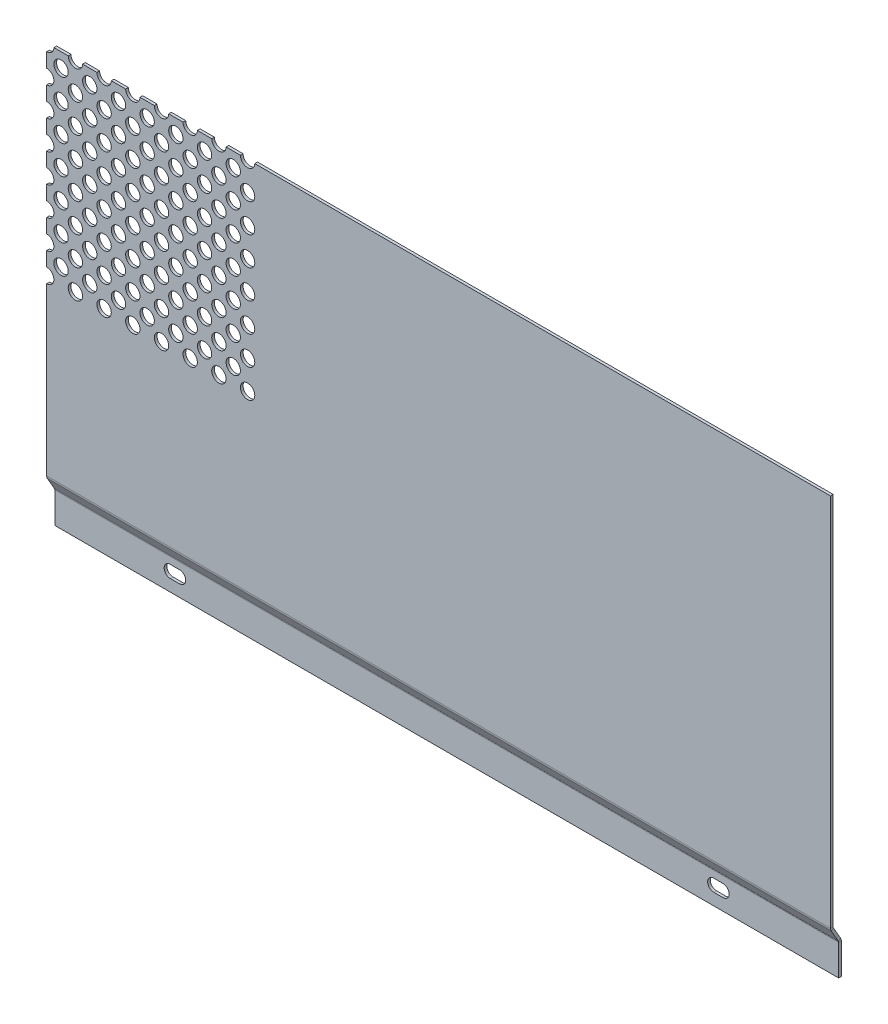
ISO-10303-21;
HEADER;
FILE_DESCRIPTION(('STEP AP214'),'2;1');
FILE_NAME('part.step','',(''),(''),'','','');
FILE_SCHEMA(('AUTOMOTIVE_DESIGN { 1 0 10303 214 1 1 1 1 }'));
ENDSEC;
DATA;
#1=APPLICATION_CONTEXT('core data for automotive mechanical design processes');
#2=APPLICATION_PROTOCOL_DEFINITION('international standard','automotive_design',2000,#1);
#3=PRODUCT_CONTEXT('',#1,'mechanical');
#4=PRODUCT('Part','Part','',(#3));
#5=PRODUCT_RELATED_PRODUCT_CATEGORY('part','',(#4));
#6=PRODUCT_DEFINITION_FORMATION('','',#4);
#7=PRODUCT_DEFINITION_CONTEXT('part definition',#1,'design');
#8=PRODUCT_DEFINITION('design','',#6,#7);
#9=PRODUCT_DEFINITION_SHAPE('','',#8);
#10=(LENGTH_UNIT() NAMED_UNIT(*) SI_UNIT(.MILLI.,.METRE.));
#11=(NAMED_UNIT(*) PLANE_ANGLE_UNIT() SI_UNIT($,.RADIAN.));
#12=(NAMED_UNIT(*) SI_UNIT($,.STERADIAN.) SOLID_ANGLE_UNIT());
#13=UNCERTAINTY_MEASURE_WITH_UNIT(LENGTH_MEASURE(1.E-05),#10,'distance_accuracy_value','');
#14=(GEOMETRIC_REPRESENTATION_CONTEXT(3) GLOBAL_UNCERTAINTY_ASSIGNED_CONTEXT((#13)) GLOBAL_UNIT_ASSIGNED_CONTEXT((#10,
#11,#12)) REPRESENTATION_CONTEXT('',''));
#15=CARTESIAN_POINT('',(0.,0.,0.));
#16=DIRECTION('',(0.,0.,1.));
#17=DIRECTION('',(1.,0.,0.));
#18=AXIS2_PLACEMENT_3D('',#15,#16,#17);
#19=CARTESIAN_POINT('',(437.,235.,6.));
#20=DIRECTION('',(0.,1.,0.));
#21=DIRECTION('',(0.,0.,1.));
#22=AXIS2_PLACEMENT_3D('',#19,#20,#21);
#23=PLANE('',#22);
#24=DIRECTION('',(0.,0.,1.));
#25=VECTOR('',#24,1.);
#26=CARTESIAN_POINT('',(108.,235.,6.));
#27=LINE('',#26,#25);
#28=CARTESIAN_POINT('',(108.,235.,4.5));
#29=VERTEX_POINT('',#28);
#30=CARTESIAN_POINT('',(108.,235.,6.));
#31=VERTEX_POINT('',#30);
#32=EDGE_CURVE('E59',#29,#31,#27,.T.);
#33=ORIENTED_EDGE('',*,*,#32,.F.);
#34=DIRECTION('',(-1.,0.,0.));
#35=VECTOR('',#34,1.);
#36=CARTESIAN_POINT('',(437.,235.,4.5));
#37=LINE('',#36,#35);
#38=CARTESIAN_POINT('',(100.,235.,4.5));
#39=VERTEX_POINT('',#38);
#40=EDGE_CURVE('E1812',#29,#39,#37,.T.);
#41=ORIENTED_EDGE('',*,*,#40,.T.);
#42=DIRECTION('',(0.,0.,1.));
#43=VECTOR('',#42,1.);
#44=CARTESIAN_POINT('',(100.,235.,6.));
#45=LINE('',#44,#43);
#46=CARTESIAN_POINT('',(100.,235.,6.));
#47=VERTEX_POINT('',#46);
#48=EDGE_CURVE('E1373',#47,#39,#45,.F.);
#49=ORIENTED_EDGE('',*,*,#48,.F.);
#50=DIRECTION('',(-1.,0.,0.));
#51=VECTOR('',#50,1.);
#52=CARTESIAN_POINT('',(437.,235.,6.));
#53=LINE('',#52,#51);
#54=EDGE_CURVE('E380',#31,#47,#53,.T.);
#55=ORIENTED_EDGE('',*,*,#54,.F.);
#56=EDGE_LOOP('',(#33,#41,#49,#55));
#57=FACE_BOUND('',#56,.T.);
#58=ADVANCED_FACE('F42',(#57),#23,.T.);
#59=DIRECTION('',(0.,0.,1.));
#60=VECTOR('',#59,1.);
#61=CARTESIAN_POINT('',(92.,235.,6.));
#62=LINE('',#61,#60);
#63=CARTESIAN_POINT('',(92.,235.,4.5));
#64=VERTEX_POINT('',#63);
#65=CARTESIAN_POINT('',(92.,235.,6.));
#66=VERTEX_POINT('',#65);
#67=EDGE_CURVE('E67',#64,#66,#62,.T.);
#68=ORIENTED_EDGE('',*,*,#67,.F.);
#69=CARTESIAN_POINT('',(84.,235.,4.5));
#70=VERTEX_POINT('',#69);
#71=EDGE_CURVE('E1817',#64,#70,#37,.T.);
#72=ORIENTED_EDGE('',*,*,#71,.T.);
#73=DIRECTION('',(0.,0.,1.));
#74=VECTOR('',#73,1.);
#75=CARTESIAN_POINT('',(84.,235.,6.));
#76=LINE('',#75,#74);
#77=CARTESIAN_POINT('',(84.,235.,6.));
#78=VERTEX_POINT('',#77);
#79=EDGE_CURVE('E1248',#78,#70,#76,.F.);
#80=ORIENTED_EDGE('',*,*,#79,.F.);
#81=EDGE_CURVE('E390',#66,#78,#53,.T.);
#82=ORIENTED_EDGE('',*,*,#81,.F.);
#83=EDGE_LOOP('',(#68,#72,#80,#82));
#84=FACE_BOUND('',#83,.T.);
#85=ADVANCED_FACE('F1984',(#84),#23,.T.);
#86=DIRECTION('',(0.,0.,1.));
#87=VECTOR('',#86,1.);
#88=CARTESIAN_POINT('',(76.,235.,6.));
#89=LINE('',#88,#87);
#90=CARTESIAN_POINT('',(76.,235.,4.5));
#91=VERTEX_POINT('',#90);
#92=CARTESIAN_POINT('',(76.,235.,6.));
#93=VERTEX_POINT('',#92);
#94=EDGE_CURVE('E1241',#91,#93,#89,.T.);
#95=ORIENTED_EDGE('',*,*,#94,.F.);
#96=CARTESIAN_POINT('',(68.,235.,4.5));
#97=VERTEX_POINT('',#96);
#98=EDGE_CURVE('E1822',#91,#97,#37,.T.);
#99=ORIENTED_EDGE('',*,*,#98,.T.);
#100=DIRECTION('',(0.,0.,1.));
#101=VECTOR('',#100,1.);
#102=CARTESIAN_POINT('',(68.,235.,6.));
#103=LINE('',#102,#101);
#104=CARTESIAN_POINT('',(68.,235.,6.));
#105=VERTEX_POINT('',#104);
#106=EDGE_CURVE('E1121',#105,#97,#103,.F.);
#107=ORIENTED_EDGE('',*,*,#106,.F.);
#108=EDGE_CURVE('E1975',#93,#105,#53,.T.);
#109=ORIENTED_EDGE('',*,*,#108,.F.);
#110=EDGE_LOOP('',(#95,#99,#107,#109));
#111=FACE_BOUND('',#110,.T.);
#112=ADVANCED_FACE('F1961',(#111),#23,.T.);
#113=DIRECTION('',(0.,0.,1.));
#114=VECTOR('',#113,1.);
#115=CARTESIAN_POINT('',(60.,235.,6.));
#116=LINE('',#115,#114);
#117=CARTESIAN_POINT('',(60.,235.,4.5));
#118=VERTEX_POINT('',#117);
#119=CARTESIAN_POINT('',(60.,235.,6.));
#120=VERTEX_POINT('',#119);
#121=EDGE_CURVE('E1114',#118,#120,#116,.T.);
#122=ORIENTED_EDGE('',*,*,#121,.F.);
#123=CARTESIAN_POINT('',(52.,235.,4.5));
#124=VERTEX_POINT('',#123);
#125=EDGE_CURVE('E1946',#118,#124,#37,.T.);
#126=ORIENTED_EDGE('',*,*,#125,.T.);
#127=DIRECTION('',(0.,0.,1.));
#128=VECTOR('',#127,1.);
#129=CARTESIAN_POINT('',(52.,235.,6.));
#130=LINE('',#129,#128);
#131=CARTESIAN_POINT('',(52.,235.,6.));
#132=VERTEX_POINT('',#131);
#133=EDGE_CURVE('E994',#132,#124,#130,.F.);
#134=ORIENTED_EDGE('',*,*,#133,.F.);
#135=EDGE_CURVE('E1973',#120,#132,#53,.T.);
#136=ORIENTED_EDGE('',*,*,#135,.F.);
#137=EDGE_LOOP('',(#122,#126,#134,#136));
#138=FACE_BOUND('',#137,.T.);
#139=ADVANCED_FACE('F1991',(#138),#23,.T.);
#140=DIRECTION('',(0.,0.,1.));
#141=VECTOR('',#140,1.);
#142=CARTESIAN_POINT('',(44.,235.,6.));
#143=LINE('',#142,#141);
#144=CARTESIAN_POINT('',(44.,235.,4.5));
#145=VERTEX_POINT('',#144);
#146=CARTESIAN_POINT('',(44.,235.,6.));
#147=VERTEX_POINT('',#146);
#148=EDGE_CURVE('E987',#145,#147,#143,.T.);
#149=ORIENTED_EDGE('',*,*,#148,.F.);
#150=CARTESIAN_POINT('',(36.,235.,4.5));
#151=VERTEX_POINT('',#150);
#152=EDGE_CURVE('E1944',#145,#151,#37,.T.);
#153=ORIENTED_EDGE('',*,*,#152,.T.);
#154=DIRECTION('',(0.,0.,1.));
#155=VECTOR('',#154,1.);
#156=CARTESIAN_POINT('',(36.,235.,6.));
#157=LINE('',#156,#155);
#158=CARTESIAN_POINT('',(36.,235.,6.));
#159=VERTEX_POINT('',#158);
#160=EDGE_CURVE('E867',#159,#151,#157,.F.);
#161=ORIENTED_EDGE('',*,*,#160,.F.);
#162=EDGE_CURVE('E402',#147,#159,#53,.T.);
#163=ORIENTED_EDGE('',*,*,#162,.F.);
#164=EDGE_LOOP('',(#149,#153,#161,#163));
#165=FACE_BOUND('',#164,.T.);
#166=ADVANCED_FACE('F1970',(#165),#23,.T.);
#167=DIRECTION('',(0.,0.,1.));
#168=VECTOR('',#167,1.);
#169=CARTESIAN_POINT('',(28.,235.,6.));
#170=LINE('',#169,#168);
#171=CARTESIAN_POINT('',(28.,235.,4.5));
#172=VERTEX_POINT('',#171);
#173=CARTESIAN_POINT('',(28.,235.,6.));
#174=VERTEX_POINT('',#173);
#175=EDGE_CURVE('E861',#172,#174,#170,.T.);
#176=ORIENTED_EDGE('',*,*,#175,.F.);
#177=CARTESIAN_POINT('',(20.,235.,4.5));
#178=VERTEX_POINT('',#177);
#179=EDGE_CURVE('E387',#172,#178,#37,.T.);
#180=ORIENTED_EDGE('',*,*,#179,.T.);
#181=DIRECTION('',(0.,0.,1.));
#182=VECTOR('',#181,1.);
#183=CARTESIAN_POINT('',(20.,235.,6.));
#184=LINE('',#183,#182);
#185=CARTESIAN_POINT('',(20.,235.,6.));
#186=VERTEX_POINT('',#185);
#187=EDGE_CURVE('E639',#186,#178,#184,.F.);
#188=ORIENTED_EDGE('',*,*,#187,.F.);
#189=EDGE_CURVE('E394',#174,#186,#53,.T.);
#190=ORIENTED_EDGE('',*,*,#189,.F.);
#191=EDGE_LOOP('',(#176,#180,#188,#190));
#192=FACE_BOUND('',#191,.T.);
#193=ADVANCED_FACE('F1943',(#192),#23,.T.);
#194=CARTESIAN_POINT('',(0.,24.6961524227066,5.59807621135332));
#195=DIRECTION('',(-1.,0.,0.));
#196=DIRECTION('',(0.,0.,1.));
#197=AXIS2_PLACEMENT_3D('',#194,#195,#196);
#198=PLANE('',#197);
#199=DIRECTION('',(0.,0.,1.));
#200=VECTOR('',#199,1.);
#201=CARTESIAN_POINT('',(0.,119.,6.));
#202=LINE('',#201,#200);
#203=CARTESIAN_POINT('',(0.,119.,4.5));
#204=VERTEX_POINT('',#203);
#205=CARTESIAN_POINT('',(0.,119.,6.));
#206=VERTEX_POINT('',#205);
#207=EDGE_CURVE('E832',#204,#206,#202,.T.);
#208=ORIENTED_EDGE('',*,*,#207,.F.);
#209=DIRECTION('',(0.,1.,0.));
#210=VECTOR('',#209,1.);
#211=CARTESIAN_POINT('',(0.,25.7942286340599,4.5));
#212=LINE('',#211,#210);
#213=CARTESIAN_POINT('',(0.,26.1961524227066,4.5));
#214=VERTEX_POINT('',#213);
#215=EDGE_CURVE('E531',#214,#204,#212,.T.);
#216=ORIENTED_EDGE('',*,*,#215,.F.);
#217=DIRECTION('',(0.,0.,1.));
#218=VECTOR('',#217,1.);
#219=CARTESIAN_POINT('',(0.,26.1961524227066,4.5));
#220=LINE('',#219,#218);
#221=CARTESIAN_POINT('',(0.,26.1961524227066,6.));
#222=VERTEX_POINT('',#221);
#223=EDGE_CURVE('E1826',#214,#222,#220,.T.);
#224=ORIENTED_EDGE('',*,*,#223,.T.);
#225=DIRECTION('',(0.,1.,0.));
#226=VECTOR('',#225,1.);
#227=CARTESIAN_POINT('',(0.,25.7942286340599,6.));
#228=LINE('',#227,#226);
#229=EDGE_CURVE('E525',#222,#206,#228,.T.);
#230=ORIENTED_EDGE('',*,*,#229,.T.);
#231=EDGE_LOOP('',(#208,#216,#224,#230));
#232=FACE_BOUND('',#231,.T.);
#233=ADVANCED_FACE('F1998',(#232),#198,.T.);
#234=DIRECTION('',(0.,0.,1.));
#235=VECTOR('',#234,1.);
#236=CARTESIAN_POINT('',(0.,127.,6.));
#237=LINE('',#236,#235);
#238=CARTESIAN_POINT('',(0.,127.,6.));
#239=VERTEX_POINT('',#238);
#240=CARTESIAN_POINT('',(0.,127.,4.5));
#241=VERTEX_POINT('',#240);
#242=EDGE_CURVE('E835',#239,#241,#237,.F.);
#243=ORIENTED_EDGE('',*,*,#242,.F.);
#244=CARTESIAN_POINT('',(0.,135.,6.));
#245=VERTEX_POINT('',#244);
#246=EDGE_CURVE('E529',#239,#245,#228,.T.);
#247=ORIENTED_EDGE('',*,*,#246,.T.);
#248=DIRECTION('',(0.,0.,1.));
#249=VECTOR('',#248,1.);
#250=CARTESIAN_POINT('',(0.,135.,6.));
#251=LINE('',#250,#249);
#252=CARTESIAN_POINT('',(0.,135.,4.5));
#253=VERTEX_POINT('',#252);
#254=EDGE_CURVE('E802',#253,#245,#251,.T.);
#255=ORIENTED_EDGE('',*,*,#254,.F.);
#256=EDGE_CURVE('E535',#241,#253,#212,.T.);
#257=ORIENTED_EDGE('',*,*,#256,.F.);
#258=EDGE_LOOP('',(#243,#247,#255,#257));
#259=FACE_BOUND('',#258,.T.);
#260=ADVANCED_FACE('F1902',(#259),#198,.T.);
#261=DIRECTION('',(0.,0.,1.));
#262=VECTOR('',#261,1.);
#263=CARTESIAN_POINT('',(0.,143.,6.));
#264=LINE('',#263,#262);
#265=CARTESIAN_POINT('',(0.,143.,6.));
#266=VERTEX_POINT('',#265);
#267=CARTESIAN_POINT('',(0.,143.,4.5));
#268=VERTEX_POINT('',#267);
#269=EDGE_CURVE('E806',#266,#268,#264,.F.);
#270=ORIENTED_EDGE('',*,*,#269,.F.);
#271=CARTESIAN_POINT('',(0.,151.,6.));
#272=VERTEX_POINT('',#271);
#273=EDGE_CURVE('E1885',#266,#272,#228,.T.);
#274=ORIENTED_EDGE('',*,*,#273,.T.);
#275=DIRECTION('',(0.,0.,1.));
#276=VECTOR('',#275,1.);
#277=CARTESIAN_POINT('',(0.,151.,6.));
#278=LINE('',#277,#276);
#279=CARTESIAN_POINT('',(0.,151.,4.5));
#280=VERTEX_POINT('',#279);
#281=EDGE_CURVE('E772',#280,#272,#278,.T.);
#282=ORIENTED_EDGE('',*,*,#281,.F.);
#283=EDGE_CURVE('E1918',#268,#280,#212,.T.);
#284=ORIENTED_EDGE('',*,*,#283,.F.);
#285=EDGE_LOOP('',(#270,#274,#282,#284));
#286=FACE_BOUND('',#285,.T.);
#287=ADVANCED_FACE('F3031',(#286),#198,.T.);
#288=DIRECTION('',(0.,0.,1.));
#289=VECTOR('',#288,1.);
#290=CARTESIAN_POINT('',(0.,159.,6.));
#291=LINE('',#290,#289);
#292=CARTESIAN_POINT('',(0.,159.,6.));
#293=VERTEX_POINT('',#292);
#294=CARTESIAN_POINT('',(0.,159.,4.5));
#295=VERTEX_POINT('',#294);
#296=EDGE_CURVE('E776',#293,#295,#291,.F.);
#297=ORIENTED_EDGE('',*,*,#296,.F.);
#298=CARTESIAN_POINT('',(0.,167.,6.));
#299=VERTEX_POINT('',#298);
#300=EDGE_CURVE('E1879',#293,#299,#228,.T.);
#301=ORIENTED_EDGE('',*,*,#300,.T.);
#302=DIRECTION('',(0.,0.,1.));
#303=VECTOR('',#302,1.);
#304=CARTESIAN_POINT('',(0.,167.,6.));
#305=LINE('',#304,#303);
#306=CARTESIAN_POINT('',(0.,167.,4.5));
#307=VERTEX_POINT('',#306);
#308=EDGE_CURVE('E742',#307,#299,#305,.T.);
#309=ORIENTED_EDGE('',*,*,#308,.F.);
#310=EDGE_CURVE('E1916',#295,#307,#212,.T.);
#311=ORIENTED_EDGE('',*,*,#310,.F.);
#312=EDGE_LOOP('',(#297,#301,#309,#311));
#313=FACE_BOUND('',#312,.T.);
#314=ADVANCED_FACE('F1915',(#313),#198,.T.);
#315=DIRECTION('',(0.,0.,1.));
#316=VECTOR('',#315,1.);
#317=CARTESIAN_POINT('',(0.,175.,6.));
#318=LINE('',#317,#316);
#319=CARTESIAN_POINT('',(0.,175.,6.));
#320=VERTEX_POINT('',#319);
#321=CARTESIAN_POINT('',(0.,175.,4.5));
#322=VERTEX_POINT('',#321);
#323=EDGE_CURVE('E746',#320,#322,#318,.F.);
#324=ORIENTED_EDGE('',*,*,#323,.F.);
#325=CARTESIAN_POINT('',(0.,183.,6.));
#326=VERTEX_POINT('',#325);
#327=EDGE_CURVE('E1873',#320,#326,#228,.T.);
#328=ORIENTED_EDGE('',*,*,#327,.T.);
#329=DIRECTION('',(0.,0.,1.));
#330=VECTOR('',#329,1.);
#331=CARTESIAN_POINT('',(0.,183.,6.));
#332=LINE('',#331,#330);
#333=CARTESIAN_POINT('',(0.,183.,4.5));
#334=VERTEX_POINT('',#333);
#335=EDGE_CURVE('E712',#334,#326,#332,.T.);
#336=ORIENTED_EDGE('',*,*,#335,.F.);
#337=EDGE_CURVE('E1919',#322,#334,#212,.T.);
#338=ORIENTED_EDGE('',*,*,#337,.F.);
#339=EDGE_LOOP('',(#324,#328,#336,#338));
#340=FACE_BOUND('',#339,.T.);
#341=ADVANCED_FACE('F3018',(#340),#198,.T.);
#342=DIRECTION('',(0.,0.,1.));
#343=VECTOR('',#342,1.);
#344=CARTESIAN_POINT('',(0.,191.,6.));
#345=LINE('',#344,#343);
#346=CARTESIAN_POINT('',(0.,191.,6.));
#347=VERTEX_POINT('',#346);
#348=CARTESIAN_POINT('',(0.,191.,4.5));
#349=VERTEX_POINT('',#348);
#350=EDGE_CURVE('E716',#347,#349,#345,.F.);
#351=ORIENTED_EDGE('',*,*,#350,.F.);
#352=CARTESIAN_POINT('',(0.,199.,6.));
#353=VERTEX_POINT('',#352);
#354=EDGE_CURVE('E1868',#347,#353,#228,.T.);
#355=ORIENTED_EDGE('',*,*,#354,.T.);
#356=DIRECTION('',(0.,0.,1.));
#357=VECTOR('',#356,1.);
#358=CARTESIAN_POINT('',(0.,199.,6.));
#359=LINE('',#358,#357);
#360=CARTESIAN_POINT('',(0.,199.,4.5));
#361=VERTEX_POINT('',#360);
#362=EDGE_CURVE('E681',#361,#353,#359,.T.);
#363=ORIENTED_EDGE('',*,*,#362,.F.);
#364=EDGE_CURVE('E1921',#349,#361,#212,.T.);
#365=ORIENTED_EDGE('',*,*,#364,.F.);
#366=EDGE_LOOP('',(#351,#355,#363,#365));
#367=FACE_BOUND('',#366,.T.);
#368=ADVANCED_FACE('F3011',(#367),#198,.T.);
#369=DIRECTION('',(0.,0.,1.));
#370=VECTOR('',#369,1.);
#371=CARTESIAN_POINT('',(0.,207.,6.));
#372=LINE('',#371,#370);
#373=CARTESIAN_POINT('',(0.,207.,6.));
#374=VERTEX_POINT('',#373);
#375=CARTESIAN_POINT('',(0.,207.,4.5));
#376=VERTEX_POINT('',#375);
#377=EDGE_CURVE('E685',#374,#376,#372,.F.);
#378=ORIENTED_EDGE('',*,*,#377,.F.);
#379=CARTESIAN_POINT('',(0.,215.,6.));
#380=VERTEX_POINT('',#379);
#381=EDGE_CURVE('E1866',#374,#380,#228,.T.);
#382=ORIENTED_EDGE('',*,*,#381,.T.);
#383=DIRECTION('',(0.,0.,1.));
#384=VECTOR('',#383,1.);
#385=CARTESIAN_POINT('',(0.,215.,6.));
#386=LINE('',#385,#384);
#387=CARTESIAN_POINT('',(0.,215.,4.5));
#388=VERTEX_POINT('',#387);
#389=EDGE_CURVE('E654',#388,#380,#386,.T.);
#390=ORIENTED_EDGE('',*,*,#389,.F.);
#391=EDGE_CURVE('E1924',#376,#388,#212,.T.);
#392=ORIENTED_EDGE('',*,*,#391,.F.);
#393=EDGE_LOOP('',(#378,#382,#390,#392));
#394=FACE_BOUND('',#393,.T.);
#395=ADVANCED_FACE('F1999',(#394),#198,.T.);
#396=DIRECTION('',(0.,0.,1.));
#397=VECTOR('',#396,1.);
#398=CARTESIAN_POINT('',(4.,235.,6.));
#399=LINE('',#398,#397);
#400=CARTESIAN_POINT('',(3.99999999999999,235.,6.));
#401=VERTEX_POINT('',#400);
#402=CARTESIAN_POINT('',(4.,235.,4.5));
#403=VERTEX_POINT('',#402);
#404=EDGE_CURVE('E643',#401,#403,#399,.F.);
#405=ORIENTED_EDGE('',*,*,#404,.F.);
#406=CARTESIAN_POINT('',(12.,235.,6.));
#407=VERTEX_POINT('',#406);
#408=EDGE_CURVE('E382',#407,#401,#53,.T.);
#409=ORIENTED_EDGE('',*,*,#408,.F.);
#410=DIRECTION('',(0.,0.,1.));
#411=VECTOR('',#410,1.);
#412=CARTESIAN_POINT('',(12.,235.,6.));
#413=LINE('',#412,#411);
#414=CARTESIAN_POINT('',(12.,235.,4.5));
#415=VERTEX_POINT('',#414);
#416=EDGE_CURVE('E632',#415,#407,#413,.T.);
#417=ORIENTED_EDGE('',*,*,#416,.F.);
#418=EDGE_CURVE('E379',#415,#403,#37,.T.);
#419=ORIENTED_EDGE('',*,*,#418,.T.);
#420=EDGE_LOOP('',(#405,#409,#417,#419));
#421=FACE_BOUND('',#420,.T.);
#422=ADVANCED_FACE('F1934',(#421),#23,.T.);
#423=CARTESIAN_POINT('',(437.,17.1961524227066,0.));
#424=DIRECTION('',(1.,0.,0.));
#425=DIRECTION('',(0.,0.,-1.));
#426=AXIS2_PLACEMENT_3D('',#423,#424,#425);
#427=PLANE('',#426);
#428=DIRECTION('',(0.,0.,1.));
#429=VECTOR('',#428,1.);
#430=CARTESIAN_POINT('',(437.,17.1961524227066,0.));
#431=LINE('',#430,#429);
#432=CARTESIAN_POINT('',(437.,17.1961524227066,0.));
#433=VERTEX_POINT('',#432);
#434=CARTESIAN_POINT('',(437.,17.1961524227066,1.5));
#435=VERTEX_POINT('',#434);
#436=EDGE_CURVE('E1844',#433,#435,#431,.T.);
#437=ORIENTED_EDGE('',*,*,#436,.F.);
#438=CARTESIAN_POINT('',(437.,17.1961524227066,3.));
#439=DIRECTION('',(-1.,0.,0.));
#440=DIRECTION('',(0.,0.,1.));
#441=AXIS2_PLACEMENT_3D('',#438,#439,#440);
#442=CIRCLE('',#441,3.);
#443=CARTESIAN_POINT('',(437.,18.6961524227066,0.401923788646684));
#444=VERTEX_POINT('',#443);
#445=EDGE_CURVE('E454',#433,#444,#442,.F.);
#446=ORIENTED_EDGE('',*,*,#445,.T.);
#447=DIRECTION('',(0.,0.5,-0.866025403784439));
#448=VECTOR('',#447,1.);
#449=CARTESIAN_POINT('',(437.,17.9461524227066,1.70096189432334));
#450=LINE('',#449,#448);
#451=CARTESIAN_POINT('',(437.,17.9461524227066,1.70096189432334));
#452=VERTEX_POINT('',#451);
#453=EDGE_CURVE('E1841',#452,#444,#450,.T.);
#454=ORIENTED_EDGE('',*,*,#453,.F.);
#455=CARTESIAN_POINT('',(437.,17.1961524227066,3.));
#456=DIRECTION('',(1.,0.,0.));
#457=DIRECTION('',(0.,0.,-1.));
#458=AXIS2_PLACEMENT_3D('',#455,#456,#457);
#459=CIRCLE('',#458,1.5);
#460=EDGE_CURVE('E470',#435,#452,#459,.T.);
#461=ORIENTED_EDGE('',*,*,#460,.F.);
#462=EDGE_LOOP('',(#437,#446,#454,#461));
#463=FACE_BOUND('',#462,.T.);
#464=ADVANCED_FACE('F44',(#463),#427,.T.);
#465=CARTESIAN_POINT('',(437.,17.9461524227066,1.70096189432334));
#466=DIRECTION('',(1.,0.,0.));
#467=DIRECTION('',(0.,0.,-1.));
#468=AXIS2_PLACEMENT_3D('',#465,#466,#467);
#469=PLANE('',#468);
#470=DIRECTION('',(0.,1.,0.));
#471=VECTOR('',#470,1.);
#472=CARTESIAN_POINT('',(437.,0.,0.));
#473=LINE('',#472,#471);
#474=CARTESIAN_POINT('',(437.,0.,0.));
#475=VERTEX_POINT('',#474);
#476=EDGE_CURVE('E458',#475,#433,#473,.T.);
#477=ORIENTED_EDGE('',*,*,#476,.T.);
#478=ORIENTED_EDGE('',*,*,#436,.T.);
#479=DIRECTION('',(0.,1.,0.));
#480=VECTOR('',#479,1.);
#481=CARTESIAN_POINT('',(437.,0.,1.5));
#482=LINE('',#481,#480);
#483=CARTESIAN_POINT('',(437.,0.,1.5));
#484=VERTEX_POINT('',#483);
#485=EDGE_CURVE('E466',#484,#435,#482,.T.);
#486=ORIENTED_EDGE('',*,*,#485,.F.);
#487=DIRECTION('',(0.,0.,1.));
#488=VECTOR('',#487,1.);
#489=CARTESIAN_POINT('',(437.,0.,0.));
#490=LINE('',#489,#488);
#491=EDGE_CURVE('E462',#475,#484,#490,.T.);
#492=ORIENTED_EDGE('',*,*,#491,.F.);
#493=EDGE_LOOP('',(#477,#478,#486,#492));
#494=FACE_BOUND('',#493,.T.);
#495=ADVANCED_FACE('F2017',(#494),#469,.T.);
#496=CARTESIAN_POINT('',(0.,18.6961524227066,0.401923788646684));
#497=DIRECTION('',(-1.,0.,0.));
#498=DIRECTION('',(0.,0.,1.));
#499=AXIS2_PLACEMENT_3D('',#496,#497,#498);
#500=PLANE('',#499);
#501=DIRECTION('',(0.,-0.5,0.866025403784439));
#502=VECTOR('',#501,1.);
#503=CARTESIAN_POINT('',(0.,18.6961524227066,0.401923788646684));
#504=LINE('',#503,#502);
#505=CARTESIAN_POINT('',(0.,18.6961524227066,0.401923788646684));
#506=VERTEX_POINT('',#505);
#507=CARTESIAN_POINT('',(0.,17.9461524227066,1.70096189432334));
#508=VERTEX_POINT('',#507);
#509=EDGE_CURVE('E1838',#506,#508,#504,.T.);
#510=ORIENTED_EDGE('',*,*,#509,.F.);
#511=CARTESIAN_POINT('',(0.,17.1961524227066,3.));
#512=DIRECTION('',(-1.,0.,0.));
#513=DIRECTION('',(0.,0.,1.));
#514=AXIS2_PLACEMENT_3D('',#511,#512,#513);
#515=CIRCLE('',#514,3.);
#516=CARTESIAN_POINT('',(0.,17.1961524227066,0.));
#517=VERTEX_POINT('',#516);
#518=EDGE_CURVE('E497',#517,#506,#515,.F.);
#519=ORIENTED_EDGE('',*,*,#518,.F.);
#520=DIRECTION('',(0.,0.,-1.));
#521=VECTOR('',#520,1.);
#522=CARTESIAN_POINT('',(0.,17.1961524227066,1.5));
#523=LINE('',#522,#521);
#524=CARTESIAN_POINT('',(0.,17.1961524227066,1.5));
#525=VERTEX_POINT('',#524);
#526=EDGE_CURVE('E1835',#525,#517,#523,.T.);
#527=ORIENTED_EDGE('',*,*,#526,.F.);
#528=CARTESIAN_POINT('',(0.,17.1961524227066,3.));
#529=DIRECTION('',(1.,0.,0.));
#530=DIRECTION('',(0.,0.,-1.));
#531=AXIS2_PLACEMENT_3D('',#528,#529,#530);
#532=CIRCLE('',#531,1.5);
#533=EDGE_CURVE('E513',#525,#508,#532,.T.);
#534=ORIENTED_EDGE('',*,*,#533,.T.);
#535=EDGE_LOOP('',(#510,#519,#527,#534));
#536=FACE_BOUND('',#535,.T.);
#537=ADVANCED_FACE('F2014',(#536),#500,.T.);
#538=CARTESIAN_POINT('',(0.,17.1961524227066,1.5));
#539=DIRECTION('',(-1.,0.,0.));
#540=DIRECTION('',(0.,0.,1.));
#541=AXIS2_PLACEMENT_3D('',#538,#539,#540);
#542=PLANE('',#541);
#543=DIRECTION('',(0.,0.866025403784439,0.5));
#544=VECTOR('',#543,1.);
#545=CARTESIAN_POINT('',(0.,18.,0.));
#546=LINE('',#545,#544);
#547=CARTESIAN_POINT('',(0.,25.4461524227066,4.29903810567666));
#548=VERTEX_POINT('',#547);
#549=EDGE_CURVE('E493',#506,#548,#546,.T.);
#550=ORIENTED_EDGE('',*,*,#549,.F.);
#551=ORIENTED_EDGE('',*,*,#509,.T.);
#552=DIRECTION('',(0.,0.866025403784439,0.5));
#553=VECTOR('',#552,1.);
#554=CARTESIAN_POINT('',(0.,17.25,1.29903810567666));
#555=LINE('',#554,#553);
#556=CARTESIAN_POINT('',(0.,24.6961524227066,5.59807621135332));
#557=VERTEX_POINT('',#556);
#558=EDGE_CURVE('E517',#508,#557,#555,.T.);
#559=ORIENTED_EDGE('',*,*,#558,.T.);
#560=DIRECTION('',(0.,0.5,-0.866025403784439));
#561=VECTOR('',#560,1.);
#562=CARTESIAN_POINT('',(0.,24.6961524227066,5.59807621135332));
#563=LINE('',#562,#561);
#564=EDGE_CURVE('E1820',#557,#548,#563,.T.);
#565=ORIENTED_EDGE('',*,*,#564,.T.);
#566=EDGE_LOOP('',(#550,#551,#559,#565));
#567=FACE_BOUND('',#566,.T.);
#568=ADVANCED_FACE('F2010',(#567),#542,.T.);
#569=CARTESIAN_POINT('',(437.,25.4461524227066,4.29903810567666));
#570=DIRECTION('',(1.,0.,0.));
#571=DIRECTION('',(0.,0.,-1.));
#572=AXIS2_PLACEMENT_3D('',#569,#570,#571);
#573=PLANE('',#572);
#574=DIRECTION('',(0.,-0.5,0.866025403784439));
#575=VECTOR('',#574,1.);
#576=CARTESIAN_POINT('',(437.,25.4461524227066,4.29903810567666));
#577=LINE('',#576,#575);
#578=CARTESIAN_POINT('',(437.,25.4461524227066,4.29903810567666));
#579=VERTEX_POINT('',#578);
#580=CARTESIAN_POINT('',(437.,24.6961524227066,5.59807621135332));
#581=VERTEX_POINT('',#580);
#582=EDGE_CURVE('E1832',#579,#581,#577,.T.);
#583=ORIENTED_EDGE('',*,*,#582,.F.);
#584=CARTESIAN_POINT('',(437.,26.1961524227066,3.));
#585=DIRECTION('',(1.,0.,0.));
#586=DIRECTION('',(0.,0.,-1.));
#587=AXIS2_PLACEMENT_3D('',#584,#585,#586);
#588=CIRCLE('',#587,1.5);
#589=CARTESIAN_POINT('',(437.,26.1961524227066,4.5));
#590=VERTEX_POINT('',#589);
#591=EDGE_CURVE('E446',#579,#590,#588,.F.);
#592=ORIENTED_EDGE('',*,*,#591,.T.);
#593=DIRECTION('',(0.,0.,-1.));
#594=VECTOR('',#593,1.);
#595=CARTESIAN_POINT('',(437.,26.1961524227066,6.));
#596=LINE('',#595,#594);
#597=CARTESIAN_POINT('',(437.,26.1961524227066,6.));
#598=VERTEX_POINT('',#597);
#599=EDGE_CURVE('E1829',#598,#590,#596,.T.);
#600=ORIENTED_EDGE('',*,*,#599,.F.);
#601=CARTESIAN_POINT('',(437.,26.1961524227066,3.));
#602=DIRECTION('',(1.,0.,0.));
#603=DIRECTION('',(0.,0.,-1.));
#604=AXIS2_PLACEMENT_3D('',#601,#602,#603);
#605=CIRCLE('',#604,3.);
#606=EDGE_CURVE('E478',#581,#598,#605,.F.);
#607=ORIENTED_EDGE('',*,*,#606,.F.);
#608=EDGE_LOOP('',(#583,#592,#600,#607));
#609=FACE_BOUND('',#608,.T.);
#610=ADVANCED_FACE('F2006',(#609),#573,.T.);
#611=CARTESIAN_POINT('',(437.,26.1961524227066,6.));
#612=DIRECTION('',(1.,0.,0.));
#613=DIRECTION('',(0.,0.,-1.));
#614=AXIS2_PLACEMENT_3D('',#611,#612,#613);
#615=PLANE('',#614);
#616=DIRECTION('',(0.,0.866025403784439,0.5));
#617=VECTOR('',#616,1.);
#618=CARTESIAN_POINT('',(437.,18.,0.));
#619=LINE('',#618,#617);
#620=EDGE_CURVE('E450',#444,#579,#619,.T.);
#621=ORIENTED_EDGE('',*,*,#620,.T.);
#622=ORIENTED_EDGE('',*,*,#582,.T.);
#623=DIRECTION('',(0.,0.866025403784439,0.5));
#624=VECTOR('',#623,1.);
#625=CARTESIAN_POINT('',(437.,17.25,1.29903810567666));
#626=LINE('',#625,#624);
#627=EDGE_CURVE('E474',#452,#581,#626,.T.);
#628=ORIENTED_EDGE('',*,*,#627,.F.);
#629=ORIENTED_EDGE('',*,*,#453,.T.);
#630=EDGE_LOOP('',(#621,#622,#628,#629));
#631=FACE_BOUND('',#630,.T.);
#632=ADVANCED_FACE('F2002',(#631),#615,.T.);
#633=CARTESIAN_POINT('',(0.,26.1961524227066,4.5));
#634=DIRECTION('',(-1.,0.,0.));
#635=DIRECTION('',(0.,0.,1.));
#636=AXIS2_PLACEMENT_3D('',#633,#634,#635);
#637=PLANE('',#636);
#638=ORIENTED_EDGE('',*,*,#223,.F.);
#639=CARTESIAN_POINT('',(0.,26.1961524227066,3.));
#640=DIRECTION('',(1.,0.,0.));
#641=DIRECTION('',(0.,0.,-1.));
#642=AXIS2_PLACEMENT_3D('',#639,#640,#641);
#643=CIRCLE('',#642,1.5);
#644=EDGE_CURVE('E489',#548,#214,#643,.F.);
#645=ORIENTED_EDGE('',*,*,#644,.F.);
#646=ORIENTED_EDGE('',*,*,#564,.F.);
#647=CARTESIAN_POINT('',(0.,26.1961524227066,3.));
#648=DIRECTION('',(1.,0.,0.));
#649=DIRECTION('',(0.,0.,-1.));
#650=AXIS2_PLACEMENT_3D('',#647,#648,#649);
#651=CIRCLE('',#650,3.);
#652=EDGE_CURVE('E521',#557,#222,#651,.F.);
#653=ORIENTED_EDGE('',*,*,#652,.T.);
#654=EDGE_LOOP('',(#638,#645,#646,#653));
#655=FACE_BOUND('',#654,.T.);
#656=ADVANCED_FACE('F1997',(#655),#637,.T.);
#657=DIRECTION('',(0.,0.,1.));
#658=VECTOR('',#657,1.);
#659=CARTESIAN_POINT('',(0.,223.,6.));
#660=LINE('',#659,#658);
#661=CARTESIAN_POINT('',(0.,223.,6.));
#662=VERTEX_POINT('',#661);
#663=CARTESIAN_POINT('',(0.,223.,4.5));
#664=VERTEX_POINT('',#663);
#665=EDGE_CURVE('E658',#662,#664,#660,.F.);
#666=ORIENTED_EDGE('',*,*,#665,.F.);
#667=CARTESIAN_POINT('',(0.,231.,6.));
#668=VERTEX_POINT('',#667);
#669=EDGE_CURVE('E530',#662,#668,#228,.T.);
#670=ORIENTED_EDGE('',*,*,#669,.T.);
#671=DIRECTION('',(0.,0.,1.));
#672=VECTOR('',#671,1.);
#673=CARTESIAN_POINT('',(0.,231.,6.));
#674=LINE('',#673,#672);
#675=CARTESIAN_POINT('',(0.,231.,4.5));
#676=VERTEX_POINT('',#675);
#677=EDGE_CURVE('E646',#676,#668,#674,.T.);
#678=ORIENTED_EDGE('',*,*,#677,.F.);
#679=EDGE_CURVE('E536',#664,#676,#212,.T.);
#680=ORIENTED_EDGE('',*,*,#679,.F.);
#681=EDGE_LOOP('',(#666,#670,#678,#680));
#682=FACE_BOUND('',#681,.T.);
#683=ADVANCED_FACE('F1638',(#682),#198,.T.);
#684=CARTESIAN_POINT('',(437.,25.7942286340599,4.5));
#685=DIRECTION('',(0.,0.,1.));
#686=DIRECTION('',(1.,0.,0.));
#687=AXIS2_PLACEMENT_3D('',#684,#685,#686);
#688=PLANE('',#687);
#689=CARTESIAN_POINT('',(104.,131.,4.5));
#690=DIRECTION('',(0.,0.,1.));
#691=DIRECTION('',(1.,0.,0.));
#692=AXIS2_PLACEMENT_3D('',#689,#690,#691);
#693=CIRCLE('',#692,4.);
#694=CARTESIAN_POINT('',(108.,131.,4.5));
#695=VERTEX_POINT('',#694);
#696=EDGE_CURVE('E1588',#695,#695,#693,.T.);
#697=ORIENTED_EDGE('',*,*,#696,.T.);
#698=EDGE_LOOP('',(#697));
#699=FACE_BOUND('',#698,.T.);
#700=CARTESIAN_POINT('',(112.,123.,4.5));
#701=DIRECTION('',(0.,0.,1.));
#702=DIRECTION('',(1.,0.,0.));
#703=AXIS2_PLACEMENT_3D('',#700,#701,#702);
#704=CIRCLE('',#703,4.);
#705=CARTESIAN_POINT('',(116.,123.,4.5));
#706=VERTEX_POINT('',#705);
#707=EDGE_CURVE('E1580',#706,#706,#704,.T.);
#708=ORIENTED_EDGE('',*,*,#707,.T.);
#709=EDGE_LOOP('',(#708));
#710=FACE_BOUND('',#709,.T.);
#711=CARTESIAN_POINT('',(104.,147.,4.5));
#712=DIRECTION('',(0.,0.,1.));
#713=DIRECTION('',(1.,0.,0.));
#714=AXIS2_PLACEMENT_3D('',#711,#712,#713);
#715=CIRCLE('',#714,4.);
#716=CARTESIAN_POINT('',(108.,147.,4.5));
#717=VERTEX_POINT('',#716);
#718=EDGE_CURVE('E1572',#717,#717,#715,.T.);
#719=ORIENTED_EDGE('',*,*,#718,.T.);
#720=EDGE_LOOP('',(#719));
#721=FACE_BOUND('',#720,.T.);
#722=CARTESIAN_POINT('',(112.,139.,4.5));
#723=DIRECTION('',(0.,0.,1.));
#724=DIRECTION('',(1.,0.,0.));
#725=AXIS2_PLACEMENT_3D('',#722,#723,#724);
#726=CIRCLE('',#725,4.);
#727=CARTESIAN_POINT('',(116.,139.,4.5));
#728=VERTEX_POINT('',#727);
#729=EDGE_CURVE('E1564',#728,#728,#726,.T.);
#730=ORIENTED_EDGE('',*,*,#729,.T.);
#731=EDGE_LOOP('',(#730));
#732=FACE_BOUND('',#731,.T.);
#733=CARTESIAN_POINT('',(104.,163.,4.5));
#734=DIRECTION('',(0.,0.,1.));
#735=DIRECTION('',(1.,0.,0.));
#736=AXIS2_PLACEMENT_3D('',#733,#734,#735);
#737=CIRCLE('',#736,4.);
#738=CARTESIAN_POINT('',(108.,163.,4.5));
#739=VERTEX_POINT('',#738);
#740=EDGE_CURVE('E1556',#739,#739,#737,.T.);
#741=ORIENTED_EDGE('',*,*,#740,.T.);
#742=EDGE_LOOP('',(#741));
#743=FACE_BOUND('',#742,.T.);
#744=CARTESIAN_POINT('',(112.,155.,4.5));
#745=DIRECTION('',(0.,0.,1.));
#746=DIRECTION('',(1.,0.,0.));
#747=AXIS2_PLACEMENT_3D('',#744,#745,#746);
#748=CIRCLE('',#747,4.);
#749=CARTESIAN_POINT('',(116.,155.,4.5));
#750=VERTEX_POINT('',#749);
#751=EDGE_CURVE('E1548',#750,#750,#748,.T.);
#752=ORIENTED_EDGE('',*,*,#751,.T.);
#753=EDGE_LOOP('',(#752));
#754=FACE_BOUND('',#753,.T.);
#755=CARTESIAN_POINT('',(104.,179.,4.5));
#756=DIRECTION('',(0.,0.,1.));
#757=DIRECTION('',(1.,0.,0.));
#758=AXIS2_PLACEMENT_3D('',#755,#756,#757);
#759=CIRCLE('',#758,4.);
#760=CARTESIAN_POINT('',(108.,179.,4.5));
#761=VERTEX_POINT('',#760);
#762=EDGE_CURVE('E1540',#761,#761,#759,.T.);
#763=ORIENTED_EDGE('',*,*,#762,.T.);
#764=EDGE_LOOP('',(#763));
#765=FACE_BOUND('',#764,.T.);
#766=CARTESIAN_POINT('',(112.,171.,4.5));
#767=DIRECTION('',(0.,0.,1.));
#768=DIRECTION('',(1.,0.,0.));
#769=AXIS2_PLACEMENT_3D('',#766,#767,#768);
#770=CIRCLE('',#769,4.);
#771=CARTESIAN_POINT('',(116.,171.,4.5));
#772=VERTEX_POINT('',#771);
#773=EDGE_CURVE('E1532',#772,#772,#770,.T.);
#774=ORIENTED_EDGE('',*,*,#773,.T.);
#775=EDGE_LOOP('',(#774));
#776=FACE_BOUND('',#775,.T.);
#777=CARTESIAN_POINT('',(104.,195.,4.5));
#778=DIRECTION('',(0.,0.,1.));
#779=DIRECTION('',(1.,0.,0.));
#780=AXIS2_PLACEMENT_3D('',#777,#778,#779);
#781=CIRCLE('',#780,4.);
#782=CARTESIAN_POINT('',(108.,195.,4.5));
#783=VERTEX_POINT('',#782);
#784=EDGE_CURVE('E1524',#783,#783,#781,.T.);
#785=ORIENTED_EDGE('',*,*,#784,.T.);
#786=EDGE_LOOP('',(#785));
#787=FACE_BOUND('',#786,.T.);
#788=CARTESIAN_POINT('',(112.,187.,4.5));
#789=DIRECTION('',(0.,0.,1.));
#790=DIRECTION('',(1.,0.,0.));
#791=AXIS2_PLACEMENT_3D('',#788,#789,#790);
#792=CIRCLE('',#791,4.);
#793=CARTESIAN_POINT('',(116.,187.,4.5));
#794=VERTEX_POINT('',#793);
#795=EDGE_CURVE('E1516',#794,#794,#792,.T.);
#796=ORIENTED_EDGE('',*,*,#795,.T.);
#797=EDGE_LOOP('',(#796));
#798=FACE_BOUND('',#797,.T.);
#799=CARTESIAN_POINT('',(104.,211.,4.5));
#800=DIRECTION('',(0.,0.,1.));
#801=DIRECTION('',(1.,0.,0.));
#802=AXIS2_PLACEMENT_3D('',#799,#800,#801);
#803=CIRCLE('',#802,4.);
#804=CARTESIAN_POINT('',(108.,211.,4.5));
#805=VERTEX_POINT('',#804);
#806=EDGE_CURVE('E1508',#805,#805,#803,.T.);
#807=ORIENTED_EDGE('',*,*,#806,.T.);
#808=EDGE_LOOP('',(#807));
#809=FACE_BOUND('',#808,.T.);
#810=CARTESIAN_POINT('',(112.,203.,4.5));
#811=DIRECTION('',(0.,0.,1.));
#812=DIRECTION('',(1.,0.,0.));
#813=AXIS2_PLACEMENT_3D('',#810,#811,#812);
#814=CIRCLE('',#813,4.);
#815=CARTESIAN_POINT('',(116.,203.,4.5));
#816=VERTEX_POINT('',#815);
#817=EDGE_CURVE('E1501',#816,#816,#814,.T.);
#818=ORIENTED_EDGE('',*,*,#817,.T.);
#819=EDGE_LOOP('',(#818));
#820=FACE_BOUND('',#819,.T.);
#821=CARTESIAN_POINT('',(104.,227.,4.5));
#822=DIRECTION('',(0.,0.,1.));
#823=DIRECTION('',(1.,0.,0.));
#824=AXIS2_PLACEMENT_3D('',#821,#822,#823);
#825=CIRCLE('',#824,4.);
#826=CARTESIAN_POINT('',(108.,227.,4.5));
#827=VERTEX_POINT('',#826);
#828=EDGE_CURVE('E370',#827,#827,#825,.T.);
#829=ORIENTED_EDGE('',*,*,#828,.T.);
#830=EDGE_LOOP('',(#829));
#831=FACE_BOUND('',#830,.T.);
#832=CARTESIAN_POINT('',(112.,219.,4.5));
#833=DIRECTION('',(0.,0.,1.));
#834=DIRECTION('',(1.,0.,0.));
#835=AXIS2_PLACEMENT_3D('',#832,#833,#834);
#836=CIRCLE('',#835,4.);
#837=CARTESIAN_POINT('',(116.,219.,4.5));
#838=VERTEX_POINT('',#837);
#839=EDGE_CURVE('E1482',#838,#838,#836,.T.);
#840=ORIENTED_EDGE('',*,*,#839,.T.);
#841=EDGE_LOOP('',(#840));
#842=FACE_BOUND('',#841,.T.);
#843=CARTESIAN_POINT('',(88.,131.,4.5));
#844=DIRECTION('',(0.,0.,1.));
#845=DIRECTION('',(1.,0.,0.));
#846=AXIS2_PLACEMENT_3D('',#843,#844,#845);
#847=CIRCLE('',#846,4.);
#848=CARTESIAN_POINT('',(92.,131.,4.5));
#849=VERTEX_POINT('',#848);
#850=EDGE_CURVE('E1474',#849,#849,#847,.T.);
#851=ORIENTED_EDGE('',*,*,#850,.T.);
#852=EDGE_LOOP('',(#851));
#853=FACE_BOUND('',#852,.T.);
#854=CARTESIAN_POINT('',(96.,123.,4.5));
#855=DIRECTION('',(0.,0.,1.));
#856=DIRECTION('',(1.,0.,0.));
#857=AXIS2_PLACEMENT_3D('',#854,#855,#856);
#858=CIRCLE('',#857,4.);
#859=CARTESIAN_POINT('',(100.,123.,4.5));
#860=VERTEX_POINT('',#859);
#861=EDGE_CURVE('E1466',#860,#860,#858,.T.);
#862=ORIENTED_EDGE('',*,*,#861,.T.);
#863=EDGE_LOOP('',(#862));
#864=FACE_BOUND('',#863,.T.);
#865=CARTESIAN_POINT('',(88.,147.,4.5));
#866=DIRECTION('',(0.,0.,1.));
#867=DIRECTION('',(1.,0.,0.));
#868=AXIS2_PLACEMENT_3D('',#865,#866,#867);
#869=CIRCLE('',#868,4.);
#870=CARTESIAN_POINT('',(92.,147.,4.5));
#871=VERTEX_POINT('',#870);
#872=EDGE_CURVE('E1459',#871,#871,#869,.T.);
#873=ORIENTED_EDGE('',*,*,#872,.T.);
#874=EDGE_LOOP('',(#873));
#875=FACE_BOUND('',#874,.T.);
#876=CARTESIAN_POINT('',(96.,139.,4.5));
#877=DIRECTION('',(0.,0.,1.));
#878=DIRECTION('',(1.,0.,0.));
#879=AXIS2_PLACEMENT_3D('',#876,#877,#878);
#880=CIRCLE('',#879,4.);
#881=CARTESIAN_POINT('',(100.,139.,4.5));
#882=VERTEX_POINT('',#881);
#883=EDGE_CURVE('E1451',#882,#882,#880,.T.);
#884=ORIENTED_EDGE('',*,*,#883,.T.);
#885=EDGE_LOOP('',(#884));
#886=FACE_BOUND('',#885,.T.);
#887=CARTESIAN_POINT('',(88.,163.,4.5));
#888=DIRECTION('',(0.,0.,1.));
#889=DIRECTION('',(1.,0.,0.));
#890=AXIS2_PLACEMENT_3D('',#887,#888,#889);
#891=CIRCLE('',#890,4.);
#892=CARTESIAN_POINT('',(92.,163.,4.5));
#893=VERTEX_POINT('',#892);
#894=EDGE_CURVE('E1443',#893,#893,#891,.T.);
#895=ORIENTED_EDGE('',*,*,#894,.T.);
#896=EDGE_LOOP('',(#895));
#897=FACE_BOUND('',#896,.T.);
#898=CARTESIAN_POINT('',(96.,155.,4.5));
#899=DIRECTION('',(0.,0.,1.));
#900=DIRECTION('',(1.,0.,0.));
#901=AXIS2_PLACEMENT_3D('',#898,#899,#900);
#902=CIRCLE('',#901,4.);
#903=CARTESIAN_POINT('',(100.,155.,4.5));
#904=VERTEX_POINT('',#903);
#905=EDGE_CURVE('E1435',#904,#904,#902,.T.);
#906=ORIENTED_EDGE('',*,*,#905,.T.);
#907=EDGE_LOOP('',(#906));
#908=FACE_BOUND('',#907,.T.);
#909=CARTESIAN_POINT('',(88.,179.,4.5));
#910=DIRECTION('',(0.,0.,1.));
#911=DIRECTION('',(1.,0.,0.));
#912=AXIS2_PLACEMENT_3D('',#909,#910,#911);
#913=CIRCLE('',#912,4.);
#914=CARTESIAN_POINT('',(92.,179.,4.5));
#915=VERTEX_POINT('',#914);
#916=EDGE_CURVE('E1427',#915,#915,#913,.T.);
#917=ORIENTED_EDGE('',*,*,#916,.T.);
#918=EDGE_LOOP('',(#917));
#919=FACE_BOUND('',#918,.T.);
#920=CARTESIAN_POINT('',(96.,171.,4.5));
#921=DIRECTION('',(0.,0.,1.));
#922=DIRECTION('',(1.,0.,0.));
#923=AXIS2_PLACEMENT_3D('',#920,#921,#922);
#924=CIRCLE('',#923,4.);
#925=CARTESIAN_POINT('',(100.,171.,4.5));
#926=VERTEX_POINT('',#925);
#927=EDGE_CURVE('E1419',#926,#926,#924,.T.);
#928=ORIENTED_EDGE('',*,*,#927,.T.);
#929=EDGE_LOOP('',(#928));
#930=FACE_BOUND('',#929,.T.);
#931=CARTESIAN_POINT('',(88.,195.,4.5));
#932=DIRECTION('',(0.,0.,1.));
#933=DIRECTION('',(1.,0.,0.));
#934=AXIS2_PLACEMENT_3D('',#931,#932,#933);
#935=CIRCLE('',#934,4.);
#936=CARTESIAN_POINT('',(92.,195.,4.5));
#937=VERTEX_POINT('',#936);
#938=EDGE_CURVE('E1411',#937,#937,#935,.T.);
#939=ORIENTED_EDGE('',*,*,#938,.T.);
#940=EDGE_LOOP('',(#939));
#941=FACE_BOUND('',#940,.T.);
#942=CARTESIAN_POINT('',(96.,187.,4.5));
#943=DIRECTION('',(0.,0.,1.));
#944=DIRECTION('',(1.,0.,0.));
#945=AXIS2_PLACEMENT_3D('',#942,#943,#944);
#946=CIRCLE('',#945,4.);
#947=CARTESIAN_POINT('',(100.,187.,4.5));
#948=VERTEX_POINT('',#947);
#949=EDGE_CURVE('E1403',#948,#948,#946,.T.);
#950=ORIENTED_EDGE('',*,*,#949,.T.);
#951=EDGE_LOOP('',(#950));
#952=FACE_BOUND('',#951,.T.);
#953=CARTESIAN_POINT('',(88.,211.,4.5));
#954=DIRECTION('',(0.,0.,1.));
#955=DIRECTION('',(1.,0.,0.));
#956=AXIS2_PLACEMENT_3D('',#953,#954,#955);
#957=CIRCLE('',#956,4.);
#958=CARTESIAN_POINT('',(92.,211.,4.5));
#959=VERTEX_POINT('',#958);
#960=EDGE_CURVE('E1395',#959,#959,#957,.T.);
#961=ORIENTED_EDGE('',*,*,#960,.T.);
#962=EDGE_LOOP('',(#961));
#963=FACE_BOUND('',#962,.T.);
#964=CARTESIAN_POINT('',(96.,203.,4.5));
#965=DIRECTION('',(0.,0.,1.));
#966=DIRECTION('',(1.,0.,0.));
#967=AXIS2_PLACEMENT_3D('',#964,#965,#966);
#968=CIRCLE('',#967,4.);
#969=CARTESIAN_POINT('',(100.,203.,4.5));
#970=VERTEX_POINT('',#969);
#971=EDGE_CURVE('E1387',#970,#970,#968,.T.);
#972=ORIENTED_EDGE('',*,*,#971,.T.);
#973=EDGE_LOOP('',(#972));
#974=FACE_BOUND('',#973,.T.);
#975=CARTESIAN_POINT('',(88.,227.,4.5));
#976=DIRECTION('',(0.,0.,1.));
#977=DIRECTION('',(1.,0.,0.));
#978=AXIS2_PLACEMENT_3D('',#975,#976,#977);
#979=CIRCLE('',#978,4.);
#980=CARTESIAN_POINT('',(92.,227.,4.5));
#981=VERTEX_POINT('',#980);
#982=EDGE_CURVE('E1377',#981,#981,#979,.T.);
#983=ORIENTED_EDGE('',*,*,#982,.T.);
#984=EDGE_LOOP('',(#983));
#985=FACE_BOUND('',#984,.T.);
#986=CARTESIAN_POINT('',(96.,219.,4.5));
#987=DIRECTION('',(0.,0.,1.));
#988=DIRECTION('',(1.,0.,0.));
#989=AXIS2_PLACEMENT_3D('',#986,#987,#988);
#990=CIRCLE('',#989,4.);
#991=CARTESIAN_POINT('',(100.,219.,4.5));
#992=VERTEX_POINT('',#991);
#993=EDGE_CURVE('E1359',#992,#992,#990,.T.);
#994=ORIENTED_EDGE('',*,*,#993,.T.);
#995=EDGE_LOOP('',(#994));
#996=FACE_BOUND('',#995,.T.);
#997=CARTESIAN_POINT('',(72.,131.,4.5));
#998=DIRECTION('',(0.,0.,1.));
#999=DIRECTION('',(1.,0.,0.));
#1000=AXIS2_PLACEMENT_3D('',#997,#998,#999);
#1001=CIRCLE('',#1000,4.);
#1002=CARTESIAN_POINT('',(76.,131.,4.5));
#1003=VERTEX_POINT('',#1002);
#1004=EDGE_CURVE('E1351',#1003,#1003,#1001,.T.);
#1005=ORIENTED_EDGE('',*,*,#1004,.T.);
#1006=EDGE_LOOP('',(#1005));
#1007=FACE_BOUND('',#1006,.T.);
#1008=CARTESIAN_POINT('',(80.,123.,4.5));
#1009=DIRECTION('',(0.,0.,1.));
#1010=DIRECTION('',(1.,0.,0.));
#1011=AXIS2_PLACEMENT_3D('',#1008,#1009,#1010);
#1012=CIRCLE('',#1011,4.);
#1013=CARTESIAN_POINT('',(84.,123.,4.5));
#1014=VERTEX_POINT('',#1013);
#1015=EDGE_CURVE('E1343',#1014,#1014,#1012,.T.);
#1016=ORIENTED_EDGE('',*,*,#1015,.T.);
#1017=EDGE_LOOP('',(#1016));
#1018=FACE_BOUND('',#1017,.T.);
#1019=CARTESIAN_POINT('',(72.,147.,4.5));
#1020=DIRECTION('',(0.,0.,1.));
#1021=DIRECTION('',(1.,0.,0.));
#1022=AXIS2_PLACEMENT_3D('',#1019,#1020,#1021);
#1023=CIRCLE('',#1022,4.);
#1024=CARTESIAN_POINT('',(76.,147.,4.5));
#1025=VERTEX_POINT('',#1024);
#1026=EDGE_CURVE('E1335',#1025,#1025,#1023,.T.);
#1027=ORIENTED_EDGE('',*,*,#1026,.T.);
#1028=EDGE_LOOP('',(#1027));
#1029=FACE_BOUND('',#1028,.T.);
#1030=CARTESIAN_POINT('',(80.,139.,4.5));
#1031=DIRECTION('',(0.,0.,1.));
#1032=DIRECTION('',(1.,0.,0.));
#1033=AXIS2_PLACEMENT_3D('',#1030,#1031,#1032);
#1034=CIRCLE('',#1033,4.);
#1035=CARTESIAN_POINT('',(84.,139.,4.5));
#1036=VERTEX_POINT('',#1035);
#1037=EDGE_CURVE('E1327',#1036,#1036,#1034,.T.);
#1038=ORIENTED_EDGE('',*,*,#1037,.T.);
#1039=EDGE_LOOP('',(#1038));
#1040=FACE_BOUND('',#1039,.T.);
#1041=CARTESIAN_POINT('',(72.,163.,4.5));
#1042=DIRECTION('',(0.,0.,1.));
#1043=DIRECTION('',(1.,0.,0.));
#1044=AXIS2_PLACEMENT_3D('',#1041,#1042,#1043);
#1045=CIRCLE('',#1044,4.);
#1046=CARTESIAN_POINT('',(76.,163.,4.5));
#1047=VERTEX_POINT('',#1046);
#1048=EDGE_CURVE('E1319',#1047,#1047,#1045,.T.);
#1049=ORIENTED_EDGE('',*,*,#1048,.T.);
#1050=EDGE_LOOP('',(#1049));
#1051=FACE_BOUND('',#1050,.T.);
#1052=CARTESIAN_POINT('',(80.,155.,4.5));
#1053=DIRECTION('',(0.,0.,1.));
#1054=DIRECTION('',(1.,0.,0.));
#1055=AXIS2_PLACEMENT_3D('',#1052,#1053,#1054);
#1056=CIRCLE('',#1055,4.);
#1057=CARTESIAN_POINT('',(84.,155.,4.5));
#1058=VERTEX_POINT('',#1057);
#1059=EDGE_CURVE('E1311',#1058,#1058,#1056,.T.);
#1060=ORIENTED_EDGE('',*,*,#1059,.T.);
#1061=EDGE_LOOP('',(#1060));
#1062=FACE_BOUND('',#1061,.T.);
#1063=CARTESIAN_POINT('',(72.,179.,4.5));
#1064=DIRECTION('',(0.,0.,1.));
#1065=DIRECTION('',(1.,0.,0.));
#1066=AXIS2_PLACEMENT_3D('',#1063,#1064,#1065);
#1067=CIRCLE('',#1066,4.);
#1068=CARTESIAN_POINT('',(76.,179.,4.5));
#1069=VERTEX_POINT('',#1068);
#1070=EDGE_CURVE('E1303',#1069,#1069,#1067,.T.);
#1071=ORIENTED_EDGE('',*,*,#1070,.T.);
#1072=EDGE_LOOP('',(#1071));
#1073=FACE_BOUND('',#1072,.T.);
#1074=CARTESIAN_POINT('',(80.,171.,4.5));
#1075=DIRECTION('',(0.,0.,1.));
#1076=DIRECTION('',(1.,0.,0.));
#1077=AXIS2_PLACEMENT_3D('',#1074,#1075,#1076);
#1078=CIRCLE('',#1077,4.);
#1079=CARTESIAN_POINT('',(84.,171.,4.5));
#1080=VERTEX_POINT('',#1079);
#1081=EDGE_CURVE('E1295',#1080,#1080,#1078,.T.);
#1082=ORIENTED_EDGE('',*,*,#1081,.T.);
#1083=EDGE_LOOP('',(#1082));
#1084=FACE_BOUND('',#1083,.T.);
#1085=CARTESIAN_POINT('',(72.,195.,4.5));
#1086=DIRECTION('',(0.,0.,1.));
#1087=DIRECTION('',(1.,0.,0.));
#1088=AXIS2_PLACEMENT_3D('',#1085,#1086,#1087);
#1089=CIRCLE('',#1088,4.);
#1090=CARTESIAN_POINT('',(76.,195.,4.5));
#1091=VERTEX_POINT('',#1090);
#1092=EDGE_CURVE('E1287',#1091,#1091,#1089,.T.);
#1093=ORIENTED_EDGE('',*,*,#1092,.T.);
#1094=EDGE_LOOP('',(#1093));
#1095=FACE_BOUND('',#1094,.T.);
#1096=CARTESIAN_POINT('',(80.,187.,4.5));
#1097=DIRECTION('',(0.,0.,1.));
#1098=DIRECTION('',(1.,0.,0.));
#1099=AXIS2_PLACEMENT_3D('',#1096,#1097,#1098);
#1100=CIRCLE('',#1099,4.);
#1101=CARTESIAN_POINT('',(84.,187.,4.5));
#1102=VERTEX_POINT('',#1101);
#1103=EDGE_CURVE('E1279',#1102,#1102,#1100,.T.);
#1104=ORIENTED_EDGE('',*,*,#1103,.T.);
#1105=EDGE_LOOP('',(#1104));
#1106=FACE_BOUND('',#1105,.T.);
#1107=CARTESIAN_POINT('',(72.,211.,4.5));
#1108=DIRECTION('',(0.,0.,1.));
#1109=DIRECTION('',(1.,0.,0.));
#1110=AXIS2_PLACEMENT_3D('',#1107,#1108,#1109);
#1111=CIRCLE('',#1110,4.);
#1112=CARTESIAN_POINT('',(76.,211.,4.5));
#1113=VERTEX_POINT('',#1112);
#1114=EDGE_CURVE('E1271',#1113,#1113,#1111,.T.);
#1115=ORIENTED_EDGE('',*,*,#1114,.T.);
#1116=EDGE_LOOP('',(#1115));
#1117=FACE_BOUND('',#1116,.T.);
#1118=CARTESIAN_POINT('',(80.,203.,4.5));
#1119=DIRECTION('',(0.,0.,1.));
#1120=DIRECTION('',(1.,0.,0.));
#1121=AXIS2_PLACEMENT_3D('',#1118,#1119,#1120);
#1122=CIRCLE('',#1121,4.);
#1123=CARTESIAN_POINT('',(84.,203.,4.5));
#1124=VERTEX_POINT('',#1123);
#1125=EDGE_CURVE('E1263',#1124,#1124,#1122,.T.);
#1126=ORIENTED_EDGE('',*,*,#1125,.T.);
#1127=EDGE_LOOP('',(#1126));
#1128=FACE_BOUND('',#1127,.T.);
#1129=CARTESIAN_POINT('',(72.,227.,4.5));
#1130=DIRECTION('',(0.,0.,1.));
#1131=DIRECTION('',(1.,0.,0.));
#1132=AXIS2_PLACEMENT_3D('',#1129,#1130,#1131);
#1133=CIRCLE('',#1132,4.);
#1134=CARTESIAN_POINT('',(76.,227.,4.5));
#1135=VERTEX_POINT('',#1134);
#1136=EDGE_CURVE('E1252',#1135,#1135,#1133,.T.);
#1137=ORIENTED_EDGE('',*,*,#1136,.T.);
#1138=EDGE_LOOP('',(#1137));
#1139=FACE_BOUND('',#1138,.T.);
#1140=CARTESIAN_POINT('',(80.,219.,4.5));
#1141=DIRECTION('',(0.,0.,1.));
#1142=DIRECTION('',(1.,0.,0.));
#1143=AXIS2_PLACEMENT_3D('',#1140,#1141,#1142);
#1144=CIRCLE('',#1143,4.);
#1145=CARTESIAN_POINT('',(84.,219.,4.5));
#1146=VERTEX_POINT('',#1145);
#1147=EDGE_CURVE('E1233',#1146,#1146,#1144,.T.);
#1148=ORIENTED_EDGE('',*,*,#1147,.T.);
#1149=EDGE_LOOP('',(#1148));
#1150=FACE_BOUND('',#1149,.T.);
#1151=CARTESIAN_POINT('',(56.,131.,4.5));
#1152=DIRECTION('',(0.,0.,1.));
#1153=DIRECTION('',(1.,0.,0.));
#1154=AXIS2_PLACEMENT_3D('',#1151,#1152,#1153);
#1155=CIRCLE('',#1154,3.99999999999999);
#1156=CARTESIAN_POINT('',(60.,131.,4.5));
#1157=VERTEX_POINT('',#1156);
#1158=EDGE_CURVE('E1225',#1157,#1157,#1155,.T.);
#1159=ORIENTED_EDGE('',*,*,#1158,.T.);
#1160=EDGE_LOOP('',(#1159));
#1161=FACE_BOUND('',#1160,.T.);
#1162=CARTESIAN_POINT('',(64.,123.,4.5));
#1163=DIRECTION('',(0.,0.,1.));
#1164=DIRECTION('',(1.,0.,0.));
#1165=AXIS2_PLACEMENT_3D('',#1162,#1163,#1164);
#1166=CIRCLE('',#1165,4.);
#1167=CARTESIAN_POINT('',(68.,123.,4.5));
#1168=VERTEX_POINT('',#1167);
#1169=EDGE_CURVE('E1217',#1168,#1168,#1166,.T.);
#1170=ORIENTED_EDGE('',*,*,#1169,.T.);
#1171=EDGE_LOOP('',(#1170));
#1172=FACE_BOUND('',#1171,.T.);
#1173=CARTESIAN_POINT('',(56.,147.,4.5));
#1174=DIRECTION('',(0.,0.,1.));
#1175=DIRECTION('',(1.,0.,0.));
#1176=AXIS2_PLACEMENT_3D('',#1173,#1174,#1175);
#1177=CIRCLE('',#1176,3.99999999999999);
#1178=CARTESIAN_POINT('',(60.,147.,4.5));
#1179=VERTEX_POINT('',#1178);
#1180=EDGE_CURVE('E1209',#1179,#1179,#1177,.T.);
#1181=ORIENTED_EDGE('',*,*,#1180,.T.);
#1182=EDGE_LOOP('',(#1181));
#1183=FACE_BOUND('',#1182,.T.);
#1184=CARTESIAN_POINT('',(64.,139.,4.5));
#1185=DIRECTION('',(0.,0.,1.));
#1186=DIRECTION('',(1.,0.,0.));
#1187=AXIS2_PLACEMENT_3D('',#1184,#1185,#1186);
#1188=CIRCLE('',#1187,4.);
#1189=CARTESIAN_POINT('',(68.,139.,4.5));
#1190=VERTEX_POINT('',#1189);
#1191=EDGE_CURVE('E1201',#1190,#1190,#1188,.T.);
#1192=ORIENTED_EDGE('',*,*,#1191,.T.);
#1193=EDGE_LOOP('',(#1192));
#1194=FACE_BOUND('',#1193,.T.);
#1195=CARTESIAN_POINT('',(56.,163.,4.5));
#1196=DIRECTION('',(0.,0.,1.));
#1197=DIRECTION('',(1.,0.,0.));
#1198=AXIS2_PLACEMENT_3D('',#1195,#1196,#1197);
#1199=CIRCLE('',#1198,3.99999999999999);
#1200=CARTESIAN_POINT('',(60.,163.,4.5));
#1201=VERTEX_POINT('',#1200);
#1202=EDGE_CURVE('E1193',#1201,#1201,#1199,.T.);
#1203=ORIENTED_EDGE('',*,*,#1202,.T.);
#1204=EDGE_LOOP('',(#1203));
#1205=FACE_BOUND('',#1204,.T.);
#1206=CARTESIAN_POINT('',(64.,155.,4.5));
#1207=DIRECTION('',(0.,0.,1.));
#1208=DIRECTION('',(1.,0.,0.));
#1209=AXIS2_PLACEMENT_3D('',#1206,#1207,#1208);
#1210=CIRCLE('',#1209,4.);
#1211=CARTESIAN_POINT('',(68.,155.,4.5));
#1212=VERTEX_POINT('',#1211);
#1213=EDGE_CURVE('E1185',#1212,#1212,#1210,.T.);
#1214=ORIENTED_EDGE('',*,*,#1213,.T.);
#1215=EDGE_LOOP('',(#1214));
#1216=FACE_BOUND('',#1215,.T.);
#1217=CARTESIAN_POINT('',(56.,179.,4.5));
#1218=DIRECTION('',(0.,0.,1.));
#1219=DIRECTION('',(1.,0.,0.));
#1220=AXIS2_PLACEMENT_3D('',#1217,#1218,#1219);
#1221=CIRCLE('',#1220,3.99999999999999);
#1222=CARTESIAN_POINT('',(60.,179.,4.5));
#1223=VERTEX_POINT('',#1222);
#1224=EDGE_CURVE('E1177',#1223,#1223,#1221,.T.);
#1225=ORIENTED_EDGE('',*,*,#1224,.T.);
#1226=EDGE_LOOP('',(#1225));
#1227=FACE_BOUND('',#1226,.T.);
#1228=CARTESIAN_POINT('',(64.,171.,4.5));
#1229=DIRECTION('',(0.,0.,1.));
#1230=DIRECTION('',(1.,0.,0.));
#1231=AXIS2_PLACEMENT_3D('',#1228,#1229,#1230);
#1232=CIRCLE('',#1231,4.);
#1233=CARTESIAN_POINT('',(68.,171.,4.5));
#1234=VERTEX_POINT('',#1233);
#1235=EDGE_CURVE('E1169',#1234,#1234,#1232,.T.);
#1236=ORIENTED_EDGE('',*,*,#1235,.T.);
#1237=EDGE_LOOP('',(#1236));
#1238=FACE_BOUND('',#1237,.T.);
#1239=CARTESIAN_POINT('',(56.,195.,4.5));
#1240=DIRECTION('',(0.,0.,1.));
#1241=DIRECTION('',(1.,0.,0.));
#1242=AXIS2_PLACEMENT_3D('',#1239,#1240,#1241);
#1243=CIRCLE('',#1242,3.99999999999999);
#1244=CARTESIAN_POINT('',(60.,195.,4.5));
#1245=VERTEX_POINT('',#1244);
#1246=EDGE_CURVE('E1161',#1245,#1245,#1243,.T.);
#1247=ORIENTED_EDGE('',*,*,#1246,.T.);
#1248=EDGE_LOOP('',(#1247));
#1249=FACE_BOUND('',#1248,.T.);
#1250=CARTESIAN_POINT('',(64.,187.,4.5));
#1251=DIRECTION('',(0.,0.,1.));
#1252=DIRECTION('',(1.,0.,0.));
#1253=AXIS2_PLACEMENT_3D('',#1250,#1251,#1252);
#1254=CIRCLE('',#1253,4.);
#1255=CARTESIAN_POINT('',(68.,187.,4.5));
#1256=VERTEX_POINT('',#1255);
#1257=EDGE_CURVE('E1153',#1256,#1256,#1254,.T.);
#1258=ORIENTED_EDGE('',*,*,#1257,.T.);
#1259=EDGE_LOOP('',(#1258));
#1260=FACE_BOUND('',#1259,.T.);
#1261=CARTESIAN_POINT('',(56.,211.,4.5));
#1262=DIRECTION('',(0.,0.,1.));
#1263=DIRECTION('',(1.,0.,0.));
#1264=AXIS2_PLACEMENT_3D('',#1261,#1262,#1263);
#1265=CIRCLE('',#1264,3.99999999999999);
#1266=CARTESIAN_POINT('',(60.,211.,4.5));
#1267=VERTEX_POINT('',#1266);
#1268=EDGE_CURVE('E1145',#1267,#1267,#1265,.T.);
#1269=ORIENTED_EDGE('',*,*,#1268,.T.);
#1270=EDGE_LOOP('',(#1269));
#1271=FACE_BOUND('',#1270,.T.);
#1272=CARTESIAN_POINT('',(64.,203.,4.5));
#1273=DIRECTION('',(0.,0.,1.));
#1274=DIRECTION('',(1.,0.,0.));
#1275=AXIS2_PLACEMENT_3D('',#1272,#1273,#1274);
#1276=CIRCLE('',#1275,4.);
#1277=CARTESIAN_POINT('',(68.,203.,4.5));
#1278=VERTEX_POINT('',#1277);
#1279=EDGE_CURVE('E1137',#1278,#1278,#1276,.T.);
#1280=ORIENTED_EDGE('',*,*,#1279,.T.);
#1281=EDGE_LOOP('',(#1280));
#1282=FACE_BOUND('',#1281,.T.);
#1283=CARTESIAN_POINT('',(56.,227.,4.5));
#1284=DIRECTION('',(0.,0.,1.));
#1285=DIRECTION('',(1.,0.,0.));
#1286=AXIS2_PLACEMENT_3D('',#1283,#1284,#1285);
#1287=CIRCLE('',#1286,3.99999999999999);
#1288=CARTESIAN_POINT('',(60.,227.,4.5));
#1289=VERTEX_POINT('',#1288);
#1290=EDGE_CURVE('E1125',#1289,#1289,#1287,.T.);
#1291=ORIENTED_EDGE('',*,*,#1290,.T.);
#1292=EDGE_LOOP('',(#1291));
#1293=FACE_BOUND('',#1292,.T.);
#1294=CARTESIAN_POINT('',(64.,219.,4.5));
#1295=DIRECTION('',(0.,0.,1.));
#1296=DIRECTION('',(1.,0.,0.));
#1297=AXIS2_PLACEMENT_3D('',#1294,#1295,#1296);
#1298=CIRCLE('',#1297,4.);
#1299=CARTESIAN_POINT('',(68.,219.,4.5));
#1300=VERTEX_POINT('',#1299);
#1301=EDGE_CURVE('E1106',#1300,#1300,#1298,.T.);
#1302=ORIENTED_EDGE('',*,*,#1301,.T.);
#1303=EDGE_LOOP('',(#1302));
#1304=FACE_BOUND('',#1303,.T.);
#1305=CARTESIAN_POINT('',(40.,131.,4.5));
#1306=DIRECTION('',(0.,0.,1.));
#1307=DIRECTION('',(1.,0.,0.));
#1308=AXIS2_PLACEMENT_3D('',#1305,#1306,#1307);
#1309=CIRCLE('',#1308,3.99999999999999);
#1310=CARTESIAN_POINT('',(44.,131.,4.5));
#1311=VERTEX_POINT('',#1310);
#1312=EDGE_CURVE('E1098',#1311,#1311,#1309,.T.);
#1313=ORIENTED_EDGE('',*,*,#1312,.T.);
#1314=EDGE_LOOP('',(#1313));
#1315=FACE_BOUND('',#1314,.T.);
#1316=CARTESIAN_POINT('',(48.,123.,4.5));
#1317=DIRECTION('',(0.,0.,1.));
#1318=DIRECTION('',(1.,0.,0.));
#1319=AXIS2_PLACEMENT_3D('',#1316,#1317,#1318);
#1320=CIRCLE('',#1319,3.99999999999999);
#1321=CARTESIAN_POINT('',(52.,123.,4.5));
#1322=VERTEX_POINT('',#1321);
#1323=EDGE_CURVE('E1090',#1322,#1322,#1320,.T.);
#1324=ORIENTED_EDGE('',*,*,#1323,.T.);
#1325=EDGE_LOOP('',(#1324));
#1326=FACE_BOUND('',#1325,.T.);
#1327=CARTESIAN_POINT('',(40.,147.,4.5));
#1328=DIRECTION('',(0.,0.,1.));
#1329=DIRECTION('',(1.,0.,0.));
#1330=AXIS2_PLACEMENT_3D('',#1327,#1328,#1329);
#1331=CIRCLE('',#1330,3.99999999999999);
#1332=CARTESIAN_POINT('',(44.,147.,4.5));
#1333=VERTEX_POINT('',#1332);
#1334=EDGE_CURVE('E1082',#1333,#1333,#1331,.T.);
#1335=ORIENTED_EDGE('',*,*,#1334,.T.);
#1336=EDGE_LOOP('',(#1335));
#1337=FACE_BOUND('',#1336,.T.);
#1338=CARTESIAN_POINT('',(48.,139.,4.5));
#1339=DIRECTION('',(0.,0.,1.));
#1340=DIRECTION('',(1.,0.,0.));
#1341=AXIS2_PLACEMENT_3D('',#1338,#1339,#1340);
#1342=CIRCLE('',#1341,3.99999999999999);
#1343=CARTESIAN_POINT('',(52.,139.,4.5));
#1344=VERTEX_POINT('',#1343);
#1345=EDGE_CURVE('E1074',#1344,#1344,#1342,.T.);
#1346=ORIENTED_EDGE('',*,*,#1345,.T.);
#1347=EDGE_LOOP('',(#1346));
#1348=FACE_BOUND('',#1347,.T.);
#1349=CARTESIAN_POINT('',(40.,163.,4.5));
#1350=DIRECTION('',(0.,0.,1.));
#1351=DIRECTION('',(1.,0.,0.));
#1352=AXIS2_PLACEMENT_3D('',#1349,#1350,#1351);
#1353=CIRCLE('',#1352,3.99999999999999);
#1354=CARTESIAN_POINT('',(44.,163.,4.5));
#1355=VERTEX_POINT('',#1354);
#1356=EDGE_CURVE('E1066',#1355,#1355,#1353,.T.);
#1357=ORIENTED_EDGE('',*,*,#1356,.T.);
#1358=EDGE_LOOP('',(#1357));
#1359=FACE_BOUND('',#1358,.T.);
#1360=CARTESIAN_POINT('',(48.,155.,4.5));
#1361=DIRECTION('',(0.,0.,1.));
#1362=DIRECTION('',(1.,0.,0.));
#1363=AXIS2_PLACEMENT_3D('',#1360,#1361,#1362);
#1364=CIRCLE('',#1363,3.99999999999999);
#1365=CARTESIAN_POINT('',(52.,155.,4.5));
#1366=VERTEX_POINT('',#1365);
#1367=EDGE_CURVE('E1058',#1366,#1366,#1364,.T.);
#1368=ORIENTED_EDGE('',*,*,#1367,.T.);
#1369=EDGE_LOOP('',(#1368));
#1370=FACE_BOUND('',#1369,.T.);
#1371=CARTESIAN_POINT('',(40.,179.,4.5));
#1372=DIRECTION('',(0.,0.,1.));
#1373=DIRECTION('',(1.,0.,0.));
#1374=AXIS2_PLACEMENT_3D('',#1371,#1372,#1373);
#1375=CIRCLE('',#1374,3.99999999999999);
#1376=CARTESIAN_POINT('',(44.,179.,4.5));
#1377=VERTEX_POINT('',#1376);
#1378=EDGE_CURVE('E1050',#1377,#1377,#1375,.T.);
#1379=ORIENTED_EDGE('',*,*,#1378,.T.);
#1380=EDGE_LOOP('',(#1379));
#1381=FACE_BOUND('',#1380,.T.);
#1382=CARTESIAN_POINT('',(48.,171.,4.5));
#1383=DIRECTION('',(0.,0.,1.));
#1384=DIRECTION('',(1.,0.,0.));
#1385=AXIS2_PLACEMENT_3D('',#1382,#1383,#1384);
#1386=CIRCLE('',#1385,3.99999999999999);
#1387=CARTESIAN_POINT('',(52.,171.,4.5));
#1388=VERTEX_POINT('',#1387);
#1389=EDGE_CURVE('E1042',#1388,#1388,#1386,.T.);
#1390=ORIENTED_EDGE('',*,*,#1389,.T.);
#1391=EDGE_LOOP('',(#1390));
#1392=FACE_BOUND('',#1391,.T.);
#1393=CARTESIAN_POINT('',(40.,195.,4.5));
#1394=DIRECTION('',(0.,0.,1.));
#1395=DIRECTION('',(1.,0.,0.));
#1396=AXIS2_PLACEMENT_3D('',#1393,#1394,#1395);
#1397=CIRCLE('',#1396,3.99999999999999);
#1398=CARTESIAN_POINT('',(44.,195.,4.5));
#1399=VERTEX_POINT('',#1398);
#1400=EDGE_CURVE('E1034',#1399,#1399,#1397,.T.);
#1401=ORIENTED_EDGE('',*,*,#1400,.T.);
#1402=EDGE_LOOP('',(#1401));
#1403=FACE_BOUND('',#1402,.T.);
#1404=CARTESIAN_POINT('',(48.,187.,4.5));
#1405=DIRECTION('',(0.,0.,1.));
#1406=DIRECTION('',(1.,0.,0.));
#1407=AXIS2_PLACEMENT_3D('',#1404,#1405,#1406);
#1408=CIRCLE('',#1407,3.99999999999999);
#1409=CARTESIAN_POINT('',(52.,187.,4.5));
#1410=VERTEX_POINT('',#1409);
#1411=EDGE_CURVE('E1026',#1410,#1410,#1408,.T.);
#1412=ORIENTED_EDGE('',*,*,#1411,.T.);
#1413=EDGE_LOOP('',(#1412));
#1414=FACE_BOUND('',#1413,.T.);
#1415=CARTESIAN_POINT('',(40.,211.,4.5));
#1416=DIRECTION('',(0.,0.,1.));
#1417=DIRECTION('',(1.,0.,0.));
#1418=AXIS2_PLACEMENT_3D('',#1415,#1416,#1417);
#1419=CIRCLE('',#1418,3.99999999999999);
#1420=CARTESIAN_POINT('',(44.,211.,4.5));
#1421=VERTEX_POINT('',#1420);
#1422=EDGE_CURVE('E1018',#1421,#1421,#1419,.T.);
#1423=ORIENTED_EDGE('',*,*,#1422,.T.);
#1424=EDGE_LOOP('',(#1423));
#1425=FACE_BOUND('',#1424,.T.);
#1426=CARTESIAN_POINT('',(48.,203.,4.5));
#1427=DIRECTION('',(0.,0.,1.));
#1428=DIRECTION('',(1.,0.,0.));
#1429=AXIS2_PLACEMENT_3D('',#1426,#1427,#1428);
#1430=CIRCLE('',#1429,3.99999999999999);
#1431=CARTESIAN_POINT('',(52.,203.,4.5));
#1432=VERTEX_POINT('',#1431);
#1433=EDGE_CURVE('E1010',#1432,#1432,#1430,.T.);
#1434=ORIENTED_EDGE('',*,*,#1433,.T.);
#1435=EDGE_LOOP('',(#1434));
#1436=FACE_BOUND('',#1435,.T.);
#1437=CARTESIAN_POINT('',(40.,227.,4.5));
#1438=DIRECTION('',(0.,0.,1.));
#1439=DIRECTION('',(1.,0.,0.));
#1440=AXIS2_PLACEMENT_3D('',#1437,#1438,#1439);
#1441=CIRCLE('',#1440,3.99999999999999);
#1442=CARTESIAN_POINT('',(44.,227.,4.5));
#1443=VERTEX_POINT('',#1442);
#1444=EDGE_CURVE('E998',#1443,#1443,#1441,.T.);
#1445=ORIENTED_EDGE('',*,*,#1444,.T.);
#1446=EDGE_LOOP('',(#1445));
#1447=FACE_BOUND('',#1446,.T.);
#1448=CARTESIAN_POINT('',(48.,219.,4.5));
#1449=DIRECTION('',(0.,0.,1.));
#1450=DIRECTION('',(1.,0.,0.));
#1451=AXIS2_PLACEMENT_3D('',#1448,#1449,#1450);
#1452=CIRCLE('',#1451,3.99999999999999);
#1453=CARTESIAN_POINT('',(52.,219.,4.5));
#1454=VERTEX_POINT('',#1453);
#1455=EDGE_CURVE('E979',#1454,#1454,#1452,.T.);
#1456=ORIENTED_EDGE('',*,*,#1455,.T.);
#1457=EDGE_LOOP('',(#1456));
#1458=FACE_BOUND('',#1457,.T.);
#1459=CARTESIAN_POINT('',(24.,131.,4.5));
#1460=DIRECTION('',(0.,0.,1.));
#1461=DIRECTION('',(1.,0.,0.));
#1462=AXIS2_PLACEMENT_3D('',#1459,#1460,#1461);
#1463=CIRCLE('',#1462,3.99999999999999);
#1464=CARTESIAN_POINT('',(28.,131.,4.5));
#1465=VERTEX_POINT('',#1464);
#1466=EDGE_CURVE('E971',#1465,#1465,#1463,.T.);
#1467=ORIENTED_EDGE('',*,*,#1466,.T.);
#1468=EDGE_LOOP('',(#1467));
#1469=FACE_BOUND('',#1468,.T.);
#1470=CARTESIAN_POINT('',(32.,123.,4.5));
#1471=DIRECTION('',(0.,0.,1.));
#1472=DIRECTION('',(1.,0.,0.));
#1473=AXIS2_PLACEMENT_3D('',#1470,#1471,#1472);
#1474=CIRCLE('',#1473,3.99999999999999);
#1475=CARTESIAN_POINT('',(36.,123.,4.5));
#1476=VERTEX_POINT('',#1475);
#1477=EDGE_CURVE('E963',#1476,#1476,#1474,.T.);
#1478=ORIENTED_EDGE('',*,*,#1477,.T.);
#1479=EDGE_LOOP('',(#1478));
#1480=FACE_BOUND('',#1479,.T.);
#1481=CARTESIAN_POINT('',(24.,147.,4.5));
#1482=DIRECTION('',(0.,0.,1.));
#1483=DIRECTION('',(1.,0.,0.));
#1484=AXIS2_PLACEMENT_3D('',#1481,#1482,#1483);
#1485=CIRCLE('',#1484,3.99999999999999);
#1486=CARTESIAN_POINT('',(28.,147.,4.5));
#1487=VERTEX_POINT('',#1486);
#1488=EDGE_CURVE('E955',#1487,#1487,#1485,.T.);
#1489=ORIENTED_EDGE('',*,*,#1488,.T.);
#1490=EDGE_LOOP('',(#1489));
#1491=FACE_BOUND('',#1490,.T.);
#1492=CARTESIAN_POINT('',(32.,139.,4.5));
#1493=DIRECTION('',(0.,0.,1.));
#1494=DIRECTION('',(1.,0.,0.));
#1495=AXIS2_PLACEMENT_3D('',#1492,#1493,#1494);
#1496=CIRCLE('',#1495,3.99999999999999);
#1497=CARTESIAN_POINT('',(36.,139.,4.5));
#1498=VERTEX_POINT('',#1497);
#1499=EDGE_CURVE('E947',#1498,#1498,#1496,.T.);
#1500=ORIENTED_EDGE('',*,*,#1499,.T.);
#1501=EDGE_LOOP('',(#1500));
#1502=FACE_BOUND('',#1501,.T.);
#1503=CARTESIAN_POINT('',(24.,163.,4.5));
#1504=DIRECTION('',(0.,0.,1.));
#1505=DIRECTION('',(1.,0.,0.));
#1506=AXIS2_PLACEMENT_3D('',#1503,#1504,#1505);
#1507=CIRCLE('',#1506,3.99999999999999);
#1508=CARTESIAN_POINT('',(28.,163.,4.5));
#1509=VERTEX_POINT('',#1508);
#1510=EDGE_CURVE('E939',#1509,#1509,#1507,.T.);
#1511=ORIENTED_EDGE('',*,*,#1510,.T.);
#1512=EDGE_LOOP('',(#1511));
#1513=FACE_BOUND('',#1512,.T.);
#1514=CARTESIAN_POINT('',(32.,155.,4.5));
#1515=DIRECTION('',(0.,0.,1.));
#1516=DIRECTION('',(1.,0.,0.));
#1517=AXIS2_PLACEMENT_3D('',#1514,#1515,#1516);
#1518=CIRCLE('',#1517,3.99999999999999);
#1519=CARTESIAN_POINT('',(36.,155.,4.5));
#1520=VERTEX_POINT('',#1519);
#1521=EDGE_CURVE('E931',#1520,#1520,#1518,.T.);
#1522=ORIENTED_EDGE('',*,*,#1521,.T.);
#1523=EDGE_LOOP('',(#1522));
#1524=FACE_BOUND('',#1523,.T.);
#1525=CARTESIAN_POINT('',(24.,179.,4.5));
#1526=DIRECTION('',(0.,0.,1.));
#1527=DIRECTION('',(1.,0.,0.));
#1528=AXIS2_PLACEMENT_3D('',#1525,#1526,#1527);
#1529=CIRCLE('',#1528,3.99999999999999);
#1530=CARTESIAN_POINT('',(28.,179.,4.5));
#1531=VERTEX_POINT('',#1530);
#1532=EDGE_CURVE('E923',#1531,#1531,#1529,.T.);
#1533=ORIENTED_EDGE('',*,*,#1532,.T.);
#1534=EDGE_LOOP('',(#1533));
#1535=FACE_BOUND('',#1534,.T.);
#1536=CARTESIAN_POINT('',(32.,171.,4.5));
#1537=DIRECTION('',(0.,0.,1.));
#1538=DIRECTION('',(1.,0.,0.));
#1539=AXIS2_PLACEMENT_3D('',#1536,#1537,#1538);
#1540=CIRCLE('',#1539,3.99999999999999);
#1541=CARTESIAN_POINT('',(36.,171.,4.5));
#1542=VERTEX_POINT('',#1541);
#1543=EDGE_CURVE('E915',#1542,#1542,#1540,.T.);
#1544=ORIENTED_EDGE('',*,*,#1543,.T.);
#1545=EDGE_LOOP('',(#1544));
#1546=FACE_BOUND('',#1545,.T.);
#1547=CARTESIAN_POINT('',(24.,195.,4.5));
#1548=DIRECTION('',(0.,0.,1.));
#1549=DIRECTION('',(1.,0.,0.));
#1550=AXIS2_PLACEMENT_3D('',#1547,#1548,#1549);
#1551=CIRCLE('',#1550,3.99999999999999);
#1552=CARTESIAN_POINT('',(28.,195.,4.5));
#1553=VERTEX_POINT('',#1552);
#1554=EDGE_CURVE('E907',#1553,#1553,#1551,.T.);
#1555=ORIENTED_EDGE('',*,*,#1554,.T.);
#1556=EDGE_LOOP('',(#1555));
#1557=FACE_BOUND('',#1556,.T.);
#1558=CARTESIAN_POINT('',(32.,187.,4.5));
#1559=DIRECTION('',(0.,0.,1.));
#1560=DIRECTION('',(1.,0.,0.));
#1561=AXIS2_PLACEMENT_3D('',#1558,#1559,#1560);
#1562=CIRCLE('',#1561,3.99999999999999);
#1563=CARTESIAN_POINT('',(36.,187.,4.5));
#1564=VERTEX_POINT('',#1563);
#1565=EDGE_CURVE('E899',#1564,#1564,#1562,.T.);
#1566=ORIENTED_EDGE('',*,*,#1565,.T.);
#1567=EDGE_LOOP('',(#1566));
#1568=FACE_BOUND('',#1567,.T.);
#1569=CARTESIAN_POINT('',(24.,211.,4.5));
#1570=DIRECTION('',(0.,0.,1.));
#1571=DIRECTION('',(1.,0.,0.));
#1572=AXIS2_PLACEMENT_3D('',#1569,#1570,#1571);
#1573=CIRCLE('',#1572,3.99999999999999);
#1574=CARTESIAN_POINT('',(28.,211.,4.5));
#1575=VERTEX_POINT('',#1574);
#1576=EDGE_CURVE('E891',#1575,#1575,#1573,.T.);
#1577=ORIENTED_EDGE('',*,*,#1576,.T.);
#1578=EDGE_LOOP('',(#1577));
#1579=FACE_BOUND('',#1578,.T.);
#1580=CARTESIAN_POINT('',(32.,203.,4.5));
#1581=DIRECTION('',(0.,0.,1.));
#1582=DIRECTION('',(1.,0.,0.));
#1583=AXIS2_PLACEMENT_3D('',#1580,#1581,#1582);
#1584=CIRCLE('',#1583,3.99999999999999);
#1585=CARTESIAN_POINT('',(36.,203.,4.5));
#1586=VERTEX_POINT('',#1585);
#1587=EDGE_CURVE('E883',#1586,#1586,#1584,.T.);
#1588=ORIENTED_EDGE('',*,*,#1587,.T.);
#1589=EDGE_LOOP('',(#1588));
#1590=FACE_BOUND('',#1589,.T.);
#1591=CARTESIAN_POINT('',(24.,227.,4.5));
#1592=DIRECTION('',(0.,0.,1.));
#1593=DIRECTION('',(1.,0.,0.));
#1594=AXIS2_PLACEMENT_3D('',#1591,#1592,#1593);
#1595=CIRCLE('',#1594,3.99999999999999);
#1596=CARTESIAN_POINT('',(28.,227.,4.5));
#1597=VERTEX_POINT('',#1596);
#1598=EDGE_CURVE('E871',#1597,#1597,#1595,.T.);
#1599=ORIENTED_EDGE('',*,*,#1598,.T.);
#1600=EDGE_LOOP('',(#1599));
#1601=FACE_BOUND('',#1600,.T.);
#1602=CARTESIAN_POINT('',(32.,219.,4.5));
#1603=DIRECTION('',(0.,0.,1.));
#1604=DIRECTION('',(1.,0.,0.));
#1605=AXIS2_PLACEMENT_3D('',#1602,#1603,#1604);
#1606=CIRCLE('',#1605,3.99999999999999);
#1607=CARTESIAN_POINT('',(36.,219.,4.5));
#1608=VERTEX_POINT('',#1607);
#1609=EDGE_CURVE('E853',#1608,#1608,#1606,.T.);
#1610=ORIENTED_EDGE('',*,*,#1609,.T.);
#1611=EDGE_LOOP('',(#1610));
#1612=FACE_BOUND('',#1611,.T.);
#1613=CARTESIAN_POINT('',(8.00000000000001,131.,4.5));
#1614=DIRECTION('',(0.,0.,1.));
#1615=DIRECTION('',(1.,0.,0.));
#1616=AXIS2_PLACEMENT_3D('',#1613,#1614,#1615);
#1617=CIRCLE('',#1616,3.99999999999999);
#1618=CARTESIAN_POINT('',(12.,131.,4.5));
#1619=VERTEX_POINT('',#1618);
#1620=EDGE_CURVE('E842',#1619,#1619,#1617,.T.);
#1621=ORIENTED_EDGE('',*,*,#1620,.T.);
#1622=EDGE_LOOP('',(#1621));
#1623=FACE_BOUND('',#1622,.T.);
#1624=CARTESIAN_POINT('',(16.,123.,4.5));
#1625=DIRECTION('',(0.,0.,1.));
#1626=DIRECTION('',(1.,0.,0.));
#1627=AXIS2_PLACEMENT_3D('',#1624,#1625,#1626);
#1628=CIRCLE('',#1627,3.99999999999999);
#1629=CARTESIAN_POINT('',(20.,123.,4.5));
#1630=VERTEX_POINT('',#1629);
#1631=EDGE_CURVE('E824',#1630,#1630,#1628,.T.);
#1632=ORIENTED_EDGE('',*,*,#1631,.T.);
#1633=EDGE_LOOP('',(#1632));
#1634=FACE_BOUND('',#1633,.T.);
#1635=CARTESIAN_POINT('',(8.00000000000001,147.,4.5));
#1636=DIRECTION('',(0.,0.,1.));
#1637=DIRECTION('',(1.,0.,0.));
#1638=AXIS2_PLACEMENT_3D('',#1635,#1636,#1637);
#1639=CIRCLE('',#1638,3.99999999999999);
#1640=CARTESIAN_POINT('',(12.,147.,4.5));
#1641=VERTEX_POINT('',#1640);
#1642=EDGE_CURVE('E813',#1641,#1641,#1639,.T.);
#1643=ORIENTED_EDGE('',*,*,#1642,.T.);
#1644=EDGE_LOOP('',(#1643));
#1645=FACE_BOUND('',#1644,.T.);
#1646=CARTESIAN_POINT('',(16.,139.,4.5));
#1647=DIRECTION('',(0.,0.,1.));
#1648=DIRECTION('',(1.,0.,0.));
#1649=AXIS2_PLACEMENT_3D('',#1646,#1647,#1648);
#1650=CIRCLE('',#1649,3.99999999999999);
#1651=CARTESIAN_POINT('',(20.,139.,4.5));
#1652=VERTEX_POINT('',#1651);
#1653=EDGE_CURVE('E794',#1652,#1652,#1650,.T.);
#1654=ORIENTED_EDGE('',*,*,#1653,.T.);
#1655=EDGE_LOOP('',(#1654));
#1656=FACE_BOUND('',#1655,.T.);
#1657=CARTESIAN_POINT('',(8.00000000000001,163.,4.5));
#1658=DIRECTION('',(0.,0.,1.));
#1659=DIRECTION('',(1.,0.,0.));
#1660=AXIS2_PLACEMENT_3D('',#1657,#1658,#1659);
#1661=CIRCLE('',#1660,3.99999999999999);
#1662=CARTESIAN_POINT('',(12.,163.,4.5));
#1663=VERTEX_POINT('',#1662);
#1664=EDGE_CURVE('E783',#1663,#1663,#1661,.T.);
#1665=ORIENTED_EDGE('',*,*,#1664,.T.);
#1666=EDGE_LOOP('',(#1665));
#1667=FACE_BOUND('',#1666,.T.);
#1668=CARTESIAN_POINT('',(16.,155.,4.5));
#1669=DIRECTION('',(0.,0.,1.));
#1670=DIRECTION('',(1.,0.,0.));
#1671=AXIS2_PLACEMENT_3D('',#1668,#1669,#1670);
#1672=CIRCLE('',#1671,3.99999999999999);
#1673=CARTESIAN_POINT('',(20.,155.,4.5));
#1674=VERTEX_POINT('',#1673);
#1675=EDGE_CURVE('E764',#1674,#1674,#1672,.T.);
#1676=ORIENTED_EDGE('',*,*,#1675,.T.);
#1677=EDGE_LOOP('',(#1676));
#1678=FACE_BOUND('',#1677,.T.);
#1679=CARTESIAN_POINT('',(8.00000000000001,179.,4.5));
#1680=DIRECTION('',(0.,0.,1.));
#1681=DIRECTION('',(1.,0.,0.));
#1682=AXIS2_PLACEMENT_3D('',#1679,#1680,#1681);
#1683=CIRCLE('',#1682,3.99999999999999);
#1684=CARTESIAN_POINT('',(12.,179.,4.5));
#1685=VERTEX_POINT('',#1684);
#1686=EDGE_CURVE('E753',#1685,#1685,#1683,.T.);
#1687=ORIENTED_EDGE('',*,*,#1686,.T.);
#1688=EDGE_LOOP('',(#1687));
#1689=FACE_BOUND('',#1688,.T.);
#1690=CARTESIAN_POINT('',(16.,171.,4.5));
#1691=DIRECTION('',(0.,0.,1.));
#1692=DIRECTION('',(1.,0.,0.));
#1693=AXIS2_PLACEMENT_3D('',#1690,#1691,#1692);
#1694=CIRCLE('',#1693,3.99999999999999);
#1695=CARTESIAN_POINT('',(20.,171.,4.5));
#1696=VERTEX_POINT('',#1695);
#1697=EDGE_CURVE('E734',#1696,#1696,#1694,.T.);
#1698=ORIENTED_EDGE('',*,*,#1697,.T.);
#1699=EDGE_LOOP('',(#1698));
#1700=FACE_BOUND('',#1699,.T.);
#1701=CARTESIAN_POINT('',(8.00000000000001,195.,4.5));
#1702=DIRECTION('',(0.,0.,1.));
#1703=DIRECTION('',(1.,0.,0.));
#1704=AXIS2_PLACEMENT_3D('',#1701,#1702,#1703);
#1705=CIRCLE('',#1704,3.99999999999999);
#1706=CARTESIAN_POINT('',(12.,195.,4.5));
#1707=VERTEX_POINT('',#1706);
#1708=EDGE_CURVE('E723',#1707,#1707,#1705,.T.);
#1709=ORIENTED_EDGE('',*,*,#1708,.T.);
#1710=EDGE_LOOP('',(#1709));
#1711=FACE_BOUND('',#1710,.T.);
#1712=CARTESIAN_POINT('',(16.,187.,4.5));
#1713=DIRECTION('',(0.,0.,1.));
#1714=DIRECTION('',(1.,0.,0.));
#1715=AXIS2_PLACEMENT_3D('',#1712,#1713,#1714);
#1716=CIRCLE('',#1715,3.99999999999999);
#1717=CARTESIAN_POINT('',(20.,187.,4.5));
#1718=VERTEX_POINT('',#1717);
#1719=EDGE_CURVE('E704',#1718,#1718,#1716,.T.);
#1720=ORIENTED_EDGE('',*,*,#1719,.T.);
#1721=EDGE_LOOP('',(#1720));
#1722=FACE_BOUND('',#1721,.T.);
#1723=CARTESIAN_POINT('',(8.00000000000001,211.,4.5));
#1724=DIRECTION('',(0.,0.,1.));
#1725=DIRECTION('',(1.,0.,0.));
#1726=AXIS2_PLACEMENT_3D('',#1723,#1724,#1725);
#1727=CIRCLE('',#1726,3.99999999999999);
#1728=CARTESIAN_POINT('',(12.,211.,4.5));
#1729=VERTEX_POINT('',#1728);
#1730=EDGE_CURVE('E692',#1729,#1729,#1727,.T.);
#1731=ORIENTED_EDGE('',*,*,#1730,.T.);
#1732=EDGE_LOOP('',(#1731));
#1733=FACE_BOUND('',#1732,.T.);
#1734=CARTESIAN_POINT('',(16.,203.,4.5));
#1735=DIRECTION('',(0.,0.,1.));
#1736=DIRECTION('',(1.,0.,0.));
#1737=AXIS2_PLACEMENT_3D('',#1734,#1735,#1736);
#1738=CIRCLE('',#1737,3.99999999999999);
#1739=CARTESIAN_POINT('',(20.,203.,4.5));
#1740=VERTEX_POINT('',#1739);
#1741=EDGE_CURVE('E673',#1740,#1740,#1738,.T.);
#1742=ORIENTED_EDGE('',*,*,#1741,.T.);
#1743=EDGE_LOOP('',(#1742));
#1744=FACE_BOUND('',#1743,.T.);
#1745=CARTESIAN_POINT('',(8.00000000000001,227.,4.5));
#1746=DIRECTION('',(0.,0.,1.));
#1747=DIRECTION('',(1.,0.,0.));
#1748=AXIS2_PLACEMENT_3D('',#1745,#1746,#1747);
#1749=CIRCLE('',#1748,3.99999999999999);
#1750=CARTESIAN_POINT('',(12.,227.,4.5));
#1751=VERTEX_POINT('',#1750);
#1752=EDGE_CURVE('E665',#1751,#1751,#1749,.T.);
#1753=ORIENTED_EDGE('',*,*,#1752,.T.);
#1754=EDGE_LOOP('',(#1753));
#1755=FACE_BOUND('',#1754,.T.);
#1756=CARTESIAN_POINT('',(16.,219.,4.5));
#1757=DIRECTION('',(0.,0.,1.));
#1758=DIRECTION('',(1.,0.,0.));
#1759=AXIS2_PLACEMENT_3D('',#1756,#1757,#1758);
#1760=CIRCLE('',#1759,3.99999999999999);
#1761=CARTESIAN_POINT('',(20.,219.,4.5));
#1762=VERTEX_POINT('',#1761);
#1763=EDGE_CURVE('E625',#1762,#1762,#1760,.T.);
#1764=ORIENTED_EDGE('',*,*,#1763,.T.);
#1765=EDGE_LOOP('',(#1764));
#1766=FACE_BOUND('',#1765,.T.);
#1767=ORIENTED_EDGE('',*,*,#40,.F.);
#1768=CARTESIAN_POINT('',(112.,235.,4.5));
#1769=DIRECTION('',(0.,0.,1.));
#1770=DIRECTION('',(1.,0.,0.));
#1771=AXIS2_PLACEMENT_3D('',#1768,#1769,#1770);
#1772=CIRCLE('',#1771,4.);
#1773=CARTESIAN_POINT('',(116.,235.,4.5));
#1774=VERTEX_POINT('',#1773);
#1775=EDGE_CURVE('E369',#29,#1774,#1772,.T.);
#1776=ORIENTED_EDGE('',*,*,#1775,.T.);
#1777=CARTESIAN_POINT('',(437.,235.,4.5));
#1778=VERTEX_POINT('',#1777);
#1779=EDGE_CURVE('E367',#1778,#1774,#37,.T.);
#1780=ORIENTED_EDGE('',*,*,#1779,.F.);
#1781=DIRECTION('',(0.,1.,0.));
#1782=VECTOR('',#1781,1.);
#1783=CARTESIAN_POINT('',(437.,25.7942286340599,4.5));
#1784=LINE('',#1783,#1782);
#1785=EDGE_CURVE('E486',#590,#1778,#1784,.T.);
#1786=ORIENTED_EDGE('',*,*,#1785,.F.);
#1787=DIRECTION('',(-1.,0.,0.));
#1788=VECTOR('',#1787,1.);
#1789=CARTESIAN_POINT('',(437.,26.1961524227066,4.5));
#1790=LINE('',#1789,#1788);
#1791=EDGE_CURVE('E442',#590,#214,#1790,.T.);
#1792=ORIENTED_EDGE('',*,*,#1791,.T.);
#1793=ORIENTED_EDGE('',*,*,#215,.T.);
#1794=CARTESIAN_POINT('',(0.,123.,4.5));
#1795=DIRECTION('',(0.,0.,1.));
#1796=DIRECTION('',(1.,0.,0.));
#1797=AXIS2_PLACEMENT_3D('',#1794,#1795,#1796);
#1798=CIRCLE('',#1797,3.99999999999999);
#1799=EDGE_CURVE('E838',#204,#241,#1798,.T.);
#1800=ORIENTED_EDGE('',*,*,#1799,.T.);
#1801=ORIENTED_EDGE('',*,*,#256,.T.);
#1802=CARTESIAN_POINT('',(0.,139.,4.5));
#1803=DIRECTION('',(0.,0.,1.));
#1804=DIRECTION('',(1.,0.,0.));
#1805=AXIS2_PLACEMENT_3D('',#1802,#1803,#1804);
#1806=CIRCLE('',#1805,3.99999999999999);
#1807=EDGE_CURVE('E809',#253,#268,#1806,.T.);
#1808=ORIENTED_EDGE('',*,*,#1807,.T.);
#1809=ORIENTED_EDGE('',*,*,#283,.T.);
#1810=CARTESIAN_POINT('',(0.,155.,4.5));
#1811=DIRECTION('',(0.,0.,1.));
#1812=DIRECTION('',(1.,0.,0.));
#1813=AXIS2_PLACEMENT_3D('',#1810,#1811,#1812);
#1814=CIRCLE('',#1813,3.99999999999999);
#1815=EDGE_CURVE('E779',#280,#295,#1814,.T.);
#1816=ORIENTED_EDGE('',*,*,#1815,.T.);
#1817=ORIENTED_EDGE('',*,*,#310,.T.);
#1818=CARTESIAN_POINT('',(0.,171.,4.5));
#1819=DIRECTION('',(0.,0.,1.));
#1820=DIRECTION('',(1.,0.,0.));
#1821=AXIS2_PLACEMENT_3D('',#1818,#1819,#1820);
#1822=CIRCLE('',#1821,3.99999999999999);
#1823=EDGE_CURVE('E749',#307,#322,#1822,.T.);
#1824=ORIENTED_EDGE('',*,*,#1823,.T.);
#1825=ORIENTED_EDGE('',*,*,#337,.T.);
#1826=CARTESIAN_POINT('',(0.,187.,4.5));
#1827=DIRECTION('',(0.,0.,1.));
#1828=DIRECTION('',(1.,0.,0.));
#1829=AXIS2_PLACEMENT_3D('',#1826,#1827,#1828);
#1830=CIRCLE('',#1829,3.99999999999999);
#1831=EDGE_CURVE('E719',#334,#349,#1830,.T.);
#1832=ORIENTED_EDGE('',*,*,#1831,.T.);
#1833=ORIENTED_EDGE('',*,*,#364,.T.);
#1834=CARTESIAN_POINT('',(0.,203.,4.5));
#1835=DIRECTION('',(0.,0.,1.));
#1836=DIRECTION('',(1.,0.,0.));
#1837=AXIS2_PLACEMENT_3D('',#1834,#1835,#1836);
#1838=CIRCLE('',#1837,3.99999999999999);
#1839=EDGE_CURVE('E688',#361,#376,#1838,.T.);
#1840=ORIENTED_EDGE('',*,*,#1839,.T.);
#1841=ORIENTED_EDGE('',*,*,#391,.T.);
#1842=CARTESIAN_POINT('',(0.,219.,4.5));
#1843=DIRECTION('',(0.,0.,1.));
#1844=DIRECTION('',(1.,0.,0.));
#1845=AXIS2_PLACEMENT_3D('',#1842,#1843,#1844);
#1846=CIRCLE('',#1845,3.99999999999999);
#1847=EDGE_CURVE('E661',#388,#664,#1846,.T.);
#1848=ORIENTED_EDGE('',*,*,#1847,.T.);
#1849=ORIENTED_EDGE('',*,*,#679,.T.);
#1850=CARTESIAN_POINT('',(0.,235.,4.5));
#1851=DIRECTION('',(0.,0.,1.));
#1852=DIRECTION('',(1.,0.,0.));
#1853=AXIS2_PLACEMENT_3D('',#1850,#1851,#1852);
#1854=CIRCLE('',#1853,3.99999999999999);
#1855=EDGE_CURVE('E650',#676,#403,#1854,.T.);
#1856=ORIENTED_EDGE('',*,*,#1855,.T.);
#1857=ORIENTED_EDGE('',*,*,#418,.F.);
#1858=CARTESIAN_POINT('',(16.,235.,4.5));
#1859=DIRECTION('',(0.,0.,1.));
#1860=DIRECTION('',(1.,0.,0.));
#1861=AXIS2_PLACEMENT_3D('',#1858,#1859,#1860);
#1862=CIRCLE('',#1861,3.99999999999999);
#1863=EDGE_CURVE('E635',#415,#178,#1862,.T.);
#1864=ORIENTED_EDGE('',*,*,#1863,.T.);
#1865=ORIENTED_EDGE('',*,*,#179,.F.);
#1866=CARTESIAN_POINT('',(32.,235.,4.5));
#1867=DIRECTION('',(0.,0.,1.));
#1868=DIRECTION('',(1.,0.,0.));
#1869=AXIS2_PLACEMENT_3D('',#1866,#1867,#1868);
#1870=CIRCLE('',#1869,3.99999999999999);
#1871=EDGE_CURVE('E864',#172,#151,#1870,.T.);
#1872=ORIENTED_EDGE('',*,*,#1871,.T.);
#1873=ORIENTED_EDGE('',*,*,#152,.F.);
#1874=CARTESIAN_POINT('',(48.,235.,4.5));
#1875=DIRECTION('',(0.,0.,1.));
#1876=DIRECTION('',(1.,0.,0.));
#1877=AXIS2_PLACEMENT_3D('',#1874,#1875,#1876);
#1878=CIRCLE('',#1877,3.99999999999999);
#1879=EDGE_CURVE('E990',#145,#124,#1878,.T.);
#1880=ORIENTED_EDGE('',*,*,#1879,.T.);
#1881=ORIENTED_EDGE('',*,*,#125,.F.);
#1882=CARTESIAN_POINT('',(64.,235.,4.5));
#1883=DIRECTION('',(0.,0.,1.));
#1884=DIRECTION('',(1.,0.,0.));
#1885=AXIS2_PLACEMENT_3D('',#1882,#1883,#1884);
#1886=CIRCLE('',#1885,4.);
#1887=EDGE_CURVE('E1117',#118,#97,#1886,.T.);
#1888=ORIENTED_EDGE('',*,*,#1887,.T.);
#1889=ORIENTED_EDGE('',*,*,#98,.F.);
#1890=CARTESIAN_POINT('',(80.,235.,4.5));
#1891=DIRECTION('',(0.,0.,1.));
#1892=DIRECTION('',(1.,0.,0.));
#1893=AXIS2_PLACEMENT_3D('',#1890,#1891,#1892);
#1894=CIRCLE('',#1893,4.);
#1895=EDGE_CURVE('E1244',#91,#70,#1894,.T.);
#1896=ORIENTED_EDGE('',*,*,#1895,.T.);
#1897=ORIENTED_EDGE('',*,*,#71,.F.);
#1898=CARTESIAN_POINT('',(96.,235.,4.5));
#1899=DIRECTION('',(0.,0.,1.));
#1900=DIRECTION('',(1.,0.,0.));
#1901=AXIS2_PLACEMENT_3D('',#1898,#1899,#1900);
#1902=CIRCLE('',#1901,4.);
#1903=EDGE_CURVE('E1369',#64,#39,#1902,.T.);
#1904=ORIENTED_EDGE('',*,*,#1903,.T.);
#1905=EDGE_LOOP('',(#1767,#1776,#1780,#1786,#1792,#1793,#1800,#1801,#1808,#1809,#1816,#1817,
#1824,#1825,#1832,#1833,#1840,#1841,#1848,#1849,#1856,#1857,#1864,#1865,#1872,#1873,#1880,#1881,
#1888,#1889,#1896,#1897,#1904));
#1906=FACE_BOUND('',#1905,.T.);
#1907=ADVANCED_FACE('F1635',(#699,#710,#721,#732,#743,#754,#765,#776,#787,#798,#809,#820,#831,
#842,#853,#864,#875,#886,#897,#908,#919,#930,#941,#952,#963,#974,#985,#996,#1007,#1018,#1029,
#1040,#1051,#1062,#1073,#1084,#1095,#1106,#1117,#1128,#1139,#1150,#1161,#1172,#1183,#1194,#1205,
#1216,#1227,#1238,#1249,#1260,#1271,#1282,#1293,#1304,#1315,#1326,#1337,#1348,#1359,#1370,#1381,
#1392,#1403,#1414,#1425,#1436,#1447,#1458,#1469,#1480,#1491,#1502,#1513,#1524,#1535,#1546,#1557,
#1568,#1579,#1590,#1601,#1612,#1623,#1634,#1645,#1656,#1667,#1678,#1689,#1700,#1711,#1722,#1733,
#1744,#1755,#1766,#1906),#688,.F.);
#1908=DIRECTION('',(0.,0.,1.));
#1909=VECTOR('',#1908,1.);
#1910=CARTESIAN_POINT('',(116.,235.,6.));
#1911=LINE('',#1910,#1909);
#1912=CARTESIAN_POINT('',(116.,235.,6.));
#1913=VERTEX_POINT('',#1912);
#1914=EDGE_CURVE('E355',#1913,#1774,#1911,.F.);
#1915=ORIENTED_EDGE('',*,*,#1914,.F.);
#1916=CARTESIAN_POINT('',(437.,235.,6.));
#1917=VERTEX_POINT('',#1916);
#1918=EDGE_CURVE('E364',#1917,#1913,#53,.T.);
#1919=ORIENTED_EDGE('',*,*,#1918,.F.);
#1920=DIRECTION('',(0.,0.,-1.));
#1921=VECTOR('',#1920,1.);
#1922=CARTESIAN_POINT('',(437.,235.,6.));
#1923=LINE('',#1922,#1921);
#1924=EDGE_CURVE('E483',#1917,#1778,#1923,.T.);
#1925=ORIENTED_EDGE('',*,*,#1924,.T.);
#1926=ORIENTED_EDGE('',*,*,#1779,.T.);
#1927=EDGE_LOOP('',(#1915,#1919,#1925,#1926));
#1928=FACE_BOUND('',#1927,.T.);
#1929=ADVANCED_FACE('F362',(#1928),#23,.T.);
#1930=CARTESIAN_POINT('',(437.,25.7942286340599,6.));
#1931=DIRECTION('',(0.,0.,1.));
#1932=DIRECTION('',(1.,0.,0.));
#1933=AXIS2_PLACEMENT_3D('',#1930,#1931,#1932);
#1934=PLANE('',#1933);
#1935=CARTESIAN_POINT('',(104.,131.,6.));
#1936=DIRECTION('',(0.,0.,1.));
#1937=DIRECTION('',(1.,0.,0.));
#1938=AXIS2_PLACEMENT_3D('',#1935,#1936,#1937);
#1939=CIRCLE('',#1938,3.99999999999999);
#1940=CARTESIAN_POINT('',(108.,131.,6.));
#1941=VERTEX_POINT('',#1940);
#1942=EDGE_CURVE('E1592',#1941,#1941,#1939,.T.);
#1943=ORIENTED_EDGE('',*,*,#1942,.F.);
#1944=EDGE_LOOP('',(#1943));
#1945=FACE_BOUND('',#1944,.T.);
#1946=CARTESIAN_POINT('',(112.,123.,6.));
#1947=DIRECTION('',(0.,0.,1.));
#1948=DIRECTION('',(1.,0.,0.));
#1949=AXIS2_PLACEMENT_3D('',#1946,#1947,#1948);
#1950=CIRCLE('',#1949,3.99999999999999);
#1951=CARTESIAN_POINT('',(116.,123.,6.));
#1952=VERTEX_POINT('',#1951);
#1953=EDGE_CURVE('E1584',#1952,#1952,#1950,.T.);
#1954=ORIENTED_EDGE('',*,*,#1953,.F.);
#1955=EDGE_LOOP('',(#1954));
#1956=FACE_BOUND('',#1955,.T.);
#1957=CARTESIAN_POINT('',(104.,147.,6.));
#1958=DIRECTION('',(0.,0.,1.));
#1959=DIRECTION('',(1.,0.,0.));
#1960=AXIS2_PLACEMENT_3D('',#1957,#1958,#1959);
#1961=CIRCLE('',#1960,3.99999999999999);
#1962=CARTESIAN_POINT('',(108.,147.,6.));
#1963=VERTEX_POINT('',#1962);
#1964=EDGE_CURVE('E1576',#1963,#1963,#1961,.T.);
#1965=ORIENTED_EDGE('',*,*,#1964,.F.);
#1966=EDGE_LOOP('',(#1965));
#1967=FACE_BOUND('',#1966,.T.);
#1968=CARTESIAN_POINT('',(112.,139.,6.));
#1969=DIRECTION('',(0.,0.,1.));
#1970=DIRECTION('',(1.,0.,0.));
#1971=AXIS2_PLACEMENT_3D('',#1968,#1969,#1970);
#1972=CIRCLE('',#1971,3.99999999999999);
#1973=CARTESIAN_POINT('',(116.,139.,6.));
#1974=VERTEX_POINT('',#1973);
#1975=EDGE_CURVE('E1568',#1974,#1974,#1972,.T.);
#1976=ORIENTED_EDGE('',*,*,#1975,.F.);
#1977=EDGE_LOOP('',(#1976));
#1978=FACE_BOUND('',#1977,.T.);
#1979=CARTESIAN_POINT('',(104.,163.,6.));
#1980=DIRECTION('',(0.,0.,1.));
#1981=DIRECTION('',(1.,0.,0.));
#1982=AXIS2_PLACEMENT_3D('',#1979,#1980,#1981);
#1983=CIRCLE('',#1982,3.99999999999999);
#1984=CARTESIAN_POINT('',(108.,163.,6.));
#1985=VERTEX_POINT('',#1984);
#1986=EDGE_CURVE('E1560',#1985,#1985,#1983,.T.);
#1987=ORIENTED_EDGE('',*,*,#1986,.F.);
#1988=EDGE_LOOP('',(#1987));
#1989=FACE_BOUND('',#1988,.T.);
#1990=CARTESIAN_POINT('',(112.,155.,6.));
#1991=DIRECTION('',(0.,0.,1.));
#1992=DIRECTION('',(1.,0.,0.));
#1993=AXIS2_PLACEMENT_3D('',#1990,#1991,#1992);
#1994=CIRCLE('',#1993,3.99999999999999);
#1995=CARTESIAN_POINT('',(116.,155.,6.));
#1996=VERTEX_POINT('',#1995);
#1997=EDGE_CURVE('E1552',#1996,#1996,#1994,.T.);
#1998=ORIENTED_EDGE('',*,*,#1997,.F.);
#1999=EDGE_LOOP('',(#1998));
#2000=FACE_BOUND('',#1999,.T.);
#2001=CARTESIAN_POINT('',(104.,179.,6.));
#2002=DIRECTION('',(0.,0.,1.));
#2003=DIRECTION('',(1.,0.,0.));
#2004=AXIS2_PLACEMENT_3D('',#2001,#2002,#2003);
#2005=CIRCLE('',#2004,3.99999999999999);
#2006=CARTESIAN_POINT('',(108.,179.,6.));
#2007=VERTEX_POINT('',#2006);
#2008=EDGE_CURVE('E1544',#2007,#2007,#2005,.T.);
#2009=ORIENTED_EDGE('',*,*,#2008,.F.);
#2010=EDGE_LOOP('',(#2009));
#2011=FACE_BOUND('',#2010,.T.);
#2012=CARTESIAN_POINT('',(112.,171.,6.));
#2013=DIRECTION('',(0.,0.,1.));
#2014=DIRECTION('',(1.,0.,0.));
#2015=AXIS2_PLACEMENT_3D('',#2012,#2013,#2014);
#2016=CIRCLE('',#2015,3.99999999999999);
#2017=CARTESIAN_POINT('',(116.,171.,6.));
#2018=VERTEX_POINT('',#2017);
#2019=EDGE_CURVE('E1536',#2018,#2018,#2016,.T.);
#2020=ORIENTED_EDGE('',*,*,#2019,.F.);
#2021=EDGE_LOOP('',(#2020));
#2022=FACE_BOUND('',#2021,.T.);
#2023=CARTESIAN_POINT('',(104.,195.,6.));
#2024=DIRECTION('',(0.,0.,1.));
#2025=DIRECTION('',(1.,0.,0.));
#2026=AXIS2_PLACEMENT_3D('',#2023,#2024,#2025);
#2027=CIRCLE('',#2026,3.99999999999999);
#2028=CARTESIAN_POINT('',(108.,195.,6.));
#2029=VERTEX_POINT('',#2028);
#2030=EDGE_CURVE('E1528',#2029,#2029,#2027,.T.);
#2031=ORIENTED_EDGE('',*,*,#2030,.F.);
#2032=EDGE_LOOP('',(#2031));
#2033=FACE_BOUND('',#2032,.T.);
#2034=CARTESIAN_POINT('',(112.,187.,6.));
#2035=DIRECTION('',(0.,0.,1.));
#2036=DIRECTION('',(1.,0.,0.));
#2037=AXIS2_PLACEMENT_3D('',#2034,#2035,#2036);
#2038=CIRCLE('',#2037,3.99999999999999);
#2039=CARTESIAN_POINT('',(116.,187.,6.));
#2040=VERTEX_POINT('',#2039);
#2041=EDGE_CURVE('E1520',#2040,#2040,#2038,.T.);
#2042=ORIENTED_EDGE('',*,*,#2041,.F.);
#2043=EDGE_LOOP('',(#2042));
#2044=FACE_BOUND('',#2043,.T.);
#2045=CARTESIAN_POINT('',(104.,211.,6.));
#2046=DIRECTION('',(0.,0.,1.));
#2047=DIRECTION('',(1.,0.,0.));
#2048=AXIS2_PLACEMENT_3D('',#2045,#2046,#2047);
#2049=CIRCLE('',#2048,3.99999999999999);
#2050=CARTESIAN_POINT('',(108.,211.,6.));
#2051=VERTEX_POINT('',#2050);
#2052=EDGE_CURVE('E1512',#2051,#2051,#2049,.T.);
#2053=ORIENTED_EDGE('',*,*,#2052,.F.);
#2054=EDGE_LOOP('',(#2053));
#2055=FACE_BOUND('',#2054,.T.);
#2056=CARTESIAN_POINT('',(112.,203.,6.));
#2057=DIRECTION('',(0.,0.,1.));
#2058=DIRECTION('',(1.,0.,0.));
#2059=AXIS2_PLACEMENT_3D('',#2056,#2057,#2058);
#2060=CIRCLE('',#2059,3.99999999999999);
#2061=CARTESIAN_POINT('',(116.,203.,6.));
#2062=VERTEX_POINT('',#2061);
#2063=EDGE_CURVE('E1505',#2062,#2062,#2060,.T.);
#2064=ORIENTED_EDGE('',*,*,#2063,.F.);
#2065=EDGE_LOOP('',(#2064));
#2066=FACE_BOUND('',#2065,.T.);
#2067=CARTESIAN_POINT('',(104.,227.,6.));
#2068=DIRECTION('',(0.,0.,1.));
#2069=DIRECTION('',(1.,0.,0.));
#2070=AXIS2_PLACEMENT_3D('',#2067,#2068,#2069);
#2071=CIRCLE('',#2070,3.99999999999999);
#2072=CARTESIAN_POINT('',(108.,227.,6.));
#2073=VERTEX_POINT('',#2072);
#2074=EDGE_CURVE('E1497',#2073,#2073,#2071,.T.);
#2075=ORIENTED_EDGE('',*,*,#2074,.F.);
#2076=EDGE_LOOP('',(#2075));
#2077=FACE_BOUND('',#2076,.T.);
#2078=CARTESIAN_POINT('',(112.,235.,6.));
#2079=DIRECTION('',(0.,0.,1.));
#2080=DIRECTION('',(1.,0.,0.));
#2081=AXIS2_PLACEMENT_3D('',#2078,#2079,#2080);
#2082=CIRCLE('',#2081,3.99999999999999);
#2083=EDGE_CURVE('E11',#31,#1913,#2082,.T.);
#2084=ORIENTED_EDGE('',*,*,#2083,.F.);
#2085=ORIENTED_EDGE('',*,*,#54,.T.);
#2086=CARTESIAN_POINT('',(96.,235.,6.));
#2087=DIRECTION('',(0.,0.,1.));
#2088=DIRECTION('',(1.,0.,0.));
#2089=AXIS2_PLACEMENT_3D('',#2086,#2087,#2088);
#2090=CIRCLE('',#2089,3.99999999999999);
#2091=EDGE_CURVE('E52',#66,#47,#2090,.T.);
#2092=ORIENTED_EDGE('',*,*,#2091,.F.);
#2093=ORIENTED_EDGE('',*,*,#81,.T.);
#2094=CARTESIAN_POINT('',(80.,235.,6.));
#2095=DIRECTION('',(0.,0.,1.));
#2096=DIRECTION('',(1.,0.,0.));
#2097=AXIS2_PLACEMENT_3D('',#2094,#2095,#2096);
#2098=CIRCLE('',#2097,3.99999999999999);
#2099=EDGE_CURVE('E1129',#93,#78,#2098,.T.);
#2100=ORIENTED_EDGE('',*,*,#2099,.F.);
#2101=ORIENTED_EDGE('',*,*,#108,.T.);
#2102=CARTESIAN_POINT('',(64.,235.,6.));
#2103=DIRECTION('',(0.,0.,1.));
#2104=DIRECTION('',(1.,0.,0.));
#2105=AXIS2_PLACEMENT_3D('',#2102,#2103,#2104);
#2106=CIRCLE('',#2105,3.99999999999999);
#2107=EDGE_CURVE('E1002',#120,#105,#2106,.T.);
#2108=ORIENTED_EDGE('',*,*,#2107,.F.);
#2109=ORIENTED_EDGE('',*,*,#135,.T.);
#2110=CARTESIAN_POINT('',(48.,235.,6.));
#2111=DIRECTION('',(0.,0.,1.));
#2112=DIRECTION('',(1.,0.,0.));
#2113=AXIS2_PLACEMENT_3D('',#2110,#2111,#2112);
#2114=CIRCLE('',#2113,3.99999999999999);
#2115=EDGE_CURVE('E875',#147,#132,#2114,.T.);
#2116=ORIENTED_EDGE('',*,*,#2115,.F.);
#2117=ORIENTED_EDGE('',*,*,#162,.T.);
#2118=CARTESIAN_POINT('',(32.,235.,6.));
#2119=DIRECTION('',(0.,0.,1.));
#2120=DIRECTION('',(1.,0.,0.));
#2121=AXIS2_PLACEMENT_3D('',#2118,#2119,#2120);
#2122=CIRCLE('',#2121,3.99999999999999);
#2123=EDGE_CURVE('E845',#174,#159,#2122,.T.);
#2124=ORIENTED_EDGE('',*,*,#2123,.F.);
#2125=ORIENTED_EDGE('',*,*,#189,.T.);
#2126=CARTESIAN_POINT('',(16.,235.,6.));
#2127=DIRECTION('',(0.,0.,1.));
#2128=DIRECTION('',(1.,0.,0.));
#2129=AXIS2_PLACEMENT_3D('',#2126,#2127,#2128);
#2130=CIRCLE('',#2129,3.99999999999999);
#2131=EDGE_CURVE('E1846',#407,#186,#2130,.T.);
#2132=ORIENTED_EDGE('',*,*,#2131,.F.);
#2133=ORIENTED_EDGE('',*,*,#408,.T.);
#2134=CARTESIAN_POINT('',(0.,235.,6.));
#2135=DIRECTION('',(0.,0.,1.));
#2136=DIRECTION('',(1.,0.,0.));
#2137=AXIS2_PLACEMENT_3D('',#2134,#2135,#2136);
#2138=CIRCLE('',#2137,3.99999999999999);
#2139=EDGE_CURVE('E1849',#668,#401,#2138,.T.);
#2140=ORIENTED_EDGE('',*,*,#2139,.F.);
#2141=ORIENTED_EDGE('',*,*,#669,.F.);
#2142=CARTESIAN_POINT('',(0.,219.,6.));
#2143=DIRECTION('',(0.,0.,1.));
#2144=DIRECTION('',(1.,0.,0.));
#2145=AXIS2_PLACEMENT_3D('',#2142,#2143,#2144);
#2146=CIRCLE('',#2145,3.99999999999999);
#2147=EDGE_CURVE('E46',#380,#662,#2146,.T.);
#2148=ORIENTED_EDGE('',*,*,#2147,.F.);
#2149=ORIENTED_EDGE('',*,*,#381,.F.);
#2150=CARTESIAN_POINT('',(0.,203.,6.));
#2151=DIRECTION('',(0.,0.,1.));
#2152=DIRECTION('',(1.,0.,0.));
#2153=AXIS2_PLACEMENT_3D('',#2150,#2151,#2152);
#2154=CIRCLE('',#2153,3.99999999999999);
#2155=EDGE_CURVE('E693',#353,#374,#2154,.T.);
#2156=ORIENTED_EDGE('',*,*,#2155,.F.);
#2157=ORIENTED_EDGE('',*,*,#354,.F.);
#2158=CARTESIAN_POINT('',(0.,187.,6.));
#2159=DIRECTION('',(0.,0.,1.));
#2160=DIRECTION('',(1.,0.,0.));
#2161=AXIS2_PLACEMENT_3D('',#2158,#2159,#2160);
#2162=CIRCLE('',#2161,3.99999999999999);
#2163=EDGE_CURVE('E696',#326,#347,#2162,.T.);
#2164=ORIENTED_EDGE('',*,*,#2163,.F.);
#2165=ORIENTED_EDGE('',*,*,#327,.F.);
#2166=CARTESIAN_POINT('',(0.,171.,6.));
#2167=DIRECTION('',(0.,0.,1.));
#2168=DIRECTION('',(1.,0.,0.));
#2169=AXIS2_PLACEMENT_3D('',#2166,#2167,#2168);
#2170=CIRCLE('',#2169,3.99999999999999);
#2171=EDGE_CURVE('E726',#299,#320,#2170,.T.);
#2172=ORIENTED_EDGE('',*,*,#2171,.F.);
#2173=ORIENTED_EDGE('',*,*,#300,.F.);
#2174=CARTESIAN_POINT('',(0.,155.,6.));
#2175=DIRECTION('',(0.,0.,1.));
#2176=DIRECTION('',(1.,0.,0.));
#2177=AXIS2_PLACEMENT_3D('',#2174,#2175,#2176);
#2178=CIRCLE('',#2177,3.99999999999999);
#2179=EDGE_CURVE('E756',#272,#293,#2178,.T.);
#2180=ORIENTED_EDGE('',*,*,#2179,.F.);
#2181=ORIENTED_EDGE('',*,*,#273,.F.);
#2182=CARTESIAN_POINT('',(0.,139.,6.));
#2183=DIRECTION('',(0.,0.,1.));
#2184=DIRECTION('',(1.,0.,0.));
#2185=AXIS2_PLACEMENT_3D('',#2182,#2183,#2184);
#2186=CIRCLE('',#2185,3.99999999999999);
#2187=EDGE_CURVE('E786',#245,#266,#2186,.T.);
#2188=ORIENTED_EDGE('',*,*,#2187,.F.);
#2189=ORIENTED_EDGE('',*,*,#246,.F.);
#2190=CARTESIAN_POINT('',(0.,123.,6.));
#2191=DIRECTION('',(0.,0.,1.));
#2192=DIRECTION('',(1.,0.,0.));
#2193=AXIS2_PLACEMENT_3D('',#2190,#2191,#2192);
#2194=CIRCLE('',#2193,3.99999999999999);
#2195=EDGE_CURVE('E816',#206,#239,#2194,.T.);
#2196=ORIENTED_EDGE('',*,*,#2195,.F.);
#2197=ORIENTED_EDGE('',*,*,#229,.F.);
#2198=DIRECTION('',(-1.,0.,0.));
#2199=VECTOR('',#2198,1.);
#2200=CARTESIAN_POINT('',(437.,26.1961524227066,6.));
#2201=LINE('',#2200,#2199);
#2202=EDGE_CURVE('E395',#598,#222,#2201,.T.);
#2203=ORIENTED_EDGE('',*,*,#2202,.F.);
#2204=DIRECTION('',(0.,1.,0.));
#2205=VECTOR('',#2204,1.);
#2206=CARTESIAN_POINT('',(437.,25.7942286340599,6.));
#2207=LINE('',#2206,#2205);
#2208=EDGE_CURVE('E377',#598,#1917,#2207,.T.);
#2209=ORIENTED_EDGE('',*,*,#2208,.T.);
#2210=ORIENTED_EDGE('',*,*,#1918,.T.);
#2211=EDGE_LOOP('',(#2084,#2085,#2092,#2093,#2100,#2101,#2108,#2109,#2116,#2117,#2124,#2125,
#2132,#2133,#2140,#2141,#2148,#2149,#2156,#2157,#2164,#2165,#2172,#2173,#2180,#2181,#2188,#2189,
#2196,#2197,#2203,#2209,#2210));
#2212=FACE_BOUND('',#2211,.T.);
#2213=CARTESIAN_POINT('',(112.,219.,6.));
#2214=DIRECTION('',(0.,0.,1.));
#2215=DIRECTION('',(1.,0.,0.));
#2216=AXIS2_PLACEMENT_3D('',#2213,#2214,#2215);
#2217=CIRCLE('',#2216,3.99999999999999);
#2218=CARTESIAN_POINT('',(116.,219.,6.));
#2219=VERTEX_POINT('',#2218);
#2220=EDGE_CURVE('E1486',#2219,#2219,#2217,.T.);
#2221=ORIENTED_EDGE('',*,*,#2220,.F.);
#2222=EDGE_LOOP('',(#2221));
#2223=FACE_BOUND('',#2222,.T.);
#2224=CARTESIAN_POINT('',(88.,131.,6.));
#2225=DIRECTION('',(0.,0.,1.));
#2226=DIRECTION('',(1.,0.,0.));
#2227=AXIS2_PLACEMENT_3D('',#2224,#2225,#2226);
#2228=CIRCLE('',#2227,3.99999999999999);
#2229=CARTESIAN_POINT('',(92.,131.,6.));
#2230=VERTEX_POINT('',#2229);
#2231=EDGE_CURVE('E1478',#2230,#2230,#2228,.T.);
#2232=ORIENTED_EDGE('',*,*,#2231,.F.);
#2233=EDGE_LOOP('',(#2232));
#2234=FACE_BOUND('',#2233,.T.);
#2235=CARTESIAN_POINT('',(96.,123.,6.));
#2236=DIRECTION('',(0.,0.,1.));
#2237=DIRECTION('',(1.,0.,0.));
#2238=AXIS2_PLACEMENT_3D('',#2235,#2236,#2237);
#2239=CIRCLE('',#2238,3.99999999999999);
#2240=CARTESIAN_POINT('',(100.,123.,6.));
#2241=VERTEX_POINT('',#2240);
#2242=EDGE_CURVE('E1470',#2241,#2241,#2239,.T.);
#2243=ORIENTED_EDGE('',*,*,#2242,.F.);
#2244=EDGE_LOOP('',(#2243));
#2245=FACE_BOUND('',#2244,.T.);
#2246=CARTESIAN_POINT('',(88.,147.,6.));
#2247=DIRECTION('',(0.,0.,1.));
#2248=DIRECTION('',(1.,0.,0.));
#2249=AXIS2_PLACEMENT_3D('',#2246,#2247,#2248);
#2250=CIRCLE('',#2249,3.99999999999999);
#2251=CARTESIAN_POINT('',(92.,147.,6.));
#2252=VERTEX_POINT('',#2251);
#2253=EDGE_CURVE('E1463',#2252,#2252,#2250,.T.);
#2254=ORIENTED_EDGE('',*,*,#2253,.F.);
#2255=EDGE_LOOP('',(#2254));
#2256=FACE_BOUND('',#2255,.T.);
#2257=CARTESIAN_POINT('',(96.,139.,6.));
#2258=DIRECTION('',(0.,0.,1.));
#2259=DIRECTION('',(1.,0.,0.));
#2260=AXIS2_PLACEMENT_3D('',#2257,#2258,#2259);
#2261=CIRCLE('',#2260,3.99999999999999);
#2262=CARTESIAN_POINT('',(100.,139.,6.));
#2263=VERTEX_POINT('',#2262);
#2264=EDGE_CURVE('E1455',#2263,#2263,#2261,.T.);
#2265=ORIENTED_EDGE('',*,*,#2264,.F.);
#2266=EDGE_LOOP('',(#2265));
#2267=FACE_BOUND('',#2266,.T.);
#2268=CARTESIAN_POINT('',(88.,163.,6.));
#2269=DIRECTION('',(0.,0.,1.));
#2270=DIRECTION('',(1.,0.,0.));
#2271=AXIS2_PLACEMENT_3D('',#2268,#2269,#2270);
#2272=CIRCLE('',#2271,3.99999999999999);
#2273=CARTESIAN_POINT('',(92.,163.,6.));
#2274=VERTEX_POINT('',#2273);
#2275=EDGE_CURVE('E1447',#2274,#2274,#2272,.T.);
#2276=ORIENTED_EDGE('',*,*,#2275,.F.);
#2277=EDGE_LOOP('',(#2276));
#2278=FACE_BOUND('',#2277,.T.);
#2279=CARTESIAN_POINT('',(96.,155.,6.));
#2280=DIRECTION('',(0.,0.,1.));
#2281=DIRECTION('',(1.,0.,0.));
#2282=AXIS2_PLACEMENT_3D('',#2279,#2280,#2281);
#2283=CIRCLE('',#2282,3.99999999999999);
#2284=CARTESIAN_POINT('',(100.,155.,6.));
#2285=VERTEX_POINT('',#2284);
#2286=EDGE_CURVE('E1439',#2285,#2285,#2283,.T.);
#2287=ORIENTED_EDGE('',*,*,#2286,.F.);
#2288=EDGE_LOOP('',(#2287));
#2289=FACE_BOUND('',#2288,.T.);
#2290=CARTESIAN_POINT('',(88.,179.,6.));
#2291=DIRECTION('',(0.,0.,1.));
#2292=DIRECTION('',(1.,0.,0.));
#2293=AXIS2_PLACEMENT_3D('',#2290,#2291,#2292);
#2294=CIRCLE('',#2293,3.99999999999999);
#2295=CARTESIAN_POINT('',(92.,179.,6.));
#2296=VERTEX_POINT('',#2295);
#2297=EDGE_CURVE('E1431',#2296,#2296,#2294,.T.);
#2298=ORIENTED_EDGE('',*,*,#2297,.F.);
#2299=EDGE_LOOP('',(#2298));
#2300=FACE_BOUND('',#2299,.T.);
#2301=CARTESIAN_POINT('',(96.,171.,6.));
#2302=DIRECTION('',(0.,0.,1.));
#2303=DIRECTION('',(1.,0.,0.));
#2304=AXIS2_PLACEMENT_3D('',#2301,#2302,#2303);
#2305=CIRCLE('',#2304,3.99999999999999);
#2306=CARTESIAN_POINT('',(100.,171.,6.));
#2307=VERTEX_POINT('',#2306);
#2308=EDGE_CURVE('E1423',#2307,#2307,#2305,.T.);
#2309=ORIENTED_EDGE('',*,*,#2308,.F.);
#2310=EDGE_LOOP('',(#2309));
#2311=FACE_BOUND('',#2310,.T.);
#2312=CARTESIAN_POINT('',(88.,195.,6.));
#2313=DIRECTION('',(0.,0.,1.));
#2314=DIRECTION('',(1.,0.,0.));
#2315=AXIS2_PLACEMENT_3D('',#2312,#2313,#2314);
#2316=CIRCLE('',#2315,3.99999999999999);
#2317=CARTESIAN_POINT('',(92.,195.,6.));
#2318=VERTEX_POINT('',#2317);
#2319=EDGE_CURVE('E1415',#2318,#2318,#2316,.T.);
#2320=ORIENTED_EDGE('',*,*,#2319,.F.);
#2321=EDGE_LOOP('',(#2320));
#2322=FACE_BOUND('',#2321,.T.);
#2323=CARTESIAN_POINT('',(96.,187.,6.));
#2324=DIRECTION('',(0.,0.,1.));
#2325=DIRECTION('',(1.,0.,0.));
#2326=AXIS2_PLACEMENT_3D('',#2323,#2324,#2325);
#2327=CIRCLE('',#2326,3.99999999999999);
#2328=CARTESIAN_POINT('',(100.,187.,6.));
#2329=VERTEX_POINT('',#2328);
#2330=EDGE_CURVE('E1407',#2329,#2329,#2327,.T.);
#2331=ORIENTED_EDGE('',*,*,#2330,.F.);
#2332=EDGE_LOOP('',(#2331));
#2333=FACE_BOUND('',#2332,.T.);
#2334=CARTESIAN_POINT('',(88.,211.,6.));
#2335=DIRECTION('',(0.,0.,1.));
#2336=DIRECTION('',(1.,0.,0.));
#2337=AXIS2_PLACEMENT_3D('',#2334,#2335,#2336);
#2338=CIRCLE('',#2337,3.99999999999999);
#2339=CARTESIAN_POINT('',(92.,211.,6.));
#2340=VERTEX_POINT('',#2339);
#2341=EDGE_CURVE('E1399',#2340,#2340,#2338,.T.);
#2342=ORIENTED_EDGE('',*,*,#2341,.F.);
#2343=EDGE_LOOP('',(#2342));
#2344=FACE_BOUND('',#2343,.T.);
#2345=CARTESIAN_POINT('',(96.,203.,6.));
#2346=DIRECTION('',(0.,0.,1.));
#2347=DIRECTION('',(1.,0.,0.));
#2348=AXIS2_PLACEMENT_3D('',#2345,#2346,#2347);
#2349=CIRCLE('',#2348,3.99999999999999);
#2350=CARTESIAN_POINT('',(100.,203.,6.));
#2351=VERTEX_POINT('',#2350);
#2352=EDGE_CURVE('E1391',#2351,#2351,#2349,.T.);
#2353=ORIENTED_EDGE('',*,*,#2352,.F.);
#2354=EDGE_LOOP('',(#2353));
#2355=FACE_BOUND('',#2354,.T.);
#2356=CARTESIAN_POINT('',(88.,227.,6.));
#2357=DIRECTION('',(0.,0.,1.));
#2358=DIRECTION('',(1.,0.,0.));
#2359=AXIS2_PLACEMENT_3D('',#2356,#2357,#2358);
#2360=CIRCLE('',#2359,3.99999999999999);
#2361=CARTESIAN_POINT('',(92.,227.,6.));
#2362=VERTEX_POINT('',#2361);
#2363=EDGE_CURVE('E1383',#2362,#2362,#2360,.T.);
#2364=ORIENTED_EDGE('',*,*,#2363,.F.);
#2365=EDGE_LOOP('',(#2364));
#2366=FACE_BOUND('',#2365,.T.);
#2367=CARTESIAN_POINT('',(96.,219.,6.));
#2368=DIRECTION('',(0.,0.,1.));
#2369=DIRECTION('',(1.,0.,0.));
#2370=AXIS2_PLACEMENT_3D('',#2367,#2368,#2369);
#2371=CIRCLE('',#2370,3.99999999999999);
#2372=CARTESIAN_POINT('',(100.,219.,6.));
#2373=VERTEX_POINT('',#2372);
#2374=EDGE_CURVE('E1363',#2373,#2373,#2371,.T.);
#2375=ORIENTED_EDGE('',*,*,#2374,.F.);
#2376=EDGE_LOOP('',(#2375));
#2377=FACE_BOUND('',#2376,.T.);
#2378=CARTESIAN_POINT('',(72.,131.,6.));
#2379=DIRECTION('',(0.,0.,1.));
#2380=DIRECTION('',(1.,0.,0.));
#2381=AXIS2_PLACEMENT_3D('',#2378,#2379,#2380);
#2382=CIRCLE('',#2381,3.99999999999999);
#2383=CARTESIAN_POINT('',(76.,131.,6.));
#2384=VERTEX_POINT('',#2383);
#2385=EDGE_CURVE('E1355',#2384,#2384,#2382,.T.);
#2386=ORIENTED_EDGE('',*,*,#2385,.F.);
#2387=EDGE_LOOP('',(#2386));
#2388=FACE_BOUND('',#2387,.T.);
#2389=CARTESIAN_POINT('',(80.,123.,6.));
#2390=DIRECTION('',(0.,0.,1.));
#2391=DIRECTION('',(1.,0.,0.));
#2392=AXIS2_PLACEMENT_3D('',#2389,#2390,#2391);
#2393=CIRCLE('',#2392,3.99999999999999);
#2394=CARTESIAN_POINT('',(84.,123.,6.));
#2395=VERTEX_POINT('',#2394);
#2396=EDGE_CURVE('E1347',#2395,#2395,#2393,.T.);
#2397=ORIENTED_EDGE('',*,*,#2396,.F.);
#2398=EDGE_LOOP('',(#2397));
#2399=FACE_BOUND('',#2398,.T.);
#2400=CARTESIAN_POINT('',(72.,147.,6.));
#2401=DIRECTION('',(0.,0.,1.));
#2402=DIRECTION('',(1.,0.,0.));
#2403=AXIS2_PLACEMENT_3D('',#2400,#2401,#2402);
#2404=CIRCLE('',#2403,3.99999999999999);
#2405=CARTESIAN_POINT('',(76.,147.,6.));
#2406=VERTEX_POINT('',#2405);
#2407=EDGE_CURVE('E1339',#2406,#2406,#2404,.T.);
#2408=ORIENTED_EDGE('',*,*,#2407,.F.);
#2409=EDGE_LOOP('',(#2408));
#2410=FACE_BOUND('',#2409,.T.);
#2411=CARTESIAN_POINT('',(80.,139.,6.));
#2412=DIRECTION('',(0.,0.,1.));
#2413=DIRECTION('',(1.,0.,0.));
#2414=AXIS2_PLACEMENT_3D('',#2411,#2412,#2413);
#2415=CIRCLE('',#2414,3.99999999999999);
#2416=CARTESIAN_POINT('',(84.,139.,6.));
#2417=VERTEX_POINT('',#2416);
#2418=EDGE_CURVE('E1331',#2417,#2417,#2415,.T.);
#2419=ORIENTED_EDGE('',*,*,#2418,.F.);
#2420=EDGE_LOOP('',(#2419));
#2421=FACE_BOUND('',#2420,.T.);
#2422=CARTESIAN_POINT('',(72.,163.,6.));
#2423=DIRECTION('',(0.,0.,1.));
#2424=DIRECTION('',(1.,0.,0.));
#2425=AXIS2_PLACEMENT_3D('',#2422,#2423,#2424);
#2426=CIRCLE('',#2425,3.99999999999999);
#2427=CARTESIAN_POINT('',(76.,163.,6.));
#2428=VERTEX_POINT('',#2427);
#2429=EDGE_CURVE('E1323',#2428,#2428,#2426,.T.);
#2430=ORIENTED_EDGE('',*,*,#2429,.F.);
#2431=EDGE_LOOP('',(#2430));
#2432=FACE_BOUND('',#2431,.T.);
#2433=CARTESIAN_POINT('',(80.,155.,6.));
#2434=DIRECTION('',(0.,0.,1.));
#2435=DIRECTION('',(1.,0.,0.));
#2436=AXIS2_PLACEMENT_3D('',#2433,#2434,#2435);
#2437=CIRCLE('',#2436,3.99999999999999);
#2438=CARTESIAN_POINT('',(84.,155.,6.));
#2439=VERTEX_POINT('',#2438);
#2440=EDGE_CURVE('E1315',#2439,#2439,#2437,.T.);
#2441=ORIENTED_EDGE('',*,*,#2440,.F.);
#2442=EDGE_LOOP('',(#2441));
#2443=FACE_BOUND('',#2442,.T.);
#2444=CARTESIAN_POINT('',(72.,179.,6.));
#2445=DIRECTION('',(0.,0.,1.));
#2446=DIRECTION('',(1.,0.,0.));
#2447=AXIS2_PLACEMENT_3D('',#2444,#2445,#2446);
#2448=CIRCLE('',#2447,3.99999999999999);
#2449=CARTESIAN_POINT('',(76.,179.,6.));
#2450=VERTEX_POINT('',#2449);
#2451=EDGE_CURVE('E1307',#2450,#2450,#2448,.T.);
#2452=ORIENTED_EDGE('',*,*,#2451,.F.);
#2453=EDGE_LOOP('',(#2452));
#2454=FACE_BOUND('',#2453,.T.);
#2455=CARTESIAN_POINT('',(80.,171.,6.));
#2456=DIRECTION('',(0.,0.,1.));
#2457=DIRECTION('',(1.,0.,0.));
#2458=AXIS2_PLACEMENT_3D('',#2455,#2456,#2457);
#2459=CIRCLE('',#2458,3.99999999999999);
#2460=CARTESIAN_POINT('',(84.,171.,6.));
#2461=VERTEX_POINT('',#2460);
#2462=EDGE_CURVE('E1299',#2461,#2461,#2459,.T.);
#2463=ORIENTED_EDGE('',*,*,#2462,.F.);
#2464=EDGE_LOOP('',(#2463));
#2465=FACE_BOUND('',#2464,.T.);
#2466=CARTESIAN_POINT('',(72.,195.,6.));
#2467=DIRECTION('',(0.,0.,1.));
#2468=DIRECTION('',(1.,0.,0.));
#2469=AXIS2_PLACEMENT_3D('',#2466,#2467,#2468);
#2470=CIRCLE('',#2469,3.99999999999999);
#2471=CARTESIAN_POINT('',(76.,195.,6.));
#2472=VERTEX_POINT('',#2471);
#2473=EDGE_CURVE('E1291',#2472,#2472,#2470,.T.);
#2474=ORIENTED_EDGE('',*,*,#2473,.F.);
#2475=EDGE_LOOP('',(#2474));
#2476=FACE_BOUND('',#2475,.T.);
#2477=CARTESIAN_POINT('',(80.,187.,6.));
#2478=DIRECTION('',(0.,0.,1.));
#2479=DIRECTION('',(1.,0.,0.));
#2480=AXIS2_PLACEMENT_3D('',#2477,#2478,#2479);
#2481=CIRCLE('',#2480,3.99999999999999);
#2482=CARTESIAN_POINT('',(84.,187.,6.));
#2483=VERTEX_POINT('',#2482);
#2484=EDGE_CURVE('E1283',#2483,#2483,#2481,.T.);
#2485=ORIENTED_EDGE('',*,*,#2484,.F.);
#2486=EDGE_LOOP('',(#2485));
#2487=FACE_BOUND('',#2486,.T.);
#2488=CARTESIAN_POINT('',(72.,211.,6.));
#2489=DIRECTION('',(0.,0.,1.));
#2490=DIRECTION('',(1.,0.,0.));
#2491=AXIS2_PLACEMENT_3D('',#2488,#2489,#2490);
#2492=CIRCLE('',#2491,3.99999999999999);
#2493=CARTESIAN_POINT('',(76.,211.,6.));
#2494=VERTEX_POINT('',#2493);
#2495=EDGE_CURVE('E1275',#2494,#2494,#2492,.T.);
#2496=ORIENTED_EDGE('',*,*,#2495,.F.);
#2497=EDGE_LOOP('',(#2496));
#2498=FACE_BOUND('',#2497,.T.);
#2499=CARTESIAN_POINT('',(80.,203.,6.));
#2500=DIRECTION('',(0.,0.,1.));
#2501=DIRECTION('',(1.,0.,0.));
#2502=AXIS2_PLACEMENT_3D('',#2499,#2500,#2501);
#2503=CIRCLE('',#2502,3.99999999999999);
#2504=CARTESIAN_POINT('',(84.,203.,6.));
#2505=VERTEX_POINT('',#2504);
#2506=EDGE_CURVE('E1267',#2505,#2505,#2503,.T.);
#2507=ORIENTED_EDGE('',*,*,#2506,.F.);
#2508=EDGE_LOOP('',(#2507));
#2509=FACE_BOUND('',#2508,.T.);
#2510=CARTESIAN_POINT('',(72.,227.,6.));
#2511=DIRECTION('',(0.,0.,1.));
#2512=DIRECTION('',(1.,0.,0.));
#2513=AXIS2_PLACEMENT_3D('',#2510,#2511,#2512);
#2514=CIRCLE('',#2513,3.99999999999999);
#2515=CARTESIAN_POINT('',(76.,227.,6.));
#2516=VERTEX_POINT('',#2515);
#2517=EDGE_CURVE('E1259',#2516,#2516,#2514,.T.);
#2518=ORIENTED_EDGE('',*,*,#2517,.F.);
#2519=EDGE_LOOP('',(#2518));
#2520=FACE_BOUND('',#2519,.T.);
#2521=CARTESIAN_POINT('',(80.,219.,6.));
#2522=DIRECTION('',(0.,0.,1.));
#2523=DIRECTION('',(1.,0.,0.));
#2524=AXIS2_PLACEMENT_3D('',#2521,#2522,#2523);
#2525=CIRCLE('',#2524,3.99999999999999);
#2526=CARTESIAN_POINT('',(84.,219.,6.));
#2527=VERTEX_POINT('',#2526);
#2528=EDGE_CURVE('E1237',#2527,#2527,#2525,.T.);
#2529=ORIENTED_EDGE('',*,*,#2528,.F.);
#2530=EDGE_LOOP('',(#2529));
#2531=FACE_BOUND('',#2530,.T.);
#2532=CARTESIAN_POINT('',(56.,131.,6.));
#2533=DIRECTION('',(0.,0.,1.));
#2534=DIRECTION('',(1.,0.,0.));
#2535=AXIS2_PLACEMENT_3D('',#2532,#2533,#2534);
#2536=CIRCLE('',#2535,3.99999999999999);
#2537=CARTESIAN_POINT('',(60.,131.,6.));
#2538=VERTEX_POINT('',#2537);
#2539=EDGE_CURVE('E1229',#2538,#2538,#2536,.T.);
#2540=ORIENTED_EDGE('',*,*,#2539,.F.);
#2541=EDGE_LOOP('',(#2540));
#2542=FACE_BOUND('',#2541,.T.);
#2543=CARTESIAN_POINT('',(64.,123.,6.));
#2544=DIRECTION('',(0.,0.,1.));
#2545=DIRECTION('',(1.,0.,0.));
#2546=AXIS2_PLACEMENT_3D('',#2543,#2544,#2545);
#2547=CIRCLE('',#2546,3.99999999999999);
#2548=CARTESIAN_POINT('',(68.,123.,6.));
#2549=VERTEX_POINT('',#2548);
#2550=EDGE_CURVE('E1221',#2549,#2549,#2547,.T.);
#2551=ORIENTED_EDGE('',*,*,#2550,.F.);
#2552=EDGE_LOOP('',(#2551));
#2553=FACE_BOUND('',#2552,.T.);
#2554=CARTESIAN_POINT('',(56.,147.,6.));
#2555=DIRECTION('',(0.,0.,1.));
#2556=DIRECTION('',(1.,0.,0.));
#2557=AXIS2_PLACEMENT_3D('',#2554,#2555,#2556);
#2558=CIRCLE('',#2557,3.99999999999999);
#2559=CARTESIAN_POINT('',(60.,147.,6.));
#2560=VERTEX_POINT('',#2559);
#2561=EDGE_CURVE('E1213',#2560,#2560,#2558,.T.);
#2562=ORIENTED_EDGE('',*,*,#2561,.F.);
#2563=EDGE_LOOP('',(#2562));
#2564=FACE_BOUND('',#2563,.T.);
#2565=CARTESIAN_POINT('',(64.,139.,6.));
#2566=DIRECTION('',(0.,0.,1.));
#2567=DIRECTION('',(1.,0.,0.));
#2568=AXIS2_PLACEMENT_3D('',#2565,#2566,#2567);
#2569=CIRCLE('',#2568,3.99999999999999);
#2570=CARTESIAN_POINT('',(68.,139.,6.));
#2571=VERTEX_POINT('',#2570);
#2572=EDGE_CURVE('E1205',#2571,#2571,#2569,.T.);
#2573=ORIENTED_EDGE('',*,*,#2572,.F.);
#2574=EDGE_LOOP('',(#2573));
#2575=FACE_BOUND('',#2574,.T.);
#2576=CARTESIAN_POINT('',(56.,163.,6.));
#2577=DIRECTION('',(0.,0.,1.));
#2578=DIRECTION('',(1.,0.,0.));
#2579=AXIS2_PLACEMENT_3D('',#2576,#2577,#2578);
#2580=CIRCLE('',#2579,3.99999999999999);
#2581=CARTESIAN_POINT('',(60.,163.,6.));
#2582=VERTEX_POINT('',#2581);
#2583=EDGE_CURVE('E1197',#2582,#2582,#2580,.T.);
#2584=ORIENTED_EDGE('',*,*,#2583,.F.);
#2585=EDGE_LOOP('',(#2584));
#2586=FACE_BOUND('',#2585,.T.);
#2587=CARTESIAN_POINT('',(64.,155.,6.));
#2588=DIRECTION('',(0.,0.,1.));
#2589=DIRECTION('',(1.,0.,0.));
#2590=AXIS2_PLACEMENT_3D('',#2587,#2588,#2589);
#2591=CIRCLE('',#2590,3.99999999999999);
#2592=CARTESIAN_POINT('',(68.,155.,6.));
#2593=VERTEX_POINT('',#2592);
#2594=EDGE_CURVE('E1189',#2593,#2593,#2591,.T.);
#2595=ORIENTED_EDGE('',*,*,#2594,.F.);
#2596=EDGE_LOOP('',(#2595));
#2597=FACE_BOUND('',#2596,.T.);
#2598=CARTESIAN_POINT('',(56.,179.,6.));
#2599=DIRECTION('',(0.,0.,1.));
#2600=DIRECTION('',(1.,0.,0.));
#2601=AXIS2_PLACEMENT_3D('',#2598,#2599,#2600);
#2602=CIRCLE('',#2601,3.99999999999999);
#2603=CARTESIAN_POINT('',(60.,179.,6.));
#2604=VERTEX_POINT('',#2603);
#2605=EDGE_CURVE('E1181',#2604,#2604,#2602,.T.);
#2606=ORIENTED_EDGE('',*,*,#2605,.F.);
#2607=EDGE_LOOP('',(#2606));
#2608=FACE_BOUND('',#2607,.T.);
#2609=CARTESIAN_POINT('',(64.,171.,6.));
#2610=DIRECTION('',(0.,0.,1.));
#2611=DIRECTION('',(1.,0.,0.));
#2612=AXIS2_PLACEMENT_3D('',#2609,#2610,#2611);
#2613=CIRCLE('',#2612,3.99999999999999);
#2614=CARTESIAN_POINT('',(68.,171.,6.));
#2615=VERTEX_POINT('',#2614);
#2616=EDGE_CURVE('E1173',#2615,#2615,#2613,.T.);
#2617=ORIENTED_EDGE('',*,*,#2616,.F.);
#2618=EDGE_LOOP('',(#2617));
#2619=FACE_BOUND('',#2618,.T.);
#2620=CARTESIAN_POINT('',(56.,195.,6.));
#2621=DIRECTION('',(0.,0.,1.));
#2622=DIRECTION('',(1.,0.,0.));
#2623=AXIS2_PLACEMENT_3D('',#2620,#2621,#2622);
#2624=CIRCLE('',#2623,3.99999999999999);
#2625=CARTESIAN_POINT('',(60.,195.,6.));
#2626=VERTEX_POINT('',#2625);
#2627=EDGE_CURVE('E1165',#2626,#2626,#2624,.T.);
#2628=ORIENTED_EDGE('',*,*,#2627,.F.);
#2629=EDGE_LOOP('',(#2628));
#2630=FACE_BOUND('',#2629,.T.);
#2631=CARTESIAN_POINT('',(64.,187.,6.));
#2632=DIRECTION('',(0.,0.,1.));
#2633=DIRECTION('',(1.,0.,0.));
#2634=AXIS2_PLACEMENT_3D('',#2631,#2632,#2633);
#2635=CIRCLE('',#2634,3.99999999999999);
#2636=CARTESIAN_POINT('',(68.,187.,6.));
#2637=VERTEX_POINT('',#2636);
#2638=EDGE_CURVE('E1157',#2637,#2637,#2635,.T.);
#2639=ORIENTED_EDGE('',*,*,#2638,.F.);
#2640=EDGE_LOOP('',(#2639));
#2641=FACE_BOUND('',#2640,.T.);
#2642=CARTESIAN_POINT('',(56.,211.,6.));
#2643=DIRECTION('',(0.,0.,1.));
#2644=DIRECTION('',(1.,0.,0.));
#2645=AXIS2_PLACEMENT_3D('',#2642,#2643,#2644);
#2646=CIRCLE('',#2645,3.99999999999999);
#2647=CARTESIAN_POINT('',(60.,211.,6.));
#2648=VERTEX_POINT('',#2647);
#2649=EDGE_CURVE('E1149',#2648,#2648,#2646,.T.);
#2650=ORIENTED_EDGE('',*,*,#2649,.F.);
#2651=EDGE_LOOP('',(#2650));
#2652=FACE_BOUND('',#2651,.T.);
#2653=CARTESIAN_POINT('',(64.,203.,6.));
#2654=DIRECTION('',(0.,0.,1.));
#2655=DIRECTION('',(1.,0.,0.));
#2656=AXIS2_PLACEMENT_3D('',#2653,#2654,#2655);
#2657=CIRCLE('',#2656,3.99999999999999);
#2658=CARTESIAN_POINT('',(68.,203.,6.));
#2659=VERTEX_POINT('',#2658);
#2660=EDGE_CURVE('E1141',#2659,#2659,#2657,.T.);
#2661=ORIENTED_EDGE('',*,*,#2660,.F.);
#2662=EDGE_LOOP('',(#2661));
#2663=FACE_BOUND('',#2662,.T.);
#2664=CARTESIAN_POINT('',(56.,227.,6.));
#2665=DIRECTION('',(0.,0.,1.));
#2666=DIRECTION('',(1.,0.,0.));
#2667=AXIS2_PLACEMENT_3D('',#2664,#2665,#2666);
#2668=CIRCLE('',#2667,3.99999999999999);
#2669=CARTESIAN_POINT('',(60.,227.,6.));
#2670=VERTEX_POINT('',#2669);
#2671=EDGE_CURVE('E1133',#2670,#2670,#2668,.T.);
#2672=ORIENTED_EDGE('',*,*,#2671,.F.);
#2673=EDGE_LOOP('',(#2672));
#2674=FACE_BOUND('',#2673,.T.);
#2675=CARTESIAN_POINT('',(64.,219.,6.));
#2676=DIRECTION('',(0.,0.,1.));
#2677=DIRECTION('',(1.,0.,0.));
#2678=AXIS2_PLACEMENT_3D('',#2675,#2676,#2677);
#2679=CIRCLE('',#2678,3.99999999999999);
#2680=CARTESIAN_POINT('',(68.,219.,6.));
#2681=VERTEX_POINT('',#2680);
#2682=EDGE_CURVE('E1110',#2681,#2681,#2679,.T.);
#2683=ORIENTED_EDGE('',*,*,#2682,.F.);
#2684=EDGE_LOOP('',(#2683));
#2685=FACE_BOUND('',#2684,.T.);
#2686=CARTESIAN_POINT('',(40.,131.,6.));
#2687=DIRECTION('',(0.,0.,1.));
#2688=DIRECTION('',(1.,0.,0.));
#2689=AXIS2_PLACEMENT_3D('',#2686,#2687,#2688);
#2690=CIRCLE('',#2689,3.99999999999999);
#2691=CARTESIAN_POINT('',(44.,131.,6.));
#2692=VERTEX_POINT('',#2691);
#2693=EDGE_CURVE('E1102',#2692,#2692,#2690,.T.);
#2694=ORIENTED_EDGE('',*,*,#2693,.F.);
#2695=EDGE_LOOP('',(#2694));
#2696=FACE_BOUND('',#2695,.T.);
#2697=CARTESIAN_POINT('',(48.,123.,6.));
#2698=DIRECTION('',(0.,0.,1.));
#2699=DIRECTION('',(1.,0.,0.));
#2700=AXIS2_PLACEMENT_3D('',#2697,#2698,#2699);
#2701=CIRCLE('',#2700,3.99999999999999);
#2702=CARTESIAN_POINT('',(52.,123.,6.));
#2703=VERTEX_POINT('',#2702);
#2704=EDGE_CURVE('E1094',#2703,#2703,#2701,.T.);
#2705=ORIENTED_EDGE('',*,*,#2704,.F.);
#2706=EDGE_LOOP('',(#2705));
#2707=FACE_BOUND('',#2706,.T.);
#2708=CARTESIAN_POINT('',(40.,147.,6.));
#2709=DIRECTION('',(0.,0.,1.));
#2710=DIRECTION('',(1.,0.,0.));
#2711=AXIS2_PLACEMENT_3D('',#2708,#2709,#2710);
#2712=CIRCLE('',#2711,3.99999999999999);
#2713=CARTESIAN_POINT('',(44.,147.,6.));
#2714=VERTEX_POINT('',#2713);
#2715=EDGE_CURVE('E1086',#2714,#2714,#2712,.T.);
#2716=ORIENTED_EDGE('',*,*,#2715,.F.);
#2717=EDGE_LOOP('',(#2716));
#2718=FACE_BOUND('',#2717,.T.);
#2719=CARTESIAN_POINT('',(48.,139.,6.));
#2720=DIRECTION('',(0.,0.,1.));
#2721=DIRECTION('',(1.,0.,0.));
#2722=AXIS2_PLACEMENT_3D('',#2719,#2720,#2721);
#2723=CIRCLE('',#2722,3.99999999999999);
#2724=CARTESIAN_POINT('',(52.,139.,6.));
#2725=VERTEX_POINT('',#2724);
#2726=EDGE_CURVE('E1078',#2725,#2725,#2723,.T.);
#2727=ORIENTED_EDGE('',*,*,#2726,.F.);
#2728=EDGE_LOOP('',(#2727));
#2729=FACE_BOUND('',#2728,.T.);
#2730=CARTESIAN_POINT('',(40.,163.,6.));
#2731=DIRECTION('',(0.,0.,1.));
#2732=DIRECTION('',(1.,0.,0.));
#2733=AXIS2_PLACEMENT_3D('',#2730,#2731,#2732);
#2734=CIRCLE('',#2733,3.99999999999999);
#2735=CARTESIAN_POINT('',(44.,163.,6.));
#2736=VERTEX_POINT('',#2735);
#2737=EDGE_CURVE('E1070',#2736,#2736,#2734,.T.);
#2738=ORIENTED_EDGE('',*,*,#2737,.F.);
#2739=EDGE_LOOP('',(#2738));
#2740=FACE_BOUND('',#2739,.T.);
#2741=CARTESIAN_POINT('',(48.,155.,6.));
#2742=DIRECTION('',(0.,0.,1.));
#2743=DIRECTION('',(1.,0.,0.));
#2744=AXIS2_PLACEMENT_3D('',#2741,#2742,#2743);
#2745=CIRCLE('',#2744,3.99999999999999);
#2746=CARTESIAN_POINT('',(52.,155.,6.));
#2747=VERTEX_POINT('',#2746);
#2748=EDGE_CURVE('E1062',#2747,#2747,#2745,.T.);
#2749=ORIENTED_EDGE('',*,*,#2748,.F.);
#2750=EDGE_LOOP('',(#2749));
#2751=FACE_BOUND('',#2750,.T.);
#2752=CARTESIAN_POINT('',(40.,179.,6.));
#2753=DIRECTION('',(0.,0.,1.));
#2754=DIRECTION('',(1.,0.,0.));
#2755=AXIS2_PLACEMENT_3D('',#2752,#2753,#2754);
#2756=CIRCLE('',#2755,3.99999999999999);
#2757=CARTESIAN_POINT('',(44.,179.,6.));
#2758=VERTEX_POINT('',#2757);
#2759=EDGE_CURVE('E1054',#2758,#2758,#2756,.T.);
#2760=ORIENTED_EDGE('',*,*,#2759,.F.);
#2761=EDGE_LOOP('',(#2760));
#2762=FACE_BOUND('',#2761,.T.);
#2763=CARTESIAN_POINT('',(48.,171.,6.));
#2764=DIRECTION('',(0.,0.,1.));
#2765=DIRECTION('',(1.,0.,0.));
#2766=AXIS2_PLACEMENT_3D('',#2763,#2764,#2765);
#2767=CIRCLE('',#2766,3.99999999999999);
#2768=CARTESIAN_POINT('',(52.,171.,6.));
#2769=VERTEX_POINT('',#2768);
#2770=EDGE_CURVE('E1046',#2769,#2769,#2767,.T.);
#2771=ORIENTED_EDGE('',*,*,#2770,.F.);
#2772=EDGE_LOOP('',(#2771));
#2773=FACE_BOUND('',#2772,.T.);
#2774=CARTESIAN_POINT('',(40.,195.,6.));
#2775=DIRECTION('',(0.,0.,1.));
#2776=DIRECTION('',(1.,0.,0.));
#2777=AXIS2_PLACEMENT_3D('',#2774,#2775,#2776);
#2778=CIRCLE('',#2777,3.99999999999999);
#2779=CARTESIAN_POINT('',(44.,195.,6.));
#2780=VERTEX_POINT('',#2779);
#2781=EDGE_CURVE('E1038',#2780,#2780,#2778,.T.);
#2782=ORIENTED_EDGE('',*,*,#2781,.F.);
#2783=EDGE_LOOP('',(#2782));
#2784=FACE_BOUND('',#2783,.T.);
#2785=CARTESIAN_POINT('',(48.,187.,6.));
#2786=DIRECTION('',(0.,0.,1.));
#2787=DIRECTION('',(1.,0.,0.));
#2788=AXIS2_PLACEMENT_3D('',#2785,#2786,#2787);
#2789=CIRCLE('',#2788,3.99999999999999);
#2790=CARTESIAN_POINT('',(52.,187.,6.));
#2791=VERTEX_POINT('',#2790);
#2792=EDGE_CURVE('E1030',#2791,#2791,#2789,.T.);
#2793=ORIENTED_EDGE('',*,*,#2792,.F.);
#2794=EDGE_LOOP('',(#2793));
#2795=FACE_BOUND('',#2794,.T.);
#2796=CARTESIAN_POINT('',(40.,211.,6.));
#2797=DIRECTION('',(0.,0.,1.));
#2798=DIRECTION('',(1.,0.,0.));
#2799=AXIS2_PLACEMENT_3D('',#2796,#2797,#2798);
#2800=CIRCLE('',#2799,3.99999999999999);
#2801=CARTESIAN_POINT('',(44.,211.,6.));
#2802=VERTEX_POINT('',#2801);
#2803=EDGE_CURVE('E1022',#2802,#2802,#2800,.T.);
#2804=ORIENTED_EDGE('',*,*,#2803,.F.);
#2805=EDGE_LOOP('',(#2804));
#2806=FACE_BOUND('',#2805,.T.);
#2807=CARTESIAN_POINT('',(48.,203.,6.));
#2808=DIRECTION('',(0.,0.,1.));
#2809=DIRECTION('',(1.,0.,0.));
#2810=AXIS2_PLACEMENT_3D('',#2807,#2808,#2809);
#2811=CIRCLE('',#2810,3.99999999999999);
#2812=CARTESIAN_POINT('',(52.,203.,6.));
#2813=VERTEX_POINT('',#2812);
#2814=EDGE_CURVE('E1014',#2813,#2813,#2811,.T.);
#2815=ORIENTED_EDGE('',*,*,#2814,.F.);
#2816=EDGE_LOOP('',(#2815));
#2817=FACE_BOUND('',#2816,.T.);
#2818=CARTESIAN_POINT('',(40.,227.,6.));
#2819=DIRECTION('',(0.,0.,1.));
#2820=DIRECTION('',(1.,0.,0.));
#2821=AXIS2_PLACEMENT_3D('',#2818,#2819,#2820);
#2822=CIRCLE('',#2821,3.99999999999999);
#2823=CARTESIAN_POINT('',(44.,227.,6.));
#2824=VERTEX_POINT('',#2823);
#2825=EDGE_CURVE('E1006',#2824,#2824,#2822,.T.);
#2826=ORIENTED_EDGE('',*,*,#2825,.F.);
#2827=EDGE_LOOP('',(#2826));
#2828=FACE_BOUND('',#2827,.T.);
#2829=CARTESIAN_POINT('',(48.,219.,6.));
#2830=DIRECTION('',(0.,0.,1.));
#2831=DIRECTION('',(1.,0.,0.));
#2832=AXIS2_PLACEMENT_3D('',#2829,#2830,#2831);
#2833=CIRCLE('',#2832,3.99999999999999);
#2834=CARTESIAN_POINT('',(52.,219.,6.));
#2835=VERTEX_POINT('',#2834);
#2836=EDGE_CURVE('E983',#2835,#2835,#2833,.T.);
#2837=ORIENTED_EDGE('',*,*,#2836,.F.);
#2838=EDGE_LOOP('',(#2837));
#2839=FACE_BOUND('',#2838,.T.);
#2840=CARTESIAN_POINT('',(24.,131.,6.));
#2841=DIRECTION('',(0.,0.,1.));
#2842=DIRECTION('',(1.,0.,0.));
#2843=AXIS2_PLACEMENT_3D('',#2840,#2841,#2842);
#2844=CIRCLE('',#2843,3.99999999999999);
#2845=CARTESIAN_POINT('',(28.,131.,6.));
#2846=VERTEX_POINT('',#2845);
#2847=EDGE_CURVE('E975',#2846,#2846,#2844,.T.);
#2848=ORIENTED_EDGE('',*,*,#2847,.F.);
#2849=EDGE_LOOP('',(#2848));
#2850=FACE_BOUND('',#2849,.T.);
#2851=CARTESIAN_POINT('',(32.,123.,6.));
#2852=DIRECTION('',(0.,0.,1.));
#2853=DIRECTION('',(1.,0.,0.));
#2854=AXIS2_PLACEMENT_3D('',#2851,#2852,#2853);
#2855=CIRCLE('',#2854,3.99999999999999);
#2856=CARTESIAN_POINT('',(36.,123.,6.));
#2857=VERTEX_POINT('',#2856);
#2858=EDGE_CURVE('E967',#2857,#2857,#2855,.T.);
#2859=ORIENTED_EDGE('',*,*,#2858,.F.);
#2860=EDGE_LOOP('',(#2859));
#2861=FACE_BOUND('',#2860,.T.);
#2862=CARTESIAN_POINT('',(24.,147.,6.));
#2863=DIRECTION('',(0.,0.,1.));
#2864=DIRECTION('',(1.,0.,0.));
#2865=AXIS2_PLACEMENT_3D('',#2862,#2863,#2864);
#2866=CIRCLE('',#2865,3.99999999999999);
#2867=CARTESIAN_POINT('',(28.,147.,6.));
#2868=VERTEX_POINT('',#2867);
#2869=EDGE_CURVE('E959',#2868,#2868,#2866,.T.);
#2870=ORIENTED_EDGE('',*,*,#2869,.F.);
#2871=EDGE_LOOP('',(#2870));
#2872=FACE_BOUND('',#2871,.T.);
#2873=CARTESIAN_POINT('',(32.,139.,6.));
#2874=DIRECTION('',(0.,0.,1.));
#2875=DIRECTION('',(1.,0.,0.));
#2876=AXIS2_PLACEMENT_3D('',#2873,#2874,#2875);
#2877=CIRCLE('',#2876,3.99999999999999);
#2878=CARTESIAN_POINT('',(36.,139.,6.));
#2879=VERTEX_POINT('',#2878);
#2880=EDGE_CURVE('E951',#2879,#2879,#2877,.T.);
#2881=ORIENTED_EDGE('',*,*,#2880,.F.);
#2882=EDGE_LOOP('',(#2881));
#2883=FACE_BOUND('',#2882,.T.);
#2884=CARTESIAN_POINT('',(24.,163.,6.));
#2885=DIRECTION('',(0.,0.,1.));
#2886=DIRECTION('',(1.,0.,0.));
#2887=AXIS2_PLACEMENT_3D('',#2884,#2885,#2886);
#2888=CIRCLE('',#2887,3.99999999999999);
#2889=CARTESIAN_POINT('',(28.,163.,6.));
#2890=VERTEX_POINT('',#2889);
#2891=EDGE_CURVE('E943',#2890,#2890,#2888,.T.);
#2892=ORIENTED_EDGE('',*,*,#2891,.F.);
#2893=EDGE_LOOP('',(#2892));
#2894=FACE_BOUND('',#2893,.T.);
#2895=CARTESIAN_POINT('',(32.,155.,6.));
#2896=DIRECTION('',(0.,0.,1.));
#2897=DIRECTION('',(1.,0.,0.));
#2898=AXIS2_PLACEMENT_3D('',#2895,#2896,#2897);
#2899=CIRCLE('',#2898,3.99999999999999);
#2900=CARTESIAN_POINT('',(36.,155.,6.));
#2901=VERTEX_POINT('',#2900);
#2902=EDGE_CURVE('E935',#2901,#2901,#2899,.T.);
#2903=ORIENTED_EDGE('',*,*,#2902,.F.);
#2904=EDGE_LOOP('',(#2903));
#2905=FACE_BOUND('',#2904,.T.);
#2906=CARTESIAN_POINT('',(24.,179.,6.));
#2907=DIRECTION('',(0.,0.,1.));
#2908=DIRECTION('',(1.,0.,0.));
#2909=AXIS2_PLACEMENT_3D('',#2906,#2907,#2908);
#2910=CIRCLE('',#2909,3.99999999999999);
#2911=CARTESIAN_POINT('',(28.,179.,6.));
#2912=VERTEX_POINT('',#2911);
#2913=EDGE_CURVE('E927',#2912,#2912,#2910,.T.);
#2914=ORIENTED_EDGE('',*,*,#2913,.F.);
#2915=EDGE_LOOP('',(#2914));
#2916=FACE_BOUND('',#2915,.T.);
#2917=CARTESIAN_POINT('',(32.,171.,6.));
#2918=DIRECTION('',(0.,0.,1.));
#2919=DIRECTION('',(1.,0.,0.));
#2920=AXIS2_PLACEMENT_3D('',#2917,#2918,#2919);
#2921=CIRCLE('',#2920,3.99999999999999);
#2922=CARTESIAN_POINT('',(36.,171.,6.));
#2923=VERTEX_POINT('',#2922);
#2924=EDGE_CURVE('E919',#2923,#2923,#2921,.T.);
#2925=ORIENTED_EDGE('',*,*,#2924,.F.);
#2926=EDGE_LOOP('',(#2925));
#2927=FACE_BOUND('',#2926,.T.);
#2928=CARTESIAN_POINT('',(24.,195.,6.));
#2929=DIRECTION('',(0.,0.,1.));
#2930=DIRECTION('',(1.,0.,0.));
#2931=AXIS2_PLACEMENT_3D('',#2928,#2929,#2930);
#2932=CIRCLE('',#2931,3.99999999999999);
#2933=CARTESIAN_POINT('',(28.,195.,6.));
#2934=VERTEX_POINT('',#2933);
#2935=EDGE_CURVE('E911',#2934,#2934,#2932,.T.);
#2936=ORIENTED_EDGE('',*,*,#2935,.F.);
#2937=EDGE_LOOP('',(#2936));
#2938=FACE_BOUND('',#2937,.T.);
#2939=CARTESIAN_POINT('',(32.,187.,6.));
#2940=DIRECTION('',(0.,0.,1.));
#2941=DIRECTION('',(1.,0.,0.));
#2942=AXIS2_PLACEMENT_3D('',#2939,#2940,#2941);
#2943=CIRCLE('',#2942,3.99999999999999);
#2944=CARTESIAN_POINT('',(36.,187.,6.));
#2945=VERTEX_POINT('',#2944);
#2946=EDGE_CURVE('E903',#2945,#2945,#2943,.T.);
#2947=ORIENTED_EDGE('',*,*,#2946,.F.);
#2948=EDGE_LOOP('',(#2947));
#2949=FACE_BOUND('',#2948,.T.);
#2950=CARTESIAN_POINT('',(24.,211.,6.));
#2951=DIRECTION('',(0.,0.,1.));
#2952=DIRECTION('',(1.,0.,0.));
#2953=AXIS2_PLACEMENT_3D('',#2950,#2951,#2952);
#2954=CIRCLE('',#2953,3.99999999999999);
#2955=CARTESIAN_POINT('',(28.,211.,6.));
#2956=VERTEX_POINT('',#2955);
#2957=EDGE_CURVE('E895',#2956,#2956,#2954,.T.);
#2958=ORIENTED_EDGE('',*,*,#2957,.F.);
#2959=EDGE_LOOP('',(#2958));
#2960=FACE_BOUND('',#2959,.T.);
#2961=CARTESIAN_POINT('',(32.,203.,6.));
#2962=DIRECTION('',(0.,0.,1.));
#2963=DIRECTION('',(1.,0.,0.));
#2964=AXIS2_PLACEMENT_3D('',#2961,#2962,#2963);
#2965=CIRCLE('',#2964,3.99999999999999);
#2966=CARTESIAN_POINT('',(36.,203.,6.));
#2967=VERTEX_POINT('',#2966);
#2968=EDGE_CURVE('E887',#2967,#2967,#2965,.T.);
#2969=ORIENTED_EDGE('',*,*,#2968,.F.);
#2970=EDGE_LOOP('',(#2969));
#2971=FACE_BOUND('',#2970,.T.);
#2972=CARTESIAN_POINT('',(24.,227.,6.));
#2973=DIRECTION('',(0.,0.,1.));
#2974=DIRECTION('',(1.,0.,0.));
#2975=AXIS2_PLACEMENT_3D('',#2972,#2973,#2974);
#2976=CIRCLE('',#2975,3.99999999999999);
#2977=CARTESIAN_POINT('',(28.,227.,6.));
#2978=VERTEX_POINT('',#2977);
#2979=EDGE_CURVE('E879',#2978,#2978,#2976,.T.);
#2980=ORIENTED_EDGE('',*,*,#2979,.F.);
#2981=EDGE_LOOP('',(#2980));
#2982=FACE_BOUND('',#2981,.T.);
#2983=CARTESIAN_POINT('',(32.,219.,6.));
#2984=DIRECTION('',(0.,0.,1.));
#2985=DIRECTION('',(1.,0.,0.));
#2986=AXIS2_PLACEMENT_3D('',#2983,#2984,#2985);
#2987=CIRCLE('',#2986,3.99999999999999);
#2988=CARTESIAN_POINT('',(36.,219.,6.));
#2989=VERTEX_POINT('',#2988);
#2990=EDGE_CURVE('E857',#2989,#2989,#2987,.T.);
#2991=ORIENTED_EDGE('',*,*,#2990,.F.);
#2992=EDGE_LOOP('',(#2991));
#2993=FACE_BOUND('',#2992,.T.);
#2994=CARTESIAN_POINT('',(8.00000000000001,131.,6.));
#2995=DIRECTION('',(0.,0.,1.));
#2996=DIRECTION('',(1.,0.,0.));
#2997=AXIS2_PLACEMENT_3D('',#2994,#2995,#2996);
#2998=CIRCLE('',#2997,3.99999999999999);
#2999=CARTESIAN_POINT('',(12.,131.,6.));
#3000=VERTEX_POINT('',#2999);
#3001=EDGE_CURVE('E849',#3000,#3000,#2998,.T.);
#3002=ORIENTED_EDGE('',*,*,#3001,.F.);
#3003=EDGE_LOOP('',(#3002));
#3004=FACE_BOUND('',#3003,.T.);
#3005=CARTESIAN_POINT('',(16.,123.,6.));
#3006=DIRECTION('',(0.,0.,1.));
#3007=DIRECTION('',(1.,0.,0.));
#3008=AXIS2_PLACEMENT_3D('',#3005,#3006,#3007);
#3009=CIRCLE('',#3008,3.99999999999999);
#3010=CARTESIAN_POINT('',(20.,123.,6.));
#3011=VERTEX_POINT('',#3010);
#3012=EDGE_CURVE('E828',#3011,#3011,#3009,.T.);
#3013=ORIENTED_EDGE('',*,*,#3012,.F.);
#3014=EDGE_LOOP('',(#3013));
#3015=FACE_BOUND('',#3014,.T.);
#3016=CARTESIAN_POINT('',(8.00000000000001,147.,6.));
#3017=DIRECTION('',(0.,0.,1.));
#3018=DIRECTION('',(1.,0.,0.));
#3019=AXIS2_PLACEMENT_3D('',#3016,#3017,#3018);
#3020=CIRCLE('',#3019,3.99999999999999);
#3021=CARTESIAN_POINT('',(12.,147.,6.));
#3022=VERTEX_POINT('',#3021);
#3023=EDGE_CURVE('E820',#3022,#3022,#3020,.T.);
#3024=ORIENTED_EDGE('',*,*,#3023,.F.);
#3025=EDGE_LOOP('',(#3024));
#3026=FACE_BOUND('',#3025,.T.);
#3027=CARTESIAN_POINT('',(16.,139.,6.));
#3028=DIRECTION('',(0.,0.,1.));
#3029=DIRECTION('',(1.,0.,0.));
#3030=AXIS2_PLACEMENT_3D('',#3027,#3028,#3029);
#3031=CIRCLE('',#3030,3.99999999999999);
#3032=CARTESIAN_POINT('',(20.,139.,6.));
#3033=VERTEX_POINT('',#3032);
#3034=EDGE_CURVE('E798',#3033,#3033,#3031,.T.);
#3035=ORIENTED_EDGE('',*,*,#3034,.F.);
#3036=EDGE_LOOP('',(#3035));
#3037=FACE_BOUND('',#3036,.T.);
#3038=CARTESIAN_POINT('',(8.00000000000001,163.,6.));
#3039=DIRECTION('',(0.,0.,1.));
#3040=DIRECTION('',(1.,0.,0.));
#3041=AXIS2_PLACEMENT_3D('',#3038,#3039,#3040);
#3042=CIRCLE('',#3041,3.99999999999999);
#3043=CARTESIAN_POINT('',(12.,163.,6.));
#3044=VERTEX_POINT('',#3043);
#3045=EDGE_CURVE('E790',#3044,#3044,#3042,.T.);
#3046=ORIENTED_EDGE('',*,*,#3045,.F.);
#3047=EDGE_LOOP('',(#3046));
#3048=FACE_BOUND('',#3047,.T.);
#3049=CARTESIAN_POINT('',(16.,155.,6.));
#3050=DIRECTION('',(0.,0.,1.));
#3051=DIRECTION('',(1.,0.,0.));
#3052=AXIS2_PLACEMENT_3D('',#3049,#3050,#3051);
#3053=CIRCLE('',#3052,3.99999999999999);
#3054=CARTESIAN_POINT('',(20.,155.,6.));
#3055=VERTEX_POINT('',#3054);
#3056=EDGE_CURVE('E768',#3055,#3055,#3053,.T.);
#3057=ORIENTED_EDGE('',*,*,#3056,.F.);
#3058=EDGE_LOOP('',(#3057));
#3059=FACE_BOUND('',#3058,.T.);
#3060=CARTESIAN_POINT('',(8.00000000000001,179.,6.));
#3061=DIRECTION('',(0.,0.,1.));
#3062=DIRECTION('',(1.,0.,0.));
#3063=AXIS2_PLACEMENT_3D('',#3060,#3061,#3062);
#3064=CIRCLE('',#3063,3.99999999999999);
#3065=CARTESIAN_POINT('',(12.,179.,6.));
#3066=VERTEX_POINT('',#3065);
#3067=EDGE_CURVE('E760',#3066,#3066,#3064,.T.);
#3068=ORIENTED_EDGE('',*,*,#3067,.F.);
#3069=EDGE_LOOP('',(#3068));
#3070=FACE_BOUND('',#3069,.T.);
#3071=CARTESIAN_POINT('',(16.,171.,6.));
#3072=DIRECTION('',(0.,0.,1.));
#3073=DIRECTION('',(1.,0.,0.));
#3074=AXIS2_PLACEMENT_3D('',#3071,#3072,#3073);
#3075=CIRCLE('',#3074,3.99999999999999);
#3076=CARTESIAN_POINT('',(20.,171.,6.));
#3077=VERTEX_POINT('',#3076);
#3078=EDGE_CURVE('E738',#3077,#3077,#3075,.T.);
#3079=ORIENTED_EDGE('',*,*,#3078,.F.);
#3080=EDGE_LOOP('',(#3079));
#3081=FACE_BOUND('',#3080,.T.);
#3082=CARTESIAN_POINT('',(8.00000000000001,195.,6.));
#3083=DIRECTION('',(0.,0.,1.));
#3084=DIRECTION('',(1.,0.,0.));
#3085=AXIS2_PLACEMENT_3D('',#3082,#3083,#3084);
#3086=CIRCLE('',#3085,3.99999999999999);
#3087=CARTESIAN_POINT('',(12.,195.,6.));
#3088=VERTEX_POINT('',#3087);
#3089=EDGE_CURVE('E730',#3088,#3088,#3086,.T.);
#3090=ORIENTED_EDGE('',*,*,#3089,.F.);
#3091=EDGE_LOOP('',(#3090));
#3092=FACE_BOUND('',#3091,.T.);
#3093=CARTESIAN_POINT('',(16.,187.,6.));
#3094=DIRECTION('',(0.,0.,1.));
#3095=DIRECTION('',(1.,0.,0.));
#3096=AXIS2_PLACEMENT_3D('',#3093,#3094,#3095);
#3097=CIRCLE('',#3096,3.99999999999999);
#3098=CARTESIAN_POINT('',(20.,187.,6.));
#3099=VERTEX_POINT('',#3098);
#3100=EDGE_CURVE('E708',#3099,#3099,#3097,.T.);
#3101=ORIENTED_EDGE('',*,*,#3100,.F.);
#3102=EDGE_LOOP('',(#3101));
#3103=FACE_BOUND('',#3102,.T.);
#3104=CARTESIAN_POINT('',(8.00000000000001,211.,6.));
#3105=DIRECTION('',(0.,0.,1.));
#3106=DIRECTION('',(1.,0.,0.));
#3107=AXIS2_PLACEMENT_3D('',#3104,#3105,#3106);
#3108=CIRCLE('',#3107,3.99999999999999);
#3109=CARTESIAN_POINT('',(12.,211.,6.));
#3110=VERTEX_POINT('',#3109);
#3111=EDGE_CURVE('E700',#3110,#3110,#3108,.T.);
#3112=ORIENTED_EDGE('',*,*,#3111,.F.);
#3113=EDGE_LOOP('',(#3112));
#3114=FACE_BOUND('',#3113,.T.);
#3115=CARTESIAN_POINT('',(16.,203.,6.));
#3116=DIRECTION('',(0.,0.,1.));
#3117=DIRECTION('',(1.,0.,0.));
#3118=AXIS2_PLACEMENT_3D('',#3115,#3116,#3117);
#3119=CIRCLE('',#3118,3.99999999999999);
#3120=CARTESIAN_POINT('',(20.,203.,6.));
#3121=VERTEX_POINT('',#3120);
#3122=EDGE_CURVE('E677',#3121,#3121,#3119,.T.);
#3123=ORIENTED_EDGE('',*,*,#3122,.F.);
#3124=EDGE_LOOP('',(#3123));
#3125=FACE_BOUND('',#3124,.T.);
#3126=CARTESIAN_POINT('',(8.00000000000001,227.,6.));
#3127=DIRECTION('',(0.,0.,1.));
#3128=DIRECTION('',(1.,0.,0.));
#3129=AXIS2_PLACEMENT_3D('',#3126,#3127,#3128);
#3130=CIRCLE('',#3129,3.99999999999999);
#3131=CARTESIAN_POINT('',(12.,227.,6.));
#3132=VERTEX_POINT('',#3131);
#3133=EDGE_CURVE('E669',#3132,#3132,#3130,.T.);
#3134=ORIENTED_EDGE('',*,*,#3133,.F.);
#3135=EDGE_LOOP('',(#3134));
#3136=FACE_BOUND('',#3135,.T.);
#3137=CARTESIAN_POINT('',(16.,219.,6.));
#3138=DIRECTION('',(0.,0.,1.));
#3139=DIRECTION('',(1.,0.,0.));
#3140=AXIS2_PLACEMENT_3D('',#3137,#3138,#3139);
#3141=CIRCLE('',#3140,3.99999999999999);
#3142=CARTESIAN_POINT('',(20.,219.,6.));
#3143=VERTEX_POINT('',#3142);
#3144=EDGE_CURVE('E628',#3143,#3143,#3141,.T.);
#3145=ORIENTED_EDGE('',*,*,#3144,.F.);
#3146=EDGE_LOOP('',(#3145));
#3147=FACE_BOUND('',#3146,.T.);
#3148=ADVANCED_FACE('F373',(#1945,#1956,#1967,#1978,#1989,#2000,#2011,#2022,#2033,#2044,#2055,
#2066,#2077,#2212,#2223,#2234,#2245,#2256,#2267,#2278,#2289,#2300,#2311,#2322,#2333,#2344,#2355,
#2366,#2377,#2388,#2399,#2410,#2421,#2432,#2443,#2454,#2465,#2476,#2487,#2498,#2509,#2520,#2531,
#2542,#2553,#2564,#2575,#2586,#2597,#2608,#2619,#2630,#2641,#2652,#2663,#2674,#2685,#2696,#2707,
#2718,#2729,#2740,#2751,#2762,#2773,#2784,#2795,#2806,#2817,#2828,#2839,#2850,#2861,#2872,#2883,
#2894,#2905,#2916,#2927,#2938,#2949,#2960,#2971,#2982,#2993,#3004,#3015,#3026,#3037,#3048,#3059,
#3070,#3081,#3092,#3103,#3114,#3125,#3136,#3147),#1934,.T.);
#3149=CARTESIAN_POINT('',(437.,26.1961524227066,3.));
#3150=DIRECTION('',(-1.,0.,0.));
#3151=DIRECTION('',(0.,0.,1.));
#3152=AXIS2_PLACEMENT_3D('',#3149,#3150,#3151);
#3153=CYLINDRICAL_SURFACE('',#3152,3.);
#3154=ORIENTED_EDGE('',*,*,#652,.F.);
#3155=DIRECTION('',(-1.,0.,0.));
#3156=VECTOR('',#3155,1.);
#3157=CARTESIAN_POINT('',(437.,24.6961524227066,5.59807621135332));
#3158=LINE('',#3157,#3156);
#3159=EDGE_CURVE('E405',#581,#557,#3158,.T.);
#3160=ORIENTED_EDGE('',*,*,#3159,.F.);
#3161=ORIENTED_EDGE('',*,*,#606,.T.);
#3162=ORIENTED_EDGE('',*,*,#2202,.T.);
#3163=EDGE_LOOP('',(#3154,#3160,#3161,#3162));
#3164=FACE_BOUND('',#3163,.T.);
#3165=ADVANCED_FACE('F1602',(#3164),#3153,.T.);
#3166=CARTESIAN_POINT('',(437.,17.25,1.29903810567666));
#3167=DIRECTION('',(0.,-0.5,0.866025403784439));
#3168=DIRECTION('',(0.,-0.866025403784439,-0.5));
#3169=AXIS2_PLACEMENT_3D('',#3166,#3167,#3168);
#3170=PLANE('',#3169);
#3171=ORIENTED_EDGE('',*,*,#558,.F.);
#3172=DIRECTION('',(-1.,0.,0.));
#3173=VECTOR('',#3172,1.);
#3174=CARTESIAN_POINT('',(437.,17.9461524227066,1.70096189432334));
#3175=LINE('',#3174,#3173);
#3176=EDGE_CURVE('E414',#452,#508,#3175,.T.);
#3177=ORIENTED_EDGE('',*,*,#3176,.F.);
#3178=ORIENTED_EDGE('',*,*,#627,.T.);
#3179=ORIENTED_EDGE('',*,*,#3159,.T.);
#3180=EDGE_LOOP('',(#3171,#3177,#3178,#3179));
#3181=FACE_BOUND('',#3180,.T.);
#3182=ADVANCED_FACE('F2059',(#3181),#3170,.T.);
#3183=CARTESIAN_POINT('',(437.,17.1961524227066,3.));
#3184=DIRECTION('',(-1.,0.,0.));
#3185=DIRECTION('',(0.,0.,1.));
#3186=AXIS2_PLACEMENT_3D('',#3183,#3184,#3185);
#3187=CYLINDRICAL_SURFACE('',#3186,1.5);
#3188=ORIENTED_EDGE('',*,*,#533,.F.);
#3189=DIRECTION('',(-1.,0.,0.));
#3190=VECTOR('',#3189,1.);
#3191=CARTESIAN_POINT('',(437.,17.1961524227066,1.5));
#3192=LINE('',#3191,#3190);
#3193=EDGE_CURVE('E420',#435,#525,#3192,.T.);
#3194=ORIENTED_EDGE('',*,*,#3193,.F.);
#3195=ORIENTED_EDGE('',*,*,#460,.T.);
#3196=ORIENTED_EDGE('',*,*,#3176,.T.);
#3197=EDGE_LOOP('',(#3188,#3194,#3195,#3196));
#3198=FACE_BOUND('',#3197,.T.);
#3199=ADVANCED_FACE('F2066',(#3198),#3187,.F.);
#3200=CARTESIAN_POINT('',(437.,0.,1.5));
#3201=DIRECTION('',(0.,0.,1.));
#3202=DIRECTION('',(1.,0.,0.));
#3203=AXIS2_PLACEMENT_3D('',#3200,#3201,#3202);
#3204=PLANE('',#3203);
#3205=CARTESIAN_POINT('',(367.4,10.,1.5));
#3206=DIRECTION('',(0.,0.,1.));
#3207=DIRECTION('',(-1.,0.,0.));
#3208=AXIS2_PLACEMENT_3D('',#3205,#3206,#3207);
#3209=CIRCLE('',#3208,3.4);
#3210=CARTESIAN_POINT('',(367.4,13.4,1.5));
#3211=VERTEX_POINT('',#3210);
#3212=CARTESIAN_POINT('',(367.4,6.6,1.5));
#3213=VERTEX_POINT('',#3212);
#3214=EDGE_CURVE('E585',#3211,#3213,#3209,.T.);
#3215=ORIENTED_EDGE('',*,*,#3214,.F.);
#3216=DIRECTION('',(-1.,0.,0.));
#3217=VECTOR('',#3216,1.);
#3218=CARTESIAN_POINT('',(367.4,13.4,1.5));
#3219=LINE('',#3218,#3217);
#3220=CARTESIAN_POINT('',(372.6,13.4,1.5));
#3221=VERTEX_POINT('',#3220);
#3222=EDGE_CURVE('E596',#3221,#3211,#3219,.T.);
#3223=ORIENTED_EDGE('',*,*,#3222,.F.);
#3224=CARTESIAN_POINT('',(372.6,10.,1.5));
#3225=DIRECTION('',(0.,0.,1.));
#3226=DIRECTION('',(1.,0.,0.));
#3227=AXIS2_PLACEMENT_3D('',#3224,#3225,#3226);
#3228=CIRCLE('',#3227,3.4);
#3229=CARTESIAN_POINT('',(372.6,6.6,1.5));
#3230=VERTEX_POINT('',#3229);
#3231=EDGE_CURVE('E607',#3230,#3221,#3228,.T.);
#3232=ORIENTED_EDGE('',*,*,#3231,.F.);
#3233=DIRECTION('',(1.,0.,0.));
#3234=VECTOR('',#3233,1.);
#3235=CARTESIAN_POINT('',(367.4,6.6,1.5));
#3236=LINE('',#3235,#3234);
#3237=EDGE_CURVE('E622',#3213,#3230,#3236,.T.);
#3238=ORIENTED_EDGE('',*,*,#3237,.F.);
#3239=EDGE_LOOP('',(#3215,#3223,#3232,#3238));
#3240=FACE_BOUND('',#3239,.T.);
#3241=CARTESIAN_POINT('',(64.4,10.,1.5));
#3242=DIRECTION('',(0.,0.,1.));
#3243=DIRECTION('',(-1.,0.,0.));
#3244=AXIS2_PLACEMENT_3D('',#3241,#3242,#3243);
#3245=CIRCLE('',#3244,3.4);
#3246=CARTESIAN_POINT('',(64.4,13.4,1.5));
#3247=VERTEX_POINT('',#3246);
#3248=CARTESIAN_POINT('',(64.4,6.6,1.5));
#3249=VERTEX_POINT('',#3248);
#3250=EDGE_CURVE('E578',#3247,#3249,#3245,.T.);
#3251=ORIENTED_EDGE('',*,*,#3250,.F.);
#3252=DIRECTION('',(-1.,0.,0.));
#3253=VECTOR('',#3252,1.);
#3254=CARTESIAN_POINT('',(64.4,13.4,1.5));
#3255=LINE('',#3254,#3253);
#3256=CARTESIAN_POINT('',(69.6,13.4,1.5));
#3257=VERTEX_POINT('',#3256);
#3258=EDGE_CURVE('E566',#3257,#3247,#3255,.T.);
#3259=ORIENTED_EDGE('',*,*,#3258,.F.);
#3260=CARTESIAN_POINT('',(69.6,10.,1.5));
#3261=DIRECTION('',(0.,0.,1.));
#3262=DIRECTION('',(1.,0.,0.));
#3263=AXIS2_PLACEMENT_3D('',#3260,#3261,#3262);
#3264=CIRCLE('',#3263,3.4);
#3265=CARTESIAN_POINT('',(69.6,6.6,1.5));
#3266=VERTEX_POINT('',#3265);
#3267=EDGE_CURVE('E570',#3266,#3257,#3264,.T.);
#3268=ORIENTED_EDGE('',*,*,#3267,.F.);
#3269=DIRECTION('',(1.,0.,0.));
#3270=VECTOR('',#3269,1.);
#3271=CARTESIAN_POINT('',(64.4,6.6,1.5));
#3272=LINE('',#3271,#3270);
#3273=EDGE_CURVE('E574',#3249,#3266,#3272,.T.);
#3274=ORIENTED_EDGE('',*,*,#3273,.F.);
#3275=EDGE_LOOP('',(#3251,#3259,#3268,#3274));
#3276=FACE_BOUND('',#3275,.T.);
#3277=DIRECTION('',(0.,1.,0.));
#3278=VECTOR('',#3277,1.);
#3279=CARTESIAN_POINT('',(0.,0.,1.5));
#3280=LINE('',#3279,#3278);
#3281=CARTESIAN_POINT('',(0.,0.,1.5));
#3282=VERTEX_POINT('',#3281);
#3283=EDGE_CURVE('E509',#3282,#525,#3280,.T.);
#3284=ORIENTED_EDGE('',*,*,#3283,.F.);
#3285=DIRECTION('',(-1.,0.,0.));
#3286=VECTOR('',#3285,1.);
#3287=CARTESIAN_POINT('',(437.,0.,1.5));
#3288=LINE('',#3287,#3286);
#3289=EDGE_CURVE('E424',#484,#3282,#3288,.T.);
#3290=ORIENTED_EDGE('',*,*,#3289,.F.);
#3291=ORIENTED_EDGE('',*,*,#485,.T.);
#3292=ORIENTED_EDGE('',*,*,#3193,.T.);
#3293=EDGE_LOOP('',(#3284,#3290,#3291,#3292));
#3294=FACE_BOUND('',#3293,.T.);
#3295=ADVANCED_FACE('F2044',(#3240,#3276,#3294),#3204,.T.);
#3296=CARTESIAN_POINT('',(437.,0.,0.));
#3297=DIRECTION('',(0.,-1.,0.));
#3298=DIRECTION('',(0.,0.,-1.));
#3299=AXIS2_PLACEMENT_3D('',#3296,#3297,#3298);
#3300=PLANE('',#3299);
#3301=DIRECTION('',(0.,0.,1.));
#3302=VECTOR('',#3301,1.);
#3303=CARTESIAN_POINT('',(0.,0.,0.));
#3304=LINE('',#3303,#3302);
#3305=CARTESIAN_POINT('',(0.,0.,0.));
#3306=VERTEX_POINT('',#3305);
#3307=EDGE_CURVE('E505',#3306,#3282,#3304,.T.);
#3308=ORIENTED_EDGE('',*,*,#3307,.F.);
#3309=DIRECTION('',(-1.,0.,0.));
#3310=VECTOR('',#3309,1.);
#3311=CARTESIAN_POINT('',(437.,0.,0.));
#3312=LINE('',#3311,#3310);
#3313=EDGE_CURVE('E427',#475,#3306,#3312,.T.);
#3314=ORIENTED_EDGE('',*,*,#3313,.F.);
#3315=ORIENTED_EDGE('',*,*,#491,.T.);
#3316=ORIENTED_EDGE('',*,*,#3289,.T.);
#3317=EDGE_LOOP('',(#3308,#3314,#3315,#3316));
#3318=FACE_BOUND('',#3317,.T.);
#3319=ADVANCED_FACE('F2048',(#3318),#3300,.T.);
#3320=CARTESIAN_POINT('',(437.,0.,0.));
#3321=DIRECTION('',(0.,0.,1.));
#3322=DIRECTION('',(1.,0.,0.));
#3323=AXIS2_PLACEMENT_3D('',#3320,#3321,#3322);
#3324=PLANE('',#3323);
#3325=DIRECTION('',(-1.,0.,0.));
#3326=VECTOR('',#3325,1.);
#3327=CARTESIAN_POINT('',(367.4,13.4,0.));
#3328=LINE('',#3327,#3326);
#3329=CARTESIAN_POINT('',(372.6,13.4,0.));
#3330=VERTEX_POINT('',#3329);
#3331=CARTESIAN_POINT('',(367.4,13.4,0.));
#3332=VERTEX_POINT('',#3331);
#3333=EDGE_CURVE('E588',#3330,#3332,#3328,.T.);
#3334=ORIENTED_EDGE('',*,*,#3333,.T.);
#3335=CARTESIAN_POINT('',(367.4,10.,0.));
#3336=DIRECTION('',(0.,0.,1.));
#3337=DIRECTION('',(-1.,0.,0.));
#3338=AXIS2_PLACEMENT_3D('',#3335,#3336,#3337);
#3339=CIRCLE('',#3338,3.4);
#3340=CARTESIAN_POINT('',(367.4,6.6,0.));
#3341=VERTEX_POINT('',#3340);
#3342=EDGE_CURVE('E581',#3332,#3341,#3339,.T.);
#3343=ORIENTED_EDGE('',*,*,#3342,.T.);
#3344=DIRECTION('',(1.,0.,0.));
#3345=VECTOR('',#3344,1.);
#3346=CARTESIAN_POINT('',(367.4,6.6,0.));
#3347=LINE('',#3346,#3345);
#3348=CARTESIAN_POINT('',(372.6,6.6,0.));
#3349=VERTEX_POINT('',#3348);
#3350=EDGE_CURVE('E618',#3341,#3349,#3347,.T.);
#3351=ORIENTED_EDGE('',*,*,#3350,.T.);
#3352=CARTESIAN_POINT('',(372.6,10.,0.));
#3353=DIRECTION('',(0.,0.,1.));
#3354=DIRECTION('',(1.,0.,0.));
#3355=AXIS2_PLACEMENT_3D('',#3352,#3353,#3354);
#3356=CIRCLE('',#3355,3.4);
#3357=EDGE_CURVE('E599',#3349,#3330,#3356,.T.);
#3358=ORIENTED_EDGE('',*,*,#3357,.T.);
#3359=EDGE_LOOP('',(#3334,#3343,#3351,#3358));
#3360=FACE_BOUND('',#3359,.T.);
#3361=DIRECTION('',(-1.,0.,0.));
#3362=VECTOR('',#3361,1.);
#3363=CARTESIAN_POINT('',(64.4,13.4,0.));
#3364=LINE('',#3363,#3362);
#3365=CARTESIAN_POINT('',(69.6,13.4,0.));
#3366=VERTEX_POINT('',#3365);
#3367=CARTESIAN_POINT('',(64.4,13.4,0.));
#3368=VERTEX_POINT('',#3367);
#3369=EDGE_CURVE('E542',#3366,#3368,#3364,.T.);
#3370=ORIENTED_EDGE('',*,*,#3369,.T.);
#3371=CARTESIAN_POINT('',(64.4,10.,0.));
#3372=DIRECTION('',(0.,0.,1.));
#3373=DIRECTION('',(-1.,0.,0.));
#3374=AXIS2_PLACEMENT_3D('',#3371,#3372,#3373);
#3375=CIRCLE('',#3374,3.4);
#3376=CARTESIAN_POINT('',(64.4,6.6,0.));
#3377=VERTEX_POINT('',#3376);
#3378=EDGE_CURVE('E562',#3368,#3377,#3375,.T.);
#3379=ORIENTED_EDGE('',*,*,#3378,.T.);
#3380=DIRECTION('',(1.,0.,0.));
#3381=VECTOR('',#3380,1.);
#3382=CARTESIAN_POINT('',(64.4,6.6,0.));
#3383=LINE('',#3382,#3381);
#3384=CARTESIAN_POINT('',(69.6,6.6,0.));
#3385=VERTEX_POINT('',#3384);
#3386=EDGE_CURVE('E558',#3377,#3385,#3383,.T.);
#3387=ORIENTED_EDGE('',*,*,#3386,.T.);
#3388=CARTESIAN_POINT('',(69.6,10.,0.));
#3389=DIRECTION('',(0.,0.,1.));
#3390=DIRECTION('',(1.,0.,0.));
#3391=AXIS2_PLACEMENT_3D('',#3388,#3389,#3390);
#3392=CIRCLE('',#3391,3.4);
#3393=EDGE_CURVE('E554',#3385,#3366,#3392,.T.);
#3394=ORIENTED_EDGE('',*,*,#3393,.T.);
#3395=EDGE_LOOP('',(#3370,#3379,#3387,#3394));
#3396=FACE_BOUND('',#3395,.T.);
#3397=DIRECTION('',(0.,1.,0.));
#3398=VECTOR('',#3397,1.);
#3399=CARTESIAN_POINT('',(0.,0.,0.));
#3400=LINE('',#3399,#3398);
#3401=EDGE_CURVE('E501',#3306,#517,#3400,.T.);
#3402=ORIENTED_EDGE('',*,*,#3401,.T.);
#3403=DIRECTION('',(-1.,0.,0.));
#3404=VECTOR('',#3403,1.);
#3405=CARTESIAN_POINT('',(437.,17.1961524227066,0.));
#3406=LINE('',#3405,#3404);
#3407=EDGE_CURVE('E430',#433,#517,#3406,.T.);
#3408=ORIENTED_EDGE('',*,*,#3407,.F.);
#3409=ORIENTED_EDGE('',*,*,#476,.F.);
#3410=ORIENTED_EDGE('',*,*,#3313,.T.);
#3411=EDGE_LOOP('',(#3402,#3408,#3409,#3410));
#3412=FACE_BOUND('',#3411,.T.);
#3413=ADVANCED_FACE('F2032',(#3360,#3396,#3412),#3324,.F.);
#3414=CARTESIAN_POINT('',(437.,17.1961524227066,3.));
#3415=DIRECTION('',(-1.,0.,0.));
#3416=DIRECTION('',(0.,0.,1.));
#3417=AXIS2_PLACEMENT_3D('',#3414,#3415,#3416);
#3418=CYLINDRICAL_SURFACE('',#3417,3.);
#3419=ORIENTED_EDGE('',*,*,#518,.T.);
#3420=DIRECTION('',(-1.,0.,0.));
#3421=VECTOR('',#3420,1.);
#3422=CARTESIAN_POINT('',(437.,18.6961524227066,0.401923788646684));
#3423=LINE('',#3422,#3421);
#3424=EDGE_CURVE('E434',#444,#506,#3423,.T.);
#3425=ORIENTED_EDGE('',*,*,#3424,.F.);
#3426=ORIENTED_EDGE('',*,*,#445,.F.);
#3427=ORIENTED_EDGE('',*,*,#3407,.T.);
#3428=EDGE_LOOP('',(#3419,#3425,#3426,#3427));
#3429=FACE_BOUND('',#3428,.T.);
#3430=ADVANCED_FACE('F2037',(#3429),#3418,.T.);
#3431=CARTESIAN_POINT('',(437.,18.,0.));
#3432=DIRECTION('',(0.,-0.5,0.866025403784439));
#3433=DIRECTION('',(0.,-0.866025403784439,-0.5));
#3434=AXIS2_PLACEMENT_3D('',#3431,#3432,#3433);
#3435=PLANE('',#3434);
#3436=ORIENTED_EDGE('',*,*,#549,.T.);
#3437=DIRECTION('',(-1.,0.,0.));
#3438=VECTOR('',#3437,1.);
#3439=CARTESIAN_POINT('',(437.,25.4461524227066,4.29903810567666));
#3440=LINE('',#3439,#3438);
#3441=EDGE_CURVE('E438',#579,#548,#3440,.T.);
#3442=ORIENTED_EDGE('',*,*,#3441,.F.);
#3443=ORIENTED_EDGE('',*,*,#620,.F.);
#3444=ORIENTED_EDGE('',*,*,#3424,.T.);
#3445=EDGE_LOOP('',(#3436,#3442,#3443,#3444));
#3446=FACE_BOUND('',#3445,.T.);
#3447=ADVANCED_FACE('F2053',(#3446),#3435,.F.);
#3448=CARTESIAN_POINT('',(437.,26.1961524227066,3.));
#3449=DIRECTION('',(-1.,0.,0.));
#3450=DIRECTION('',(0.,0.,1.));
#3451=AXIS2_PLACEMENT_3D('',#3448,#3449,#3450);
#3452=CYLINDRICAL_SURFACE('',#3451,1.5);
#3453=ORIENTED_EDGE('',*,*,#644,.T.);
#3454=ORIENTED_EDGE('',*,*,#1791,.F.);
#3455=ORIENTED_EDGE('',*,*,#591,.F.);
#3456=ORIENTED_EDGE('',*,*,#3441,.T.);
#3457=EDGE_LOOP('',(#3453,#3454,#3455,#3456));
#3458=FACE_BOUND('',#3457,.T.);
#3459=ADVANCED_FACE('F2083',(#3458),#3452,.F.);
#3460=CARTESIAN_POINT('',(437.,26.1961524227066,3.));
#3461=DIRECTION('',(1.,0.,0.));
#3462=DIRECTION('',(0.,0.,-1.));
#3463=AXIS2_PLACEMENT_3D('',#3460,#3461,#3462);
#3464=PLANE('',#3463);
#3465=ORIENTED_EDGE('',*,*,#1785,.T.);
#3466=ORIENTED_EDGE('',*,*,#1924,.F.);
#3467=ORIENTED_EDGE('',*,*,#2208,.F.);
#3468=ORIENTED_EDGE('',*,*,#599,.T.);
#3469=EDGE_LOOP('',(#3465,#3466,#3467,#3468));
#3470=FACE_BOUND('',#3469,.T.);
#3471=ADVANCED_FACE('F2086',(#3470),#3464,.T.);
#3472=CARTESIAN_POINT('',(0.,26.1961524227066,3.));
#3473=DIRECTION('',(1.,0.,0.));
#3474=DIRECTION('',(0.,0.,-1.));
#3475=AXIS2_PLACEMENT_3D('',#3472,#3473,#3474);
#3476=PLANE('',#3475);
#3477=ORIENTED_EDGE('',*,*,#3283,.T.);
#3478=ORIENTED_EDGE('',*,*,#526,.T.);
#3479=ORIENTED_EDGE('',*,*,#3401,.F.);
#3480=ORIENTED_EDGE('',*,*,#3307,.T.);
#3481=EDGE_LOOP('',(#3477,#3478,#3479,#3480));
#3482=FACE_BOUND('',#3481,.T.);
#3483=ADVANCED_FACE('F2050',(#3482),#3476,.F.);
#3484=CARTESIAN_POINT('',(64.4,10.,0.));
#3485=DIRECTION('',(0.,0.,1.));
#3486=DIRECTION('',(1.,0.,0.));
#3487=AXIS2_PLACEMENT_3D('',#3484,#3485,#3486);
#3488=CYLINDRICAL_SURFACE('',#3487,3.4);
#3489=ORIENTED_EDGE('',*,*,#3250,.T.);
#3490=DIRECTION('',(0.,0.,1.));
#3491=VECTOR('',#3490,1.);
#3492=CARTESIAN_POINT('',(64.4,6.6,0.));
#3493=LINE('',#3492,#3491);
#3494=EDGE_CURVE('E537',#3377,#3249,#3493,.T.);
#3495=ORIENTED_EDGE('',*,*,#3494,.F.);
#3496=ORIENTED_EDGE('',*,*,#3378,.F.);
#3497=DIRECTION('',(0.,0.,1.));
#3498=VECTOR('',#3497,1.);
#3499=CARTESIAN_POINT('',(64.4,13.4,0.));
#3500=LINE('',#3499,#3498);
#3501=EDGE_CURVE('E548',#3368,#3247,#3500,.T.);
#3502=ORIENTED_EDGE('',*,*,#3501,.T.);
#3503=EDGE_LOOP('',(#3489,#3495,#3496,#3502));
#3504=FACE_BOUND('',#3503,.T.);
#3505=ADVANCED_FACE('F2093',(#3504),#3488,.F.);
#3506=CARTESIAN_POINT('',(64.4,13.4,0.));
#3507=DIRECTION('',(0.,1.,0.));
#3508=DIRECTION('',(0.,0.,1.));
#3509=AXIS2_PLACEMENT_3D('',#3506,#3507,#3508);
#3510=PLANE('',#3509);
#3511=ORIENTED_EDGE('',*,*,#3258,.T.);
#3512=ORIENTED_EDGE('',*,*,#3501,.F.);
#3513=ORIENTED_EDGE('',*,*,#3369,.F.);
#3514=DIRECTION('',(0.,0.,1.));
#3515=VECTOR('',#3514,1.);
#3516=CARTESIAN_POINT('',(69.6,13.4,0.));
#3517=LINE('',#3516,#3515);
#3518=EDGE_CURVE('E545',#3366,#3257,#3517,.T.);
#3519=ORIENTED_EDGE('',*,*,#3518,.T.);
#3520=EDGE_LOOP('',(#3511,#3512,#3513,#3519));
#3521=FACE_BOUND('',#3520,.T.);
#3522=ADVANCED_FACE('F2096',(#3521),#3510,.F.);
#3523=CARTESIAN_POINT('',(69.6,10.,0.));
#3524=DIRECTION('',(0.,0.,1.));
#3525=DIRECTION('',(1.,0.,0.));
#3526=AXIS2_PLACEMENT_3D('',#3523,#3524,#3525);
#3527=CYLINDRICAL_SURFACE('',#3526,3.4);
#3528=ORIENTED_EDGE('',*,*,#3267,.T.);
#3529=ORIENTED_EDGE('',*,*,#3518,.F.);
#3530=ORIENTED_EDGE('',*,*,#3393,.F.);
#3531=DIRECTION('',(0.,0.,1.));
#3532=VECTOR('',#3531,1.);
#3533=CARTESIAN_POINT('',(69.6,6.6,0.));
#3534=LINE('',#3533,#3532);
#3535=EDGE_CURVE('E541',#3385,#3266,#3534,.T.);
#3536=ORIENTED_EDGE('',*,*,#3535,.T.);
#3537=EDGE_LOOP('',(#3528,#3529,#3530,#3536));
#3538=FACE_BOUND('',#3537,.T.);
#3539=ADVANCED_FACE('F2102',(#3538),#3527,.F.);
#3540=CARTESIAN_POINT('',(64.4,6.6,0.));
#3541=DIRECTION('',(0.,-1.,0.));
#3542=DIRECTION('',(0.,0.,-1.));
#3543=AXIS2_PLACEMENT_3D('',#3540,#3541,#3542);
#3544=PLANE('',#3543);
#3545=ORIENTED_EDGE('',*,*,#3273,.T.);
#3546=ORIENTED_EDGE('',*,*,#3535,.F.);
#3547=ORIENTED_EDGE('',*,*,#3386,.F.);
#3548=ORIENTED_EDGE('',*,*,#3494,.T.);
#3549=EDGE_LOOP('',(#3545,#3546,#3547,#3548));
#3550=FACE_BOUND('',#3549,.T.);
#3551=ADVANCED_FACE('F2098',(#3550),#3544,.F.);
#3552=CARTESIAN_POINT('',(367.4,10.,0.));
#3553=DIRECTION('',(0.,0.,1.));
#3554=DIRECTION('',(1.,0.,0.));
#3555=AXIS2_PLACEMENT_3D('',#3552,#3553,#3554);
#3556=CYLINDRICAL_SURFACE('',#3555,3.4);
#3557=ORIENTED_EDGE('',*,*,#3214,.T.);
#3558=DIRECTION('',(0.,0.,1.));
#3559=VECTOR('',#3558,1.);
#3560=CARTESIAN_POINT('',(367.4,6.6,0.));
#3561=LINE('',#3560,#3559);
#3562=EDGE_CURVE('E610',#3341,#3213,#3561,.T.);
#3563=ORIENTED_EDGE('',*,*,#3562,.F.);
#3564=ORIENTED_EDGE('',*,*,#3342,.F.);
#3565=DIRECTION('',(0.,0.,1.));
#3566=VECTOR('',#3565,1.);
#3567=CARTESIAN_POINT('',(367.4,13.4,0.));
#3568=LINE('',#3567,#3566);
#3569=EDGE_CURVE('E592',#3332,#3211,#3568,.T.);
#3570=ORIENTED_EDGE('',*,*,#3569,.T.);
#3571=EDGE_LOOP('',(#3557,#3563,#3564,#3570));
#3572=FACE_BOUND('',#3571,.T.);
#3573=ADVANCED_FACE('F2101',(#3572),#3556,.F.);
#3574=CARTESIAN_POINT('',(367.4,13.4,0.));
#3575=DIRECTION('',(0.,1.,0.));
#3576=DIRECTION('',(0.,0.,1.));
#3577=AXIS2_PLACEMENT_3D('',#3574,#3575,#3576);
#3578=PLANE('',#3577);
#3579=ORIENTED_EDGE('',*,*,#3222,.T.);
#3580=ORIENTED_EDGE('',*,*,#3569,.F.);
#3581=ORIENTED_EDGE('',*,*,#3333,.F.);
#3582=DIRECTION('',(0.,0.,1.));
#3583=VECTOR('',#3582,1.);
#3584=CARTESIAN_POINT('',(372.6,13.4,0.));
#3585=LINE('',#3584,#3583);
#3586=EDGE_CURVE('E603',#3330,#3221,#3585,.T.);
#3587=ORIENTED_EDGE('',*,*,#3586,.T.);
#3588=EDGE_LOOP('',(#3579,#3580,#3581,#3587));
#3589=FACE_BOUND('',#3588,.T.);
#3590=ADVANCED_FACE('F2113',(#3589),#3578,.F.);
#3591=CARTESIAN_POINT('',(372.6,10.,0.));
#3592=DIRECTION('',(0.,0.,1.));
#3593=DIRECTION('',(1.,0.,0.));
#3594=AXIS2_PLACEMENT_3D('',#3591,#3592,#3593);
#3595=CYLINDRICAL_SURFACE('',#3594,3.4);
#3596=ORIENTED_EDGE('',*,*,#3231,.T.);
#3597=ORIENTED_EDGE('',*,*,#3586,.F.);
#3598=ORIENTED_EDGE('',*,*,#3357,.F.);
#3599=DIRECTION('',(0.,0.,1.));
#3600=VECTOR('',#3599,1.);
#3601=CARTESIAN_POINT('',(372.6,6.6,0.));
#3602=LINE('',#3601,#3600);
#3603=EDGE_CURVE('E614',#3349,#3230,#3602,.T.);
#3604=ORIENTED_EDGE('',*,*,#3603,.T.);
#3605=EDGE_LOOP('',(#3596,#3597,#3598,#3604));
#3606=FACE_BOUND('',#3605,.T.);
#3607=ADVANCED_FACE('F2118',(#3606),#3595,.F.);
#3608=CARTESIAN_POINT('',(367.4,6.6,0.));
#3609=DIRECTION('',(0.,-1.,0.));
#3610=DIRECTION('',(0.,0.,-1.));
#3611=AXIS2_PLACEMENT_3D('',#3608,#3609,#3610);
#3612=PLANE('',#3611);
#3613=ORIENTED_EDGE('',*,*,#3237,.T.);
#3614=ORIENTED_EDGE('',*,*,#3603,.F.);
#3615=ORIENTED_EDGE('',*,*,#3350,.F.);
#3616=ORIENTED_EDGE('',*,*,#3562,.T.);
#3617=EDGE_LOOP('',(#3613,#3614,#3615,#3616));
#3618=FACE_BOUND('',#3617,.T.);
#3619=ADVANCED_FACE('F2104',(#3618),#3612,.F.);
#3620=CARTESIAN_POINT('',(16.,219.,6.));
#3621=DIRECTION('',(0.,0.,1.));
#3622=DIRECTION('',(1.,0.,0.));
#3623=AXIS2_PLACEMENT_3D('',#3620,#3621,#3622);
#3624=CYLINDRICAL_SURFACE('',#3623,3.99999999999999);
#3625=ORIENTED_EDGE('',*,*,#3144,.T.);
#3626=EDGE_LOOP('',(#3625));
#3627=FACE_BOUND('',#3626,.T.);
#3628=ORIENTED_EDGE('',*,*,#1763,.F.);
#3629=EDGE_LOOP('',(#3628));
#3630=FACE_BOUND('',#3629,.T.);
#3631=ADVANCED_FACE('F2115',(#3627,#3630),#3624,.F.);
#3632=CARTESIAN_POINT('',(16.,235.,6.));
#3633=DIRECTION('',(0.,0.,1.));
#3634=DIRECTION('',(1.,0.,0.));
#3635=AXIS2_PLACEMENT_3D('',#3632,#3633,#3634);
#3636=CYLINDRICAL_SURFACE('',#3635,3.99999999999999);
#3637=ORIENTED_EDGE('',*,*,#416,.T.);
#3638=ORIENTED_EDGE('',*,*,#2131,.T.);
#3639=ORIENTED_EDGE('',*,*,#187,.T.);
#3640=ORIENTED_EDGE('',*,*,#1863,.F.);
#3641=EDGE_LOOP('',(#3637,#3638,#3639,#3640));
#3642=FACE_BOUND('',#3641,.T.);
#3643=ADVANCED_FACE('F1938',(#3642),#3636,.F.);
#3644=CARTESIAN_POINT('',(0.,235.,6.));
#3645=DIRECTION('',(0.,0.,1.));
#3646=DIRECTION('',(1.,0.,0.));
#3647=AXIS2_PLACEMENT_3D('',#3644,#3645,#3646);
#3648=CYLINDRICAL_SURFACE('',#3647,3.99999999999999);
#3649=ORIENTED_EDGE('',*,*,#404,.T.);
#3650=ORIENTED_EDGE('',*,*,#1855,.F.);
#3651=ORIENTED_EDGE('',*,*,#677,.T.);
#3652=ORIENTED_EDGE('',*,*,#2139,.T.);
#3653=EDGE_LOOP('',(#3649,#3650,#3651,#3652));
#3654=FACE_BOUND('',#3653,.T.);
#3655=ADVANCED_FACE('F1932',(#3654),#3648,.F.);
#3656=CARTESIAN_POINT('',(0.,219.,6.));
#3657=DIRECTION('',(0.,0.,1.));
#3658=DIRECTION('',(1.,0.,0.));
#3659=AXIS2_PLACEMENT_3D('',#3656,#3657,#3658);
#3660=CYLINDRICAL_SURFACE('',#3659,3.99999999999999);
#3661=ORIENTED_EDGE('',*,*,#389,.T.);
#3662=ORIENTED_EDGE('',*,*,#2147,.T.);
#3663=ORIENTED_EDGE('',*,*,#665,.T.);
#3664=ORIENTED_EDGE('',*,*,#1847,.F.);
#3665=EDGE_LOOP('',(#3661,#3662,#3663,#3664));
#3666=FACE_BOUND('',#3665,.T.);
#3667=ADVANCED_FACE('F1857',(#3666),#3660,.F.);
#3668=CARTESIAN_POINT('',(8.00000000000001,227.,6.));
#3669=DIRECTION('',(0.,0.,1.));
#3670=DIRECTION('',(1.,0.,0.));
#3671=AXIS2_PLACEMENT_3D('',#3668,#3669,#3670);
#3672=CYLINDRICAL_SURFACE('',#3671,3.99999999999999);
#3673=ORIENTED_EDGE('',*,*,#3133,.T.);
#3674=EDGE_LOOP('',(#3673));
#3675=FACE_BOUND('',#3674,.T.);
#3676=ORIENTED_EDGE('',*,*,#1752,.F.);
#3677=EDGE_LOOP('',(#3676));
#3678=FACE_BOUND('',#3677,.T.);
#3679=ADVANCED_FACE('F2135',(#3675,#3678),#3672,.F.);
#3680=CARTESIAN_POINT('',(16.,203.,6.));
#3681=DIRECTION('',(0.,0.,1.));
#3682=DIRECTION('',(1.,0.,0.));
#3683=AXIS2_PLACEMENT_3D('',#3680,#3681,#3682);
#3684=CYLINDRICAL_SURFACE('',#3683,3.99999999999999);
#3685=ORIENTED_EDGE('',*,*,#3122,.T.);
#3686=EDGE_LOOP('',(#3685));
#3687=FACE_BOUND('',#3686,.T.);
#3688=ORIENTED_EDGE('',*,*,#1741,.F.);
#3689=EDGE_LOOP('',(#3688));
#3690=FACE_BOUND('',#3689,.T.);
#3691=ADVANCED_FACE('F2138',(#3687,#3690),#3684,.F.);
#3692=CARTESIAN_POINT('',(0.,203.,6.));
#3693=DIRECTION('',(0.,0.,1.));
#3694=DIRECTION('',(1.,0.,0.));
#3695=AXIS2_PLACEMENT_3D('',#3692,#3693,#3694);
#3696=CYLINDRICAL_SURFACE('',#3695,3.99999999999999);
#3697=ORIENTED_EDGE('',*,*,#362,.T.);
#3698=ORIENTED_EDGE('',*,*,#2155,.T.);
#3699=ORIENTED_EDGE('',*,*,#377,.T.);
#3700=ORIENTED_EDGE('',*,*,#1839,.F.);
#3701=EDGE_LOOP('',(#3697,#3698,#3699,#3700));
#3702=FACE_BOUND('',#3701,.T.);
#3703=ADVANCED_FACE('F2142',(#3702),#3696,.F.);
#3704=CARTESIAN_POINT('',(8.00000000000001,211.,6.));
#3705=DIRECTION('',(0.,0.,1.));
#3706=DIRECTION('',(1.,0.,0.));
#3707=AXIS2_PLACEMENT_3D('',#3704,#3705,#3706);
#3708=CYLINDRICAL_SURFACE('',#3707,3.99999999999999);
#3709=ORIENTED_EDGE('',*,*,#3111,.T.);
#3710=EDGE_LOOP('',(#3709));
#3711=FACE_BOUND('',#3710,.T.);
#3712=ORIENTED_EDGE('',*,*,#1730,.F.);
#3713=EDGE_LOOP('',(#3712));
#3714=FACE_BOUND('',#3713,.T.);
#3715=ADVANCED_FACE('F2146',(#3711,#3714),#3708,.F.);
#3716=CARTESIAN_POINT('',(16.,187.,6.));
#3717=DIRECTION('',(0.,0.,1.));
#3718=DIRECTION('',(1.,0.,0.));
#3719=AXIS2_PLACEMENT_3D('',#3716,#3717,#3718);
#3720=CYLINDRICAL_SURFACE('',#3719,3.99999999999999);
#3721=ORIENTED_EDGE('',*,*,#3100,.T.);
#3722=EDGE_LOOP('',(#3721));
#3723=FACE_BOUND('',#3722,.T.);
#3724=ORIENTED_EDGE('',*,*,#1719,.F.);
#3725=EDGE_LOOP('',(#3724));
#3726=FACE_BOUND('',#3725,.T.);
#3727=ADVANCED_FACE('F2150',(#3723,#3726),#3720,.F.);
#3728=CARTESIAN_POINT('',(0.,187.,6.));
#3729=DIRECTION('',(0.,0.,1.));
#3730=DIRECTION('',(1.,0.,0.));
#3731=AXIS2_PLACEMENT_3D('',#3728,#3729,#3730);
#3732=CYLINDRICAL_SURFACE('',#3731,3.99999999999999);
#3733=ORIENTED_EDGE('',*,*,#335,.T.);
#3734=ORIENTED_EDGE('',*,*,#2163,.T.);
#3735=ORIENTED_EDGE('',*,*,#350,.T.);
#3736=ORIENTED_EDGE('',*,*,#1831,.F.);
#3737=EDGE_LOOP('',(#3733,#3734,#3735,#3736));
#3738=FACE_BOUND('',#3737,.T.);
#3739=ADVANCED_FACE('F2154',(#3738),#3732,.F.);
#3740=CARTESIAN_POINT('',(8.00000000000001,195.,6.));
#3741=DIRECTION('',(0.,0.,1.));
#3742=DIRECTION('',(1.,0.,0.));
#3743=AXIS2_PLACEMENT_3D('',#3740,#3741,#3742);
#3744=CYLINDRICAL_SURFACE('',#3743,3.99999999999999);
#3745=ORIENTED_EDGE('',*,*,#3089,.T.);
#3746=EDGE_LOOP('',(#3745));
#3747=FACE_BOUND('',#3746,.T.);
#3748=ORIENTED_EDGE('',*,*,#1708,.F.);
#3749=EDGE_LOOP('',(#3748));
#3750=FACE_BOUND('',#3749,.T.);
#3751=ADVANCED_FACE('F2158',(#3747,#3750),#3744,.F.);
#3752=CARTESIAN_POINT('',(16.,171.,6.));
#3753=DIRECTION('',(0.,0.,1.));
#3754=DIRECTION('',(1.,0.,0.));
#3755=AXIS2_PLACEMENT_3D('',#3752,#3753,#3754);
#3756=CYLINDRICAL_SURFACE('',#3755,3.99999999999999);
#3757=ORIENTED_EDGE('',*,*,#3078,.T.);
#3758=EDGE_LOOP('',(#3757));
#3759=FACE_BOUND('',#3758,.T.);
#3760=ORIENTED_EDGE('',*,*,#1697,.F.);
#3761=EDGE_LOOP('',(#3760));
#3762=FACE_BOUND('',#3761,.T.);
#3763=ADVANCED_FACE('F2162',(#3759,#3762),#3756,.F.);
#3764=CARTESIAN_POINT('',(0.,171.,6.));
#3765=DIRECTION('',(0.,0.,1.));
#3766=DIRECTION('',(1.,0.,0.));
#3767=AXIS2_PLACEMENT_3D('',#3764,#3765,#3766);
#3768=CYLINDRICAL_SURFACE('',#3767,3.99999999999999);
#3769=ORIENTED_EDGE('',*,*,#308,.T.);
#3770=ORIENTED_EDGE('',*,*,#2171,.T.);
#3771=ORIENTED_EDGE('',*,*,#323,.T.);
#3772=ORIENTED_EDGE('',*,*,#1823,.F.);
#3773=EDGE_LOOP('',(#3769,#3770,#3771,#3772));
#3774=FACE_BOUND('',#3773,.T.);
#3775=ADVANCED_FACE('F2166',(#3774),#3768,.F.);
#3776=CARTESIAN_POINT('',(8.00000000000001,179.,6.));
#3777=DIRECTION('',(0.,0.,1.));
#3778=DIRECTION('',(1.,0.,0.));
#3779=AXIS2_PLACEMENT_3D('',#3776,#3777,#3778);
#3780=CYLINDRICAL_SURFACE('',#3779,3.99999999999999);
#3781=ORIENTED_EDGE('',*,*,#3067,.T.);
#3782=EDGE_LOOP('',(#3781));
#3783=FACE_BOUND('',#3782,.T.);
#3784=ORIENTED_EDGE('',*,*,#1686,.F.);
#3785=EDGE_LOOP('',(#3784));
#3786=FACE_BOUND('',#3785,.T.);
#3787=ADVANCED_FACE('F2170',(#3783,#3786),#3780,.F.);
#3788=CARTESIAN_POINT('',(16.,155.,6.));
#3789=DIRECTION('',(0.,0.,1.));
#3790=DIRECTION('',(1.,0.,0.));
#3791=AXIS2_PLACEMENT_3D('',#3788,#3789,#3790);
#3792=CYLINDRICAL_SURFACE('',#3791,3.99999999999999);
#3793=ORIENTED_EDGE('',*,*,#3056,.T.);
#3794=EDGE_LOOP('',(#3793));
#3795=FACE_BOUND('',#3794,.T.);
#3796=ORIENTED_EDGE('',*,*,#1675,.F.);
#3797=EDGE_LOOP('',(#3796));
#3798=FACE_BOUND('',#3797,.T.);
#3799=ADVANCED_FACE('F2174',(#3795,#3798),#3792,.F.);
#3800=CARTESIAN_POINT('',(0.,155.,6.));
#3801=DIRECTION('',(0.,0.,1.));
#3802=DIRECTION('',(1.,0.,0.));
#3803=AXIS2_PLACEMENT_3D('',#3800,#3801,#3802);
#3804=CYLINDRICAL_SURFACE('',#3803,3.99999999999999);
#3805=ORIENTED_EDGE('',*,*,#281,.T.);
#3806=ORIENTED_EDGE('',*,*,#2179,.T.);
#3807=ORIENTED_EDGE('',*,*,#296,.T.);
#3808=ORIENTED_EDGE('',*,*,#1815,.F.);
#3809=EDGE_LOOP('',(#3805,#3806,#3807,#3808));
#3810=FACE_BOUND('',#3809,.T.);
#3811=ADVANCED_FACE('F1912',(#3810),#3804,.F.);
#3812=CARTESIAN_POINT('',(8.00000000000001,163.,6.));
#3813=DIRECTION('',(0.,0.,1.));
#3814=DIRECTION('',(1.,0.,0.));
#3815=AXIS2_PLACEMENT_3D('',#3812,#3813,#3814);
#3816=CYLINDRICAL_SURFACE('',#3815,3.99999999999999);
#3817=ORIENTED_EDGE('',*,*,#3045,.T.);
#3818=EDGE_LOOP('',(#3817));
#3819=FACE_BOUND('',#3818,.T.);
#3820=ORIENTED_EDGE('',*,*,#1664,.F.);
#3821=EDGE_LOOP('',(#3820));
#3822=FACE_BOUND('',#3821,.T.);
#3823=ADVANCED_FACE('F2181',(#3819,#3822),#3816,.F.);
#3824=CARTESIAN_POINT('',(16.,139.,6.));
#3825=DIRECTION('',(0.,0.,1.));
#3826=DIRECTION('',(1.,0.,0.));
#3827=AXIS2_PLACEMENT_3D('',#3824,#3825,#3826);
#3828=CYLINDRICAL_SURFACE('',#3827,3.99999999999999);
#3829=ORIENTED_EDGE('',*,*,#3034,.T.);
#3830=EDGE_LOOP('',(#3829));
#3831=FACE_BOUND('',#3830,.T.);
#3832=ORIENTED_EDGE('',*,*,#1653,.F.);
#3833=EDGE_LOOP('',(#3832));
#3834=FACE_BOUND('',#3833,.T.);
#3835=ADVANCED_FACE('F2184',(#3831,#3834),#3828,.F.);
#3836=CARTESIAN_POINT('',(0.,139.,6.));
#3837=DIRECTION('',(0.,0.,1.));
#3838=DIRECTION('',(1.,0.,0.));
#3839=AXIS2_PLACEMENT_3D('',#3836,#3837,#3838);
#3840=CYLINDRICAL_SURFACE('',#3839,3.99999999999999);
#3841=ORIENTED_EDGE('',*,*,#254,.T.);
#3842=ORIENTED_EDGE('',*,*,#2187,.T.);
#3843=ORIENTED_EDGE('',*,*,#269,.T.);
#3844=ORIENTED_EDGE('',*,*,#1807,.F.);
#3845=EDGE_LOOP('',(#3841,#3842,#3843,#3844));
#3846=FACE_BOUND('',#3845,.T.);
#3847=ADVANCED_FACE('F1908',(#3846),#3840,.F.);
#3848=CARTESIAN_POINT('',(8.00000000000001,147.,6.));
#3849=DIRECTION('',(0.,0.,1.));
#3850=DIRECTION('',(1.,0.,0.));
#3851=AXIS2_PLACEMENT_3D('',#3848,#3849,#3850);
#3852=CYLINDRICAL_SURFACE('',#3851,3.99999999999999);
#3853=ORIENTED_EDGE('',*,*,#3023,.T.);
#3854=EDGE_LOOP('',(#3853));
#3855=FACE_BOUND('',#3854,.T.);
#3856=ORIENTED_EDGE('',*,*,#1642,.F.);
#3857=EDGE_LOOP('',(#3856));
#3858=FACE_BOUND('',#3857,.T.);
#3859=ADVANCED_FACE('F2191',(#3855,#3858),#3852,.F.);
#3860=CARTESIAN_POINT('',(16.,123.,6.));
#3861=DIRECTION('',(0.,0.,1.));
#3862=DIRECTION('',(1.,0.,0.));
#3863=AXIS2_PLACEMENT_3D('',#3860,#3861,#3862);
#3864=CYLINDRICAL_SURFACE('',#3863,3.99999999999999);
#3865=ORIENTED_EDGE('',*,*,#3012,.T.);
#3866=EDGE_LOOP('',(#3865));
#3867=FACE_BOUND('',#3866,.T.);
#3868=ORIENTED_EDGE('',*,*,#1631,.F.);
#3869=EDGE_LOOP('',(#3868));
#3870=FACE_BOUND('',#3869,.T.);
#3871=ADVANCED_FACE('F2194',(#3867,#3870),#3864,.F.);
#3872=CARTESIAN_POINT('',(0.,123.,6.));
#3873=DIRECTION('',(0.,0.,1.));
#3874=DIRECTION('',(1.,0.,0.));
#3875=AXIS2_PLACEMENT_3D('',#3872,#3873,#3874);
#3876=CYLINDRICAL_SURFACE('',#3875,3.99999999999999);
#3877=ORIENTED_EDGE('',*,*,#207,.T.);
#3878=ORIENTED_EDGE('',*,*,#2195,.T.);
#3879=ORIENTED_EDGE('',*,*,#242,.T.);
#3880=ORIENTED_EDGE('',*,*,#1799,.F.);
#3881=EDGE_LOOP('',(#3877,#3878,#3879,#3880));
#3882=FACE_BOUND('',#3881,.T.);
#3883=ADVANCED_FACE('F2198',(#3882),#3876,.F.);
#3884=CARTESIAN_POINT('',(8.00000000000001,131.,6.));
#3885=DIRECTION('',(0.,0.,1.));
#3886=DIRECTION('',(1.,0.,0.));
#3887=AXIS2_PLACEMENT_3D('',#3884,#3885,#3886);
#3888=CYLINDRICAL_SURFACE('',#3887,3.99999999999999);
#3889=ORIENTED_EDGE('',*,*,#3001,.T.);
#3890=EDGE_LOOP('',(#3889));
#3891=FACE_BOUND('',#3890,.T.);
#3892=ORIENTED_EDGE('',*,*,#1620,.F.);
#3893=EDGE_LOOP('',(#3892));
#3894=FACE_BOUND('',#3893,.T.);
#3895=ADVANCED_FACE('F2202',(#3891,#3894),#3888,.F.);
#3896=CARTESIAN_POINT('',(32.,219.,6.));
#3897=DIRECTION('',(0.,0.,1.));
#3898=DIRECTION('',(1.,0.,0.));
#3899=AXIS2_PLACEMENT_3D('',#3896,#3897,#3898);
#3900=CYLINDRICAL_SURFACE('',#3899,3.99999999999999);
#3901=ORIENTED_EDGE('',*,*,#2990,.T.);
#3902=EDGE_LOOP('',(#3901));
#3903=FACE_BOUND('',#3902,.T.);
#3904=ORIENTED_EDGE('',*,*,#1609,.F.);
#3905=EDGE_LOOP('',(#3904));
#3906=FACE_BOUND('',#3905,.T.);
#3907=ADVANCED_FACE('F2206',(#3903,#3906),#3900,.F.);
#3908=CARTESIAN_POINT('',(32.,235.,6.));
#3909=DIRECTION('',(0.,0.,1.));
#3910=DIRECTION('',(1.,0.,0.));
#3911=AXIS2_PLACEMENT_3D('',#3908,#3909,#3910);
#3912=CYLINDRICAL_SURFACE('',#3911,3.99999999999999);
#3913=ORIENTED_EDGE('',*,*,#175,.T.);
#3914=ORIENTED_EDGE('',*,*,#2123,.T.);
#3915=ORIENTED_EDGE('',*,*,#160,.T.);
#3916=ORIENTED_EDGE('',*,*,#1871,.F.);
#3917=EDGE_LOOP('',(#3913,#3914,#3915,#3916));
#3918=FACE_BOUND('',#3917,.T.);
#3919=ADVANCED_FACE('F2210',(#3918),#3912,.F.);
#3920=CARTESIAN_POINT('',(24.,227.,6.));
#3921=DIRECTION('',(0.,0.,1.));
#3922=DIRECTION('',(1.,0.,0.));
#3923=AXIS2_PLACEMENT_3D('',#3920,#3921,#3922);
#3924=CYLINDRICAL_SURFACE('',#3923,3.99999999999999);
#3925=ORIENTED_EDGE('',*,*,#2979,.T.);
#3926=EDGE_LOOP('',(#3925));
#3927=FACE_BOUND('',#3926,.T.);
#3928=ORIENTED_EDGE('',*,*,#1598,.F.);
#3929=EDGE_LOOP('',(#3928));
#3930=FACE_BOUND('',#3929,.T.);
#3931=ADVANCED_FACE('F2214',(#3927,#3930),#3924,.F.);
#3932=CARTESIAN_POINT('',(32.,203.,6.));
#3933=DIRECTION('',(0.,0.,1.));
#3934=DIRECTION('',(1.,0.,0.));
#3935=AXIS2_PLACEMENT_3D('',#3932,#3933,#3934);
#3936=CYLINDRICAL_SURFACE('',#3935,3.99999999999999);
#3937=ORIENTED_EDGE('',*,*,#2968,.T.);
#3938=EDGE_LOOP('',(#3937));
#3939=FACE_BOUND('',#3938,.T.);
#3940=ORIENTED_EDGE('',*,*,#1587,.F.);
#3941=EDGE_LOOP('',(#3940));
#3942=FACE_BOUND('',#3941,.T.);
#3943=ADVANCED_FACE('F2218',(#3939,#3942),#3936,.F.);
#3944=CARTESIAN_POINT('',(24.,211.,6.));
#3945=DIRECTION('',(0.,0.,1.));
#3946=DIRECTION('',(1.,0.,0.));
#3947=AXIS2_PLACEMENT_3D('',#3944,#3945,#3946);
#3948=CYLINDRICAL_SURFACE('',#3947,3.99999999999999);
#3949=ORIENTED_EDGE('',*,*,#2957,.T.);
#3950=EDGE_LOOP('',(#3949));
#3951=FACE_BOUND('',#3950,.T.);
#3952=ORIENTED_EDGE('',*,*,#1576,.F.);
#3953=EDGE_LOOP('',(#3952));
#3954=FACE_BOUND('',#3953,.T.);
#3955=ADVANCED_FACE('F2222',(#3951,#3954),#3948,.F.);
#3956=CARTESIAN_POINT('',(32.,187.,6.));
#3957=DIRECTION('',(0.,0.,1.));
#3958=DIRECTION('',(1.,0.,0.));
#3959=AXIS2_PLACEMENT_3D('',#3956,#3957,#3958);
#3960=CYLINDRICAL_SURFACE('',#3959,3.99999999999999);
#3961=ORIENTED_EDGE('',*,*,#2946,.T.);
#3962=EDGE_LOOP('',(#3961));
#3963=FACE_BOUND('',#3962,.T.);
#3964=ORIENTED_EDGE('',*,*,#1565,.F.);
#3965=EDGE_LOOP('',(#3964));
#3966=FACE_BOUND('',#3965,.T.);
#3967=ADVANCED_FACE('F2226',(#3963,#3966),#3960,.F.);
#3968=CARTESIAN_POINT('',(24.,195.,6.));
#3969=DIRECTION('',(0.,0.,1.));
#3970=DIRECTION('',(1.,0.,0.));
#3971=AXIS2_PLACEMENT_3D('',#3968,#3969,#3970);
#3972=CYLINDRICAL_SURFACE('',#3971,3.99999999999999);
#3973=ORIENTED_EDGE('',*,*,#2935,.T.);
#3974=EDGE_LOOP('',(#3973));
#3975=FACE_BOUND('',#3974,.T.);
#3976=ORIENTED_EDGE('',*,*,#1554,.F.);
#3977=EDGE_LOOP('',(#3976));
#3978=FACE_BOUND('',#3977,.T.);
#3979=ADVANCED_FACE('F2230',(#3975,#3978),#3972,.F.);
#3980=CARTESIAN_POINT('',(32.,171.,6.));
#3981=DIRECTION('',(0.,0.,1.));
#3982=DIRECTION('',(1.,0.,0.));
#3983=AXIS2_PLACEMENT_3D('',#3980,#3981,#3982);
#3984=CYLINDRICAL_SURFACE('',#3983,3.99999999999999);
#3985=ORIENTED_EDGE('',*,*,#2924,.T.);
#3986=EDGE_LOOP('',(#3985));
#3987=FACE_BOUND('',#3986,.T.);
#3988=ORIENTED_EDGE('',*,*,#1543,.F.);
#3989=EDGE_LOOP('',(#3988));
#3990=FACE_BOUND('',#3989,.T.);
#3991=ADVANCED_FACE('F2234',(#3987,#3990),#3984,.F.);
#3992=CARTESIAN_POINT('',(24.,179.,6.));
#3993=DIRECTION('',(0.,0.,1.));
#3994=DIRECTION('',(1.,0.,0.));
#3995=AXIS2_PLACEMENT_3D('',#3992,#3993,#3994);
#3996=CYLINDRICAL_SURFACE('',#3995,3.99999999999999);
#3997=ORIENTED_EDGE('',*,*,#2913,.T.);
#3998=EDGE_LOOP('',(#3997));
#3999=FACE_BOUND('',#3998,.T.);
#4000=ORIENTED_EDGE('',*,*,#1532,.F.);
#4001=EDGE_LOOP('',(#4000));
#4002=FACE_BOUND('',#4001,.T.);
#4003=ADVANCED_FACE('F2238',(#3999,#4002),#3996,.F.);
#4004=CARTESIAN_POINT('',(32.,155.,6.));
#4005=DIRECTION('',(0.,0.,1.));
#4006=DIRECTION('',(1.,0.,0.));
#4007=AXIS2_PLACEMENT_3D('',#4004,#4005,#4006);
#4008=CYLINDRICAL_SURFACE('',#4007,3.99999999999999);
#4009=ORIENTED_EDGE('',*,*,#2902,.T.);
#4010=EDGE_LOOP('',(#4009));
#4011=FACE_BOUND('',#4010,.T.);
#4012=ORIENTED_EDGE('',*,*,#1521,.F.);
#4013=EDGE_LOOP('',(#4012));
#4014=FACE_BOUND('',#4013,.T.);
#4015=ADVANCED_FACE('F2242',(#4011,#4014),#4008,.F.);
#4016=CARTESIAN_POINT('',(24.,163.,6.));
#4017=DIRECTION('',(0.,0.,1.));
#4018=DIRECTION('',(1.,0.,0.));
#4019=AXIS2_PLACEMENT_3D('',#4016,#4017,#4018);
#4020=CYLINDRICAL_SURFACE('',#4019,3.99999999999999);
#4021=ORIENTED_EDGE('',*,*,#2891,.T.);
#4022=EDGE_LOOP('',(#4021));
#4023=FACE_BOUND('',#4022,.T.);
#4024=ORIENTED_EDGE('',*,*,#1510,.F.);
#4025=EDGE_LOOP('',(#4024));
#4026=FACE_BOUND('',#4025,.T.);
#4027=ADVANCED_FACE('F2246',(#4023,#4026),#4020,.F.);
#4028=CARTESIAN_POINT('',(32.,139.,6.));
#4029=DIRECTION('',(0.,0.,1.));
#4030=DIRECTION('',(1.,0.,0.));
#4031=AXIS2_PLACEMENT_3D('',#4028,#4029,#4030);
#4032=CYLINDRICAL_SURFACE('',#4031,3.99999999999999);
#4033=ORIENTED_EDGE('',*,*,#2880,.T.);
#4034=EDGE_LOOP('',(#4033));
#4035=FACE_BOUND('',#4034,.T.);
#4036=ORIENTED_EDGE('',*,*,#1499,.F.);
#4037=EDGE_LOOP('',(#4036));
#4038=FACE_BOUND('',#4037,.T.);
#4039=ADVANCED_FACE('F2250',(#4035,#4038),#4032,.F.);
#4040=CARTESIAN_POINT('',(24.,147.,6.));
#4041=DIRECTION('',(0.,0.,1.));
#4042=DIRECTION('',(1.,0.,0.));
#4043=AXIS2_PLACEMENT_3D('',#4040,#4041,#4042);
#4044=CYLINDRICAL_SURFACE('',#4043,3.99999999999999);
#4045=ORIENTED_EDGE('',*,*,#2869,.T.);
#4046=EDGE_LOOP('',(#4045));
#4047=FACE_BOUND('',#4046,.T.);
#4048=ORIENTED_EDGE('',*,*,#1488,.F.);
#4049=EDGE_LOOP('',(#4048));
#4050=FACE_BOUND('',#4049,.T.);
#4051=ADVANCED_FACE('F2254',(#4047,#4050),#4044,.F.);
#4052=CARTESIAN_POINT('',(32.,123.,6.));
#4053=DIRECTION('',(0.,0.,1.));
#4054=DIRECTION('',(1.,0.,0.));
#4055=AXIS2_PLACEMENT_3D('',#4052,#4053,#4054);
#4056=CYLINDRICAL_SURFACE('',#4055,3.99999999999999);
#4057=ORIENTED_EDGE('',*,*,#2858,.T.);
#4058=EDGE_LOOP('',(#4057));
#4059=FACE_BOUND('',#4058,.T.);
#4060=ORIENTED_EDGE('',*,*,#1477,.F.);
#4061=EDGE_LOOP('',(#4060));
#4062=FACE_BOUND('',#4061,.T.);
#4063=ADVANCED_FACE('F2258',(#4059,#4062),#4056,.F.);
#4064=CARTESIAN_POINT('',(24.,131.,6.));
#4065=DIRECTION('',(0.,0.,1.));
#4066=DIRECTION('',(1.,0.,0.));
#4067=AXIS2_PLACEMENT_3D('',#4064,#4065,#4066);
#4068=CYLINDRICAL_SURFACE('',#4067,3.99999999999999);
#4069=ORIENTED_EDGE('',*,*,#2847,.T.);
#4070=EDGE_LOOP('',(#4069));
#4071=FACE_BOUND('',#4070,.T.);
#4072=ORIENTED_EDGE('',*,*,#1466,.F.);
#4073=EDGE_LOOP('',(#4072));
#4074=FACE_BOUND('',#4073,.T.);
#4075=ADVANCED_FACE('F2262',(#4071,#4074),#4068,.F.);
#4076=CARTESIAN_POINT('',(48.,219.,6.));
#4077=DIRECTION('',(0.,0.,1.));
#4078=DIRECTION('',(1.,0.,0.));
#4079=AXIS2_PLACEMENT_3D('',#4076,#4077,#4078);
#4080=CYLINDRICAL_SURFACE('',#4079,3.99999999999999);
#4081=ORIENTED_EDGE('',*,*,#2836,.T.);
#4082=EDGE_LOOP('',(#4081));
#4083=FACE_BOUND('',#4082,.T.);
#4084=ORIENTED_EDGE('',*,*,#1455,.F.);
#4085=EDGE_LOOP('',(#4084));
#4086=FACE_BOUND('',#4085,.T.);
#4087=ADVANCED_FACE('F2266',(#4083,#4086),#4080,.F.);
#4088=CARTESIAN_POINT('',(48.,235.,6.));
#4089=DIRECTION('',(0.,0.,1.));
#4090=DIRECTION('',(1.,0.,0.));
#4091=AXIS2_PLACEMENT_3D('',#4088,#4089,#4090);
#4092=CYLINDRICAL_SURFACE('',#4091,3.99999999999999);
#4093=ORIENTED_EDGE('',*,*,#148,.T.);
#4094=ORIENTED_EDGE('',*,*,#2115,.T.);
#4095=ORIENTED_EDGE('',*,*,#133,.T.);
#4096=ORIENTED_EDGE('',*,*,#1879,.F.);
#4097=EDGE_LOOP('',(#4093,#4094,#4095,#4096));
#4098=FACE_BOUND('',#4097,.T.);
#4099=ADVANCED_FACE('F1967',(#4098),#4092,.F.);
#4100=CARTESIAN_POINT('',(40.,227.,6.));
#4101=DIRECTION('',(0.,0.,1.));
#4102=DIRECTION('',(1.,0.,0.));
#4103=AXIS2_PLACEMENT_3D('',#4100,#4101,#4102);
#4104=CYLINDRICAL_SURFACE('',#4103,3.99999999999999);
#4105=ORIENTED_EDGE('',*,*,#2825,.T.);
#4106=EDGE_LOOP('',(#4105));
#4107=FACE_BOUND('',#4106,.T.);
#4108=ORIENTED_EDGE('',*,*,#1444,.F.);
#4109=EDGE_LOOP('',(#4108));
#4110=FACE_BOUND('',#4109,.T.);
#4111=ADVANCED_FACE('F2273',(#4107,#4110),#4104,.F.);
#4112=CARTESIAN_POINT('',(48.,203.,6.));
#4113=DIRECTION('',(0.,0.,1.));
#4114=DIRECTION('',(1.,0.,0.));
#4115=AXIS2_PLACEMENT_3D('',#4112,#4113,#4114);
#4116=CYLINDRICAL_SURFACE('',#4115,3.99999999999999);
#4117=ORIENTED_EDGE('',*,*,#2814,.T.);
#4118=EDGE_LOOP('',(#4117));
#4119=FACE_BOUND('',#4118,.T.);
#4120=ORIENTED_EDGE('',*,*,#1433,.F.);
#4121=EDGE_LOOP('',(#4120));
#4122=FACE_BOUND('',#4121,.T.);
#4123=ADVANCED_FACE('F2276',(#4119,#4122),#4116,.F.);
#4124=CARTESIAN_POINT('',(40.,211.,6.));
#4125=DIRECTION('',(0.,0.,1.));
#4126=DIRECTION('',(1.,0.,0.));
#4127=AXIS2_PLACEMENT_3D('',#4124,#4125,#4126);
#4128=CYLINDRICAL_SURFACE('',#4127,3.99999999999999);
#4129=ORIENTED_EDGE('',*,*,#2803,.T.);
#4130=EDGE_LOOP('',(#4129));
#4131=FACE_BOUND('',#4130,.T.);
#4132=ORIENTED_EDGE('',*,*,#1422,.F.);
#4133=EDGE_LOOP('',(#4132));
#4134=FACE_BOUND('',#4133,.T.);
#4135=ADVANCED_FACE('F2280',(#4131,#4134),#4128,.F.);
#4136=CARTESIAN_POINT('',(48.,187.,6.));
#4137=DIRECTION('',(0.,0.,1.));
#4138=DIRECTION('',(1.,0.,0.));
#4139=AXIS2_PLACEMENT_3D('',#4136,#4137,#4138);
#4140=CYLINDRICAL_SURFACE('',#4139,3.99999999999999);
#4141=ORIENTED_EDGE('',*,*,#2792,.T.);
#4142=EDGE_LOOP('',(#4141));
#4143=FACE_BOUND('',#4142,.T.);
#4144=ORIENTED_EDGE('',*,*,#1411,.F.);
#4145=EDGE_LOOP('',(#4144));
#4146=FACE_BOUND('',#4145,.T.);
#4147=ADVANCED_FACE('F2284',(#4143,#4146),#4140,.F.);
#4148=CARTESIAN_POINT('',(40.,195.,6.));
#4149=DIRECTION('',(0.,0.,1.));
#4150=DIRECTION('',(1.,0.,0.));
#4151=AXIS2_PLACEMENT_3D('',#4148,#4149,#4150);
#4152=CYLINDRICAL_SURFACE('',#4151,3.99999999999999);
#4153=ORIENTED_EDGE('',*,*,#2781,.T.);
#4154=EDGE_LOOP('',(#4153));
#4155=FACE_BOUND('',#4154,.T.);
#4156=ORIENTED_EDGE('',*,*,#1400,.F.);
#4157=EDGE_LOOP('',(#4156));
#4158=FACE_BOUND('',#4157,.T.);
#4159=ADVANCED_FACE('F2288',(#4155,#4158),#4152,.F.);
#4160=CARTESIAN_POINT('',(48.,171.,6.));
#4161=DIRECTION('',(0.,0.,1.));
#4162=DIRECTION('',(1.,0.,0.));
#4163=AXIS2_PLACEMENT_3D('',#4160,#4161,#4162);
#4164=CYLINDRICAL_SURFACE('',#4163,3.99999999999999);
#4165=ORIENTED_EDGE('',*,*,#2770,.T.);
#4166=EDGE_LOOP('',(#4165));
#4167=FACE_BOUND('',#4166,.T.);
#4168=ORIENTED_EDGE('',*,*,#1389,.F.);
#4169=EDGE_LOOP('',(#4168));
#4170=FACE_BOUND('',#4169,.T.);
#4171=ADVANCED_FACE('F2292',(#4167,#4170),#4164,.F.);
#4172=CARTESIAN_POINT('',(40.,179.,6.));
#4173=DIRECTION('',(0.,0.,1.));
#4174=DIRECTION('',(1.,0.,0.));
#4175=AXIS2_PLACEMENT_3D('',#4172,#4173,#4174);
#4176=CYLINDRICAL_SURFACE('',#4175,3.99999999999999);
#4177=ORIENTED_EDGE('',*,*,#2759,.T.);
#4178=EDGE_LOOP('',(#4177));
#4179=FACE_BOUND('',#4178,.T.);
#4180=ORIENTED_EDGE('',*,*,#1378,.F.);
#4181=EDGE_LOOP('',(#4180));
#4182=FACE_BOUND('',#4181,.T.);
#4183=ADVANCED_FACE('F2296',(#4179,#4182),#4176,.F.);
#4184=CARTESIAN_POINT('',(48.,155.,6.));
#4185=DIRECTION('',(0.,0.,1.));
#4186=DIRECTION('',(1.,0.,0.));
#4187=AXIS2_PLACEMENT_3D('',#4184,#4185,#4186);
#4188=CYLINDRICAL_SURFACE('',#4187,3.99999999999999);
#4189=ORIENTED_EDGE('',*,*,#2748,.T.);
#4190=EDGE_LOOP('',(#4189));
#4191=FACE_BOUND('',#4190,.T.);
#4192=ORIENTED_EDGE('',*,*,#1367,.F.);
#4193=EDGE_LOOP('',(#4192));
#4194=FACE_BOUND('',#4193,.T.);
#4195=ADVANCED_FACE('F2300',(#4191,#4194),#4188,.F.);
#4196=CARTESIAN_POINT('',(40.,163.,6.));
#4197=DIRECTION('',(0.,0.,1.));
#4198=DIRECTION('',(1.,0.,0.));
#4199=AXIS2_PLACEMENT_3D('',#4196,#4197,#4198);
#4200=CYLINDRICAL_SURFACE('',#4199,3.99999999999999);
#4201=ORIENTED_EDGE('',*,*,#2737,.T.);
#4202=EDGE_LOOP('',(#4201));
#4203=FACE_BOUND('',#4202,.T.);
#4204=ORIENTED_EDGE('',*,*,#1356,.F.);
#4205=EDGE_LOOP('',(#4204));
#4206=FACE_BOUND('',#4205,.T.);
#4207=ADVANCED_FACE('F2304',(#4203,#4206),#4200,.F.);
#4208=CARTESIAN_POINT('',(48.,139.,6.));
#4209=DIRECTION('',(0.,0.,1.));
#4210=DIRECTION('',(1.,0.,0.));
#4211=AXIS2_PLACEMENT_3D('',#4208,#4209,#4210);
#4212=CYLINDRICAL_SURFACE('',#4211,3.99999999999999);
#4213=ORIENTED_EDGE('',*,*,#2726,.T.);
#4214=EDGE_LOOP('',(#4213));
#4215=FACE_BOUND('',#4214,.T.);
#4216=ORIENTED_EDGE('',*,*,#1345,.F.);
#4217=EDGE_LOOP('',(#4216));
#4218=FACE_BOUND('',#4217,.T.);
#4219=ADVANCED_FACE('F2308',(#4215,#4218),#4212,.F.);
#4220=CARTESIAN_POINT('',(40.,147.,6.));
#4221=DIRECTION('',(0.,0.,1.));
#4222=DIRECTION('',(1.,0.,0.));
#4223=AXIS2_PLACEMENT_3D('',#4220,#4221,#4222);
#4224=CYLINDRICAL_SURFACE('',#4223,3.99999999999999);
#4225=ORIENTED_EDGE('',*,*,#2715,.T.);
#4226=EDGE_LOOP('',(#4225));
#4227=FACE_BOUND('',#4226,.T.);
#4228=ORIENTED_EDGE('',*,*,#1334,.F.);
#4229=EDGE_LOOP('',(#4228));
#4230=FACE_BOUND('',#4229,.T.);
#4231=ADVANCED_FACE('F2312',(#4227,#4230),#4224,.F.);
#4232=CARTESIAN_POINT('',(48.,123.,6.));
#4233=DIRECTION('',(0.,0.,1.));
#4234=DIRECTION('',(1.,0.,0.));
#4235=AXIS2_PLACEMENT_3D('',#4232,#4233,#4234);
#4236=CYLINDRICAL_SURFACE('',#4235,3.99999999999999);
#4237=ORIENTED_EDGE('',*,*,#2704,.T.);
#4238=EDGE_LOOP('',(#4237));
#4239=FACE_BOUND('',#4238,.T.);
#4240=ORIENTED_EDGE('',*,*,#1323,.F.);
#4241=EDGE_LOOP('',(#4240));
#4242=FACE_BOUND('',#4241,.T.);
#4243=ADVANCED_FACE('F2316',(#4239,#4242),#4236,.F.);
#4244=CARTESIAN_POINT('',(40.,131.,6.));
#4245=DIRECTION('',(0.,0.,1.));
#4246=DIRECTION('',(1.,0.,0.));
#4247=AXIS2_PLACEMENT_3D('',#4244,#4245,#4246);
#4248=CYLINDRICAL_SURFACE('',#4247,3.99999999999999);
#4249=ORIENTED_EDGE('',*,*,#2693,.T.);
#4250=EDGE_LOOP('',(#4249));
#4251=FACE_BOUND('',#4250,.T.);
#4252=ORIENTED_EDGE('',*,*,#1312,.F.);
#4253=EDGE_LOOP('',(#4252));
#4254=FACE_BOUND('',#4253,.T.);
#4255=ADVANCED_FACE('F2320',(#4251,#4254),#4248,.F.);
#4256=CARTESIAN_POINT('',(64.,219.,6.));
#4257=DIRECTION('',(0.,0.,1.));
#4258=DIRECTION('',(1.,0.,0.));
#4259=AXIS2_PLACEMENT_3D('',#4256,#4257,#4258);
#4260=CYLINDRICAL_SURFACE('',#4259,4.);
#4261=ORIENTED_EDGE('',*,*,#2682,.T.);
#4262=EDGE_LOOP('',(#4261));
#4263=FACE_BOUND('',#4262,.T.);
#4264=ORIENTED_EDGE('',*,*,#1301,.F.);
#4265=EDGE_LOOP('',(#4264));
#4266=FACE_BOUND('',#4265,.T.);
#4267=ADVANCED_FACE('F2324',(#4263,#4266),#4260,.F.);
#4268=CARTESIAN_POINT('',(64.,235.,6.));
#4269=DIRECTION('',(0.,0.,1.));
#4270=DIRECTION('',(1.,0.,0.));
#4271=AXIS2_PLACEMENT_3D('',#4268,#4269,#4270);
#4272=CYLINDRICAL_SURFACE('',#4271,4.);
#4273=ORIENTED_EDGE('',*,*,#121,.T.);
#4274=ORIENTED_EDGE('',*,*,#2107,.T.);
#4275=ORIENTED_EDGE('',*,*,#106,.T.);
#4276=ORIENTED_EDGE('',*,*,#1887,.F.);
#4277=EDGE_LOOP('',(#4273,#4274,#4275,#4276));
#4278=FACE_BOUND('',#4277,.T.);
#4279=ADVANCED_FACE('F1964',(#4278),#4272,.F.);
#4280=CARTESIAN_POINT('',(56.,227.,6.));
#4281=DIRECTION('',(0.,0.,1.));
#4282=DIRECTION('',(1.,0.,0.));
#4283=AXIS2_PLACEMENT_3D('',#4280,#4281,#4282);
#4284=CYLINDRICAL_SURFACE('',#4283,3.99999999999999);
#4285=ORIENTED_EDGE('',*,*,#2671,.T.);
#4286=EDGE_LOOP('',(#4285));
#4287=FACE_BOUND('',#4286,.T.);
#4288=ORIENTED_EDGE('',*,*,#1290,.F.);
#4289=EDGE_LOOP('',(#4288));
#4290=FACE_BOUND('',#4289,.T.);
#4291=ADVANCED_FACE('F2331',(#4287,#4290),#4284,.F.);
#4292=CARTESIAN_POINT('',(64.,203.,6.));
#4293=DIRECTION('',(0.,0.,1.));
#4294=DIRECTION('',(1.,0.,0.));
#4295=AXIS2_PLACEMENT_3D('',#4292,#4293,#4294);
#4296=CYLINDRICAL_SURFACE('',#4295,4.);
#4297=ORIENTED_EDGE('',*,*,#2660,.T.);
#4298=EDGE_LOOP('',(#4297));
#4299=FACE_BOUND('',#4298,.T.);
#4300=ORIENTED_EDGE('',*,*,#1279,.F.);
#4301=EDGE_LOOP('',(#4300));
#4302=FACE_BOUND('',#4301,.T.);
#4303=ADVANCED_FACE('F2334',(#4299,#4302),#4296,.F.);
#4304=CARTESIAN_POINT('',(56.,211.,6.));
#4305=DIRECTION('',(0.,0.,1.));
#4306=DIRECTION('',(1.,0.,0.));
#4307=AXIS2_PLACEMENT_3D('',#4304,#4305,#4306);
#4308=CYLINDRICAL_SURFACE('',#4307,3.99999999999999);
#4309=ORIENTED_EDGE('',*,*,#2649,.T.);
#4310=EDGE_LOOP('',(#4309));
#4311=FACE_BOUND('',#4310,.T.);
#4312=ORIENTED_EDGE('',*,*,#1268,.F.);
#4313=EDGE_LOOP('',(#4312));
#4314=FACE_BOUND('',#4313,.T.);
#4315=ADVANCED_FACE('F2338',(#4311,#4314),#4308,.F.);
#4316=CARTESIAN_POINT('',(64.,187.,6.));
#4317=DIRECTION('',(0.,0.,1.));
#4318=DIRECTION('',(1.,0.,0.));
#4319=AXIS2_PLACEMENT_3D('',#4316,#4317,#4318);
#4320=CYLINDRICAL_SURFACE('',#4319,4.);
#4321=ORIENTED_EDGE('',*,*,#2638,.T.);
#4322=EDGE_LOOP('',(#4321));
#4323=FACE_BOUND('',#4322,.T.);
#4324=ORIENTED_EDGE('',*,*,#1257,.F.);
#4325=EDGE_LOOP('',(#4324));
#4326=FACE_BOUND('',#4325,.T.);
#4327=ADVANCED_FACE('F2342',(#4323,#4326),#4320,.F.);
#4328=CARTESIAN_POINT('',(56.,195.,6.));
#4329=DIRECTION('',(0.,0.,1.));
#4330=DIRECTION('',(1.,0.,0.));
#4331=AXIS2_PLACEMENT_3D('',#4328,#4329,#4330);
#4332=CYLINDRICAL_SURFACE('',#4331,3.99999999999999);
#4333=ORIENTED_EDGE('',*,*,#2627,.T.);
#4334=EDGE_LOOP('',(#4333));
#4335=FACE_BOUND('',#4334,.T.);
#4336=ORIENTED_EDGE('',*,*,#1246,.F.);
#4337=EDGE_LOOP('',(#4336));
#4338=FACE_BOUND('',#4337,.T.);
#4339=ADVANCED_FACE('F2346',(#4335,#4338),#4332,.F.);
#4340=CARTESIAN_POINT('',(64.,171.,6.));
#4341=DIRECTION('',(0.,0.,1.));
#4342=DIRECTION('',(1.,0.,0.));
#4343=AXIS2_PLACEMENT_3D('',#4340,#4341,#4342);
#4344=CYLINDRICAL_SURFACE('',#4343,4.);
#4345=ORIENTED_EDGE('',*,*,#2616,.T.);
#4346=EDGE_LOOP('',(#4345));
#4347=FACE_BOUND('',#4346,.T.);
#4348=ORIENTED_EDGE('',*,*,#1235,.F.);
#4349=EDGE_LOOP('',(#4348));
#4350=FACE_BOUND('',#4349,.T.);
#4351=ADVANCED_FACE('F2350',(#4347,#4350),#4344,.F.);
#4352=CARTESIAN_POINT('',(56.,179.,6.));
#4353=DIRECTION('',(0.,0.,1.));
#4354=DIRECTION('',(1.,0.,0.));
#4355=AXIS2_PLACEMENT_3D('',#4352,#4353,#4354);
#4356=CYLINDRICAL_SURFACE('',#4355,3.99999999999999);
#4357=ORIENTED_EDGE('',*,*,#2605,.T.);
#4358=EDGE_LOOP('',(#4357));
#4359=FACE_BOUND('',#4358,.T.);
#4360=ORIENTED_EDGE('',*,*,#1224,.F.);
#4361=EDGE_LOOP('',(#4360));
#4362=FACE_BOUND('',#4361,.T.);
#4363=ADVANCED_FACE('F2354',(#4359,#4362),#4356,.F.);
#4364=CARTESIAN_POINT('',(64.,155.,6.));
#4365=DIRECTION('',(0.,0.,1.));
#4366=DIRECTION('',(1.,0.,0.));
#4367=AXIS2_PLACEMENT_3D('',#4364,#4365,#4366);
#4368=CYLINDRICAL_SURFACE('',#4367,4.);
#4369=ORIENTED_EDGE('',*,*,#2594,.T.);
#4370=EDGE_LOOP('',(#4369));
#4371=FACE_BOUND('',#4370,.T.);
#4372=ORIENTED_EDGE('',*,*,#1213,.F.);
#4373=EDGE_LOOP('',(#4372));
#4374=FACE_BOUND('',#4373,.T.);
#4375=ADVANCED_FACE('F2358',(#4371,#4374),#4368,.F.);
#4376=CARTESIAN_POINT('',(56.,163.,6.));
#4377=DIRECTION('',(0.,0.,1.));
#4378=DIRECTION('',(1.,0.,0.));
#4379=AXIS2_PLACEMENT_3D('',#4376,#4377,#4378);
#4380=CYLINDRICAL_SURFACE('',#4379,3.99999999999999);
#4381=ORIENTED_EDGE('',*,*,#2583,.T.);
#4382=EDGE_LOOP('',(#4381));
#4383=FACE_BOUND('',#4382,.T.);
#4384=ORIENTED_EDGE('',*,*,#1202,.F.);
#4385=EDGE_LOOP('',(#4384));
#4386=FACE_BOUND('',#4385,.T.);
#4387=ADVANCED_FACE('F2362',(#4383,#4386),#4380,.F.);
#4388=CARTESIAN_POINT('',(64.,139.,6.));
#4389=DIRECTION('',(0.,0.,1.));
#4390=DIRECTION('',(1.,0.,0.));
#4391=AXIS2_PLACEMENT_3D('',#4388,#4389,#4390);
#4392=CYLINDRICAL_SURFACE('',#4391,4.);
#4393=ORIENTED_EDGE('',*,*,#2572,.T.);
#4394=EDGE_LOOP('',(#4393));
#4395=FACE_BOUND('',#4394,.T.);
#4396=ORIENTED_EDGE('',*,*,#1191,.F.);
#4397=EDGE_LOOP('',(#4396));
#4398=FACE_BOUND('',#4397,.T.);
#4399=ADVANCED_FACE('F2366',(#4395,#4398),#4392,.F.);
#4400=CARTESIAN_POINT('',(56.,147.,6.));
#4401=DIRECTION('',(0.,0.,1.));
#4402=DIRECTION('',(1.,0.,0.));
#4403=AXIS2_PLACEMENT_3D('',#4400,#4401,#4402);
#4404=CYLINDRICAL_SURFACE('',#4403,3.99999999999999);
#4405=ORIENTED_EDGE('',*,*,#2561,.T.);
#4406=EDGE_LOOP('',(#4405));
#4407=FACE_BOUND('',#4406,.T.);
#4408=ORIENTED_EDGE('',*,*,#1180,.F.);
#4409=EDGE_LOOP('',(#4408));
#4410=FACE_BOUND('',#4409,.T.);
#4411=ADVANCED_FACE('F2370',(#4407,#4410),#4404,.F.);
#4412=CARTESIAN_POINT('',(64.,123.,6.));
#4413=DIRECTION('',(0.,0.,1.));
#4414=DIRECTION('',(1.,0.,0.));
#4415=AXIS2_PLACEMENT_3D('',#4412,#4413,#4414);
#4416=CYLINDRICAL_SURFACE('',#4415,4.);
#4417=ORIENTED_EDGE('',*,*,#2550,.T.);
#4418=EDGE_LOOP('',(#4417));
#4419=FACE_BOUND('',#4418,.T.);
#4420=ORIENTED_EDGE('',*,*,#1169,.F.);
#4421=EDGE_LOOP('',(#4420));
#4422=FACE_BOUND('',#4421,.T.);
#4423=ADVANCED_FACE('F2374',(#4419,#4422),#4416,.F.);
#4424=CARTESIAN_POINT('',(56.,131.,6.));
#4425=DIRECTION('',(0.,0.,1.));
#4426=DIRECTION('',(1.,0.,0.));
#4427=AXIS2_PLACEMENT_3D('',#4424,#4425,#4426);
#4428=CYLINDRICAL_SURFACE('',#4427,3.99999999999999);
#4429=ORIENTED_EDGE('',*,*,#2539,.T.);
#4430=EDGE_LOOP('',(#4429));
#4431=FACE_BOUND('',#4430,.T.);
#4432=ORIENTED_EDGE('',*,*,#1158,.F.);
#4433=EDGE_LOOP('',(#4432));
#4434=FACE_BOUND('',#4433,.T.);
#4435=ADVANCED_FACE('F2378',(#4431,#4434),#4428,.F.);
#4436=CARTESIAN_POINT('',(80.,219.,6.));
#4437=DIRECTION('',(0.,0.,1.));
#4438=DIRECTION('',(1.,0.,0.));
#4439=AXIS2_PLACEMENT_3D('',#4436,#4437,#4438);
#4440=CYLINDRICAL_SURFACE('',#4439,4.);
#4441=ORIENTED_EDGE('',*,*,#2528,.T.);
#4442=EDGE_LOOP('',(#4441));
#4443=FACE_BOUND('',#4442,.T.);
#4444=ORIENTED_EDGE('',*,*,#1147,.F.);
#4445=EDGE_LOOP('',(#4444));
#4446=FACE_BOUND('',#4445,.T.);
#4447=ADVANCED_FACE('F2382',(#4443,#4446),#4440,.F.);
#4448=CARTESIAN_POINT('',(80.,235.,6.));
#4449=DIRECTION('',(0.,0.,1.));
#4450=DIRECTION('',(1.,0.,0.));
#4451=AXIS2_PLACEMENT_3D('',#4448,#4449,#4450);
#4452=CYLINDRICAL_SURFACE('',#4451,4.);
#4453=ORIENTED_EDGE('',*,*,#94,.T.);
#4454=ORIENTED_EDGE('',*,*,#2099,.T.);
#4455=ORIENTED_EDGE('',*,*,#79,.T.);
#4456=ORIENTED_EDGE('',*,*,#1895,.F.);
#4457=EDGE_LOOP('',(#4453,#4454,#4455,#4456));
#4458=FACE_BOUND('',#4457,.T.);
#4459=ADVANCED_FACE('F1983',(#4458),#4452,.F.);
#4460=CARTESIAN_POINT('',(72.,227.,6.));
#4461=DIRECTION('',(0.,0.,1.));
#4462=DIRECTION('',(1.,0.,0.));
#4463=AXIS2_PLACEMENT_3D('',#4460,#4461,#4462);
#4464=CYLINDRICAL_SURFACE('',#4463,4.);
#4465=ORIENTED_EDGE('',*,*,#2517,.T.);
#4466=EDGE_LOOP('',(#4465));
#4467=FACE_BOUND('',#4466,.T.);
#4468=ORIENTED_EDGE('',*,*,#1136,.F.);
#4469=EDGE_LOOP('',(#4468));
#4470=FACE_BOUND('',#4469,.T.);
#4471=ADVANCED_FACE('F2389',(#4467,#4470),#4464,.F.);
#4472=CARTESIAN_POINT('',(80.,203.,6.));
#4473=DIRECTION('',(0.,0.,1.));
#4474=DIRECTION('',(1.,0.,0.));
#4475=AXIS2_PLACEMENT_3D('',#4472,#4473,#4474);
#4476=CYLINDRICAL_SURFACE('',#4475,4.);
#4477=ORIENTED_EDGE('',*,*,#2506,.T.);
#4478=EDGE_LOOP('',(#4477));
#4479=FACE_BOUND('',#4478,.T.);
#4480=ORIENTED_EDGE('',*,*,#1125,.F.);
#4481=EDGE_LOOP('',(#4480));
#4482=FACE_BOUND('',#4481,.T.);
#4483=ADVANCED_FACE('F2392',(#4479,#4482),#4476,.F.);
#4484=CARTESIAN_POINT('',(72.,211.,6.));
#4485=DIRECTION('',(0.,0.,1.));
#4486=DIRECTION('',(1.,0.,0.));
#4487=AXIS2_PLACEMENT_3D('',#4484,#4485,#4486);
#4488=CYLINDRICAL_SURFACE('',#4487,4.);
#4489=ORIENTED_EDGE('',*,*,#2495,.T.);
#4490=EDGE_LOOP('',(#4489));
#4491=FACE_BOUND('',#4490,.T.);
#4492=ORIENTED_EDGE('',*,*,#1114,.F.);
#4493=EDGE_LOOP('',(#4492));
#4494=FACE_BOUND('',#4493,.T.);
#4495=ADVANCED_FACE('F2396',(#4491,#4494),#4488,.F.);
#4496=CARTESIAN_POINT('',(80.,187.,6.));
#4497=DIRECTION('',(0.,0.,1.));
#4498=DIRECTION('',(1.,0.,0.));
#4499=AXIS2_PLACEMENT_3D('',#4496,#4497,#4498);
#4500=CYLINDRICAL_SURFACE('',#4499,4.);
#4501=ORIENTED_EDGE('',*,*,#2484,.T.);
#4502=EDGE_LOOP('',(#4501));
#4503=FACE_BOUND('',#4502,.T.);
#4504=ORIENTED_EDGE('',*,*,#1103,.F.);
#4505=EDGE_LOOP('',(#4504));
#4506=FACE_BOUND('',#4505,.T.);
#4507=ADVANCED_FACE('F2400',(#4503,#4506),#4500,.F.);
#4508=CARTESIAN_POINT('',(72.,195.,6.));
#4509=DIRECTION('',(0.,0.,1.));
#4510=DIRECTION('',(1.,0.,0.));
#4511=AXIS2_PLACEMENT_3D('',#4508,#4509,#4510);
#4512=CYLINDRICAL_SURFACE('',#4511,4.);
#4513=ORIENTED_EDGE('',*,*,#2473,.T.);
#4514=EDGE_LOOP('',(#4513));
#4515=FACE_BOUND('',#4514,.T.);
#4516=ORIENTED_EDGE('',*,*,#1092,.F.);
#4517=EDGE_LOOP('',(#4516));
#4518=FACE_BOUND('',#4517,.T.);
#4519=ADVANCED_FACE('F2404',(#4515,#4518),#4512,.F.);
#4520=CARTESIAN_POINT('',(80.,171.,6.));
#4521=DIRECTION('',(0.,0.,1.));
#4522=DIRECTION('',(1.,0.,0.));
#4523=AXIS2_PLACEMENT_3D('',#4520,#4521,#4522);
#4524=CYLINDRICAL_SURFACE('',#4523,4.);
#4525=ORIENTED_EDGE('',*,*,#2462,.T.);
#4526=EDGE_LOOP('',(#4525));
#4527=FACE_BOUND('',#4526,.T.);
#4528=ORIENTED_EDGE('',*,*,#1081,.F.);
#4529=EDGE_LOOP('',(#4528));
#4530=FACE_BOUND('',#4529,.T.);
#4531=ADVANCED_FACE('F2408',(#4527,#4530),#4524,.F.);
#4532=CARTESIAN_POINT('',(72.,179.,6.));
#4533=DIRECTION('',(0.,0.,1.));
#4534=DIRECTION('',(1.,0.,0.));
#4535=AXIS2_PLACEMENT_3D('',#4532,#4533,#4534);
#4536=CYLINDRICAL_SURFACE('',#4535,4.);
#4537=ORIENTED_EDGE('',*,*,#2451,.T.);
#4538=EDGE_LOOP('',(#4537));
#4539=FACE_BOUND('',#4538,.T.);
#4540=ORIENTED_EDGE('',*,*,#1070,.F.);
#4541=EDGE_LOOP('',(#4540));
#4542=FACE_BOUND('',#4541,.T.);
#4543=ADVANCED_FACE('F2412',(#4539,#4542),#4536,.F.);
#4544=CARTESIAN_POINT('',(80.,155.,6.));
#4545=DIRECTION('',(0.,0.,1.));
#4546=DIRECTION('',(1.,0.,0.));
#4547=AXIS2_PLACEMENT_3D('',#4544,#4545,#4546);
#4548=CYLINDRICAL_SURFACE('',#4547,4.);
#4549=ORIENTED_EDGE('',*,*,#2440,.T.);
#4550=EDGE_LOOP('',(#4549));
#4551=FACE_BOUND('',#4550,.T.);
#4552=ORIENTED_EDGE('',*,*,#1059,.F.);
#4553=EDGE_LOOP('',(#4552));
#4554=FACE_BOUND('',#4553,.T.);
#4555=ADVANCED_FACE('F2416',(#4551,#4554),#4548,.F.);
#4556=CARTESIAN_POINT('',(72.,163.,6.));
#4557=DIRECTION('',(0.,0.,1.));
#4558=DIRECTION('',(1.,0.,0.));
#4559=AXIS2_PLACEMENT_3D('',#4556,#4557,#4558);
#4560=CYLINDRICAL_SURFACE('',#4559,4.);
#4561=ORIENTED_EDGE('',*,*,#2429,.T.);
#4562=EDGE_LOOP('',(#4561));
#4563=FACE_BOUND('',#4562,.T.);
#4564=ORIENTED_EDGE('',*,*,#1048,.F.);
#4565=EDGE_LOOP('',(#4564));
#4566=FACE_BOUND('',#4565,.T.);
#4567=ADVANCED_FACE('F2420',(#4563,#4566),#4560,.F.);
#4568=CARTESIAN_POINT('',(80.,139.,6.));
#4569=DIRECTION('',(0.,0.,1.));
#4570=DIRECTION('',(1.,0.,0.));
#4571=AXIS2_PLACEMENT_3D('',#4568,#4569,#4570);
#4572=CYLINDRICAL_SURFACE('',#4571,4.);
#4573=ORIENTED_EDGE('',*,*,#2418,.T.);
#4574=EDGE_LOOP('',(#4573));
#4575=FACE_BOUND('',#4574,.T.);
#4576=ORIENTED_EDGE('',*,*,#1037,.F.);
#4577=EDGE_LOOP('',(#4576));
#4578=FACE_BOUND('',#4577,.T.);
#4579=ADVANCED_FACE('F2424',(#4575,#4578),#4572,.F.);
#4580=CARTESIAN_POINT('',(72.,147.,6.));
#4581=DIRECTION('',(0.,0.,1.));
#4582=DIRECTION('',(1.,0.,0.));
#4583=AXIS2_PLACEMENT_3D('',#4580,#4581,#4582);
#4584=CYLINDRICAL_SURFACE('',#4583,4.);
#4585=ORIENTED_EDGE('',*,*,#2407,.T.);
#4586=EDGE_LOOP('',(#4585));
#4587=FACE_BOUND('',#4586,.T.);
#4588=ORIENTED_EDGE('',*,*,#1026,.F.);
#4589=EDGE_LOOP('',(#4588));
#4590=FACE_BOUND('',#4589,.T.);
#4591=ADVANCED_FACE('F2428',(#4587,#4590),#4584,.F.);
#4592=CARTESIAN_POINT('',(80.,123.,6.));
#4593=DIRECTION('',(0.,0.,1.));
#4594=DIRECTION('',(1.,0.,0.));
#4595=AXIS2_PLACEMENT_3D('',#4592,#4593,#4594);
#4596=CYLINDRICAL_SURFACE('',#4595,4.);
#4597=ORIENTED_EDGE('',*,*,#2396,.T.);
#4598=EDGE_LOOP('',(#4597));
#4599=FACE_BOUND('',#4598,.T.);
#4600=ORIENTED_EDGE('',*,*,#1015,.F.);
#4601=EDGE_LOOP('',(#4600));
#4602=FACE_BOUND('',#4601,.T.);
#4603=ADVANCED_FACE('F2432',(#4599,#4602),#4596,.F.);
#4604=CARTESIAN_POINT('',(72.,131.,6.));
#4605=DIRECTION('',(0.,0.,1.));
#4606=DIRECTION('',(1.,0.,0.));
#4607=AXIS2_PLACEMENT_3D('',#4604,#4605,#4606);
#4608=CYLINDRICAL_SURFACE('',#4607,4.);
#4609=ORIENTED_EDGE('',*,*,#2385,.T.);
#4610=EDGE_LOOP('',(#4609));
#4611=FACE_BOUND('',#4610,.T.);
#4612=ORIENTED_EDGE('',*,*,#1004,.F.);
#4613=EDGE_LOOP('',(#4612));
#4614=FACE_BOUND('',#4613,.T.);
#4615=ADVANCED_FACE('F2436',(#4611,#4614),#4608,.F.);
#4616=CARTESIAN_POINT('',(96.,219.,6.));
#4617=DIRECTION('',(0.,0.,1.));
#4618=DIRECTION('',(1.,0.,0.));
#4619=AXIS2_PLACEMENT_3D('',#4616,#4617,#4618);
#4620=CYLINDRICAL_SURFACE('',#4619,4.);
#4621=ORIENTED_EDGE('',*,*,#2374,.T.);
#4622=EDGE_LOOP('',(#4621));
#4623=FACE_BOUND('',#4622,.T.);
#4624=ORIENTED_EDGE('',*,*,#993,.F.);
#4625=EDGE_LOOP('',(#4624));
#4626=FACE_BOUND('',#4625,.T.);
#4627=ADVANCED_FACE('F2440',(#4623,#4626),#4620,.F.);
#4628=CARTESIAN_POINT('',(96.,235.,6.));
#4629=DIRECTION('',(0.,0.,1.));
#4630=DIRECTION('',(1.,0.,0.));
#4631=AXIS2_PLACEMENT_3D('',#4628,#4629,#4630);
#4632=CYLINDRICAL_SURFACE('',#4631,4.);
#4633=ORIENTED_EDGE('',*,*,#67,.T.);
#4634=ORIENTED_EDGE('',*,*,#2091,.T.);
#4635=ORIENTED_EDGE('',*,*,#48,.T.);
#4636=ORIENTED_EDGE('',*,*,#1903,.F.);
#4637=EDGE_LOOP('',(#4633,#4634,#4635,#4636));
#4638=FACE_BOUND('',#4637,.T.);
#4639=ADVANCED_FACE('F2444',(#4638),#4632,.F.);
#4640=CARTESIAN_POINT('',(88.,227.,6.));
#4641=DIRECTION('',(0.,0.,1.));
#4642=DIRECTION('',(1.,0.,0.));
#4643=AXIS2_PLACEMENT_3D('',#4640,#4641,#4642);
#4644=CYLINDRICAL_SURFACE('',#4643,4.);
#4645=ORIENTED_EDGE('',*,*,#2363,.T.);
#4646=EDGE_LOOP('',(#4645));
#4647=FACE_BOUND('',#4646,.T.);
#4648=ORIENTED_EDGE('',*,*,#982,.F.);
#4649=EDGE_LOOP('',(#4648));
#4650=FACE_BOUND('',#4649,.T.);
#4651=ADVANCED_FACE('F2448',(#4647,#4650),#4644,.F.);
#4652=CARTESIAN_POINT('',(96.,203.,6.));
#4653=DIRECTION('',(0.,0.,1.));
#4654=DIRECTION('',(1.,0.,0.));
#4655=AXIS2_PLACEMENT_3D('',#4652,#4653,#4654);
#4656=CYLINDRICAL_SURFACE('',#4655,4.);
#4657=ORIENTED_EDGE('',*,*,#2352,.T.);
#4658=EDGE_LOOP('',(#4657));
#4659=FACE_BOUND('',#4658,.T.);
#4660=ORIENTED_EDGE('',*,*,#971,.F.);
#4661=EDGE_LOOP('',(#4660));
#4662=FACE_BOUND('',#4661,.T.);
#4663=ADVANCED_FACE('F2451',(#4659,#4662),#4656,.F.);
#4664=CARTESIAN_POINT('',(88.,211.,6.));
#4665=DIRECTION('',(0.,0.,1.));
#4666=DIRECTION('',(1.,0.,0.));
#4667=AXIS2_PLACEMENT_3D('',#4664,#4665,#4666);
#4668=CYLINDRICAL_SURFACE('',#4667,4.);
#4669=ORIENTED_EDGE('',*,*,#2341,.T.);
#4670=EDGE_LOOP('',(#4669));
#4671=FACE_BOUND('',#4670,.T.);
#4672=ORIENTED_EDGE('',*,*,#960,.F.);
#4673=EDGE_LOOP('',(#4672));
#4674=FACE_BOUND('',#4673,.T.);
#4675=ADVANCED_FACE('F2455',(#4671,#4674),#4668,.F.);
#4676=CARTESIAN_POINT('',(96.,187.,6.));
#4677=DIRECTION('',(0.,0.,1.));
#4678=DIRECTION('',(1.,0.,0.));
#4679=AXIS2_PLACEMENT_3D('',#4676,#4677,#4678);
#4680=CYLINDRICAL_SURFACE('',#4679,4.);
#4681=ORIENTED_EDGE('',*,*,#2330,.T.);
#4682=EDGE_LOOP('',(#4681));
#4683=FACE_BOUND('',#4682,.T.);
#4684=ORIENTED_EDGE('',*,*,#949,.F.);
#4685=EDGE_LOOP('',(#4684));
#4686=FACE_BOUND('',#4685,.T.);
#4687=ADVANCED_FACE('F2459',(#4683,#4686),#4680,.F.);
#4688=CARTESIAN_POINT('',(88.,195.,6.));
#4689=DIRECTION('',(0.,0.,1.));
#4690=DIRECTION('',(1.,0.,0.));
#4691=AXIS2_PLACEMENT_3D('',#4688,#4689,#4690);
#4692=CYLINDRICAL_SURFACE('',#4691,4.);
#4693=ORIENTED_EDGE('',*,*,#2319,.T.);
#4694=EDGE_LOOP('',(#4693));
#4695=FACE_BOUND('',#4694,.T.);
#4696=ORIENTED_EDGE('',*,*,#938,.F.);
#4697=EDGE_LOOP('',(#4696));
#4698=FACE_BOUND('',#4697,.T.);
#4699=ADVANCED_FACE('F2463',(#4695,#4698),#4692,.F.);
#4700=CARTESIAN_POINT('',(96.,171.,6.));
#4701=DIRECTION('',(0.,0.,1.));
#4702=DIRECTION('',(1.,0.,0.));
#4703=AXIS2_PLACEMENT_3D('',#4700,#4701,#4702);
#4704=CYLINDRICAL_SURFACE('',#4703,4.);
#4705=ORIENTED_EDGE('',*,*,#2308,.T.);
#4706=EDGE_LOOP('',(#4705));
#4707=FACE_BOUND('',#4706,.T.);
#4708=ORIENTED_EDGE('',*,*,#927,.F.);
#4709=EDGE_LOOP('',(#4708));
#4710=FACE_BOUND('',#4709,.T.);
#4711=ADVANCED_FACE('F2467',(#4707,#4710),#4704,.F.);
#4712=CARTESIAN_POINT('',(88.,179.,6.));
#4713=DIRECTION('',(0.,0.,1.));
#4714=DIRECTION('',(1.,0.,0.));
#4715=AXIS2_PLACEMENT_3D('',#4712,#4713,#4714);
#4716=CYLINDRICAL_SURFACE('',#4715,4.);
#4717=ORIENTED_EDGE('',*,*,#2297,.T.);
#4718=EDGE_LOOP('',(#4717));
#4719=FACE_BOUND('',#4718,.T.);
#4720=ORIENTED_EDGE('',*,*,#916,.F.);
#4721=EDGE_LOOP('',(#4720));
#4722=FACE_BOUND('',#4721,.T.);
#4723=ADVANCED_FACE('F2471',(#4719,#4722),#4716,.F.);
#4724=CARTESIAN_POINT('',(96.,155.,6.));
#4725=DIRECTION('',(0.,0.,1.));
#4726=DIRECTION('',(1.,0.,0.));
#4727=AXIS2_PLACEMENT_3D('',#4724,#4725,#4726);
#4728=CYLINDRICAL_SURFACE('',#4727,4.);
#4729=ORIENTED_EDGE('',*,*,#2286,.T.);
#4730=EDGE_LOOP('',(#4729));
#4731=FACE_BOUND('',#4730,.T.);
#4732=ORIENTED_EDGE('',*,*,#905,.F.);
#4733=EDGE_LOOP('',(#4732));
#4734=FACE_BOUND('',#4733,.T.);
#4735=ADVANCED_FACE('F2475',(#4731,#4734),#4728,.F.);
#4736=CARTESIAN_POINT('',(88.,163.,6.));
#4737=DIRECTION('',(0.,0.,1.));
#4738=DIRECTION('',(1.,0.,0.));
#4739=AXIS2_PLACEMENT_3D('',#4736,#4737,#4738);
#4740=CYLINDRICAL_SURFACE('',#4739,4.);
#4741=ORIENTED_EDGE('',*,*,#2275,.T.);
#4742=EDGE_LOOP('',(#4741));
#4743=FACE_BOUND('',#4742,.T.);
#4744=ORIENTED_EDGE('',*,*,#894,.F.);
#4745=EDGE_LOOP('',(#4744));
#4746=FACE_BOUND('',#4745,.T.);
#4747=ADVANCED_FACE('F2479',(#4743,#4746),#4740,.F.);
#4748=CARTESIAN_POINT('',(96.,139.,6.));
#4749=DIRECTION('',(0.,0.,1.));
#4750=DIRECTION('',(1.,0.,0.));
#4751=AXIS2_PLACEMENT_3D('',#4748,#4749,#4750);
#4752=CYLINDRICAL_SURFACE('',#4751,4.);
#4753=ORIENTED_EDGE('',*,*,#2264,.T.);
#4754=EDGE_LOOP('',(#4753));
#4755=FACE_BOUND('',#4754,.T.);
#4756=ORIENTED_EDGE('',*,*,#883,.F.);
#4757=EDGE_LOOP('',(#4756));
#4758=FACE_BOUND('',#4757,.T.);
#4759=ADVANCED_FACE('F2483',(#4755,#4758),#4752,.F.);
#4760=CARTESIAN_POINT('',(88.,147.,6.));
#4761=DIRECTION('',(0.,0.,1.));
#4762=DIRECTION('',(1.,0.,0.));
#4763=AXIS2_PLACEMENT_3D('',#4760,#4761,#4762);
#4764=CYLINDRICAL_SURFACE('',#4763,4.);
#4765=ORIENTED_EDGE('',*,*,#2253,.T.);
#4766=EDGE_LOOP('',(#4765));
#4767=FACE_BOUND('',#4766,.T.);
#4768=ORIENTED_EDGE('',*,*,#872,.F.);
#4769=EDGE_LOOP('',(#4768));
#4770=FACE_BOUND('',#4769,.T.);
#4771=ADVANCED_FACE('F2487',(#4767,#4770),#4764,.F.);
#4772=CARTESIAN_POINT('',(96.,123.,6.));
#4773=DIRECTION('',(0.,0.,1.));
#4774=DIRECTION('',(1.,0.,0.));
#4775=AXIS2_PLACEMENT_3D('',#4772,#4773,#4774);
#4776=CYLINDRICAL_SURFACE('',#4775,4.);
#4777=ORIENTED_EDGE('',*,*,#2242,.T.);
#4778=EDGE_LOOP('',(#4777));
#4779=FACE_BOUND('',#4778,.T.);
#4780=ORIENTED_EDGE('',*,*,#861,.F.);
#4781=EDGE_LOOP('',(#4780));
#4782=FACE_BOUND('',#4781,.T.);
#4783=ADVANCED_FACE('F2491',(#4779,#4782),#4776,.F.);
#4784=CARTESIAN_POINT('',(88.,131.,6.));
#4785=DIRECTION('',(0.,0.,1.));
#4786=DIRECTION('',(1.,0.,0.));
#4787=AXIS2_PLACEMENT_3D('',#4784,#4785,#4786);
#4788=CYLINDRICAL_SURFACE('',#4787,4.);
#4789=ORIENTED_EDGE('',*,*,#2231,.T.);
#4790=EDGE_LOOP('',(#4789));
#4791=FACE_BOUND('',#4790,.T.);
#4792=ORIENTED_EDGE('',*,*,#850,.F.);
#4793=EDGE_LOOP('',(#4792));
#4794=FACE_BOUND('',#4793,.T.);
#4795=ADVANCED_FACE('F2495',(#4791,#4794),#4788,.F.);
#4796=CARTESIAN_POINT('',(112.,219.,6.));
#4797=DIRECTION('',(0.,0.,1.));
#4798=DIRECTION('',(1.,0.,0.));
#4799=AXIS2_PLACEMENT_3D('',#4796,#4797,#4798);
#4800=CYLINDRICAL_SURFACE('',#4799,4.);
#4801=ORIENTED_EDGE('',*,*,#2220,.T.);
#4802=EDGE_LOOP('',(#4801));
#4803=FACE_BOUND('',#4802,.T.);
#4804=ORIENTED_EDGE('',*,*,#839,.F.);
#4805=EDGE_LOOP('',(#4804));
#4806=FACE_BOUND('',#4805,.T.);
#4807=ADVANCED_FACE('F2499',(#4803,#4806),#4800,.F.);
#4808=CARTESIAN_POINT('',(112.,235.,6.));
#4809=DIRECTION('',(0.,0.,1.));
#4810=DIRECTION('',(1.,0.,0.));
#4811=AXIS2_PLACEMENT_3D('',#4808,#4809,#4810);
#4812=CYLINDRICAL_SURFACE('',#4811,4.);
#4813=ORIENTED_EDGE('',*,*,#32,.T.);
#4814=ORIENTED_EDGE('',*,*,#2083,.T.);
#4815=ORIENTED_EDGE('',*,*,#1914,.T.);
#4816=ORIENTED_EDGE('',*,*,#1775,.F.);
#4817=EDGE_LOOP('',(#4813,#4814,#4815,#4816));
#4818=FACE_BOUND('',#4817,.T.);
#4819=ADVANCED_FACE('F354',(#4818),#4812,.F.);
#4820=CARTESIAN_POINT('',(104.,227.,6.));
#4821=DIRECTION('',(0.,0.,1.));
#4822=DIRECTION('',(1.,0.,0.));
#4823=AXIS2_PLACEMENT_3D('',#4820,#4821,#4822);
#4824=CYLINDRICAL_SURFACE('',#4823,4.);
#4825=ORIENTED_EDGE('',*,*,#2074,.T.);
#4826=EDGE_LOOP('',(#4825));
#4827=FACE_BOUND('',#4826,.T.);
#4828=ORIENTED_EDGE('',*,*,#828,.F.);
#4829=EDGE_LOOP('',(#4828));
#4830=FACE_BOUND('',#4829,.T.);
#4831=ADVANCED_FACE('F1628',(#4827,#4830),#4824,.F.);
#4832=CARTESIAN_POINT('',(112.,203.,6.));
#4833=DIRECTION('',(0.,0.,1.));
#4834=DIRECTION('',(1.,0.,0.));
#4835=AXIS2_PLACEMENT_3D('',#4832,#4833,#4834);
#4836=CYLINDRICAL_SURFACE('',#4835,4.);
#4837=ORIENTED_EDGE('',*,*,#2063,.T.);
#4838=EDGE_LOOP('',(#4837));
#4839=FACE_BOUND('',#4838,.T.);
#4840=ORIENTED_EDGE('',*,*,#817,.F.);
#4841=EDGE_LOOP('',(#4840));
#4842=FACE_BOUND('',#4841,.T.);
#4843=ADVANCED_FACE('F1631',(#4839,#4842),#4836,.F.);
#4844=CARTESIAN_POINT('',(104.,211.,6.));
#4845=DIRECTION('',(0.,0.,1.));
#4846=DIRECTION('',(1.,0.,0.));
#4847=AXIS2_PLACEMENT_3D('',#4844,#4845,#4846);
#4848=CYLINDRICAL_SURFACE('',#4847,4.);
#4849=ORIENTED_EDGE('',*,*,#2052,.T.);
#4850=EDGE_LOOP('',(#4849));
#4851=FACE_BOUND('',#4850,.T.);
#4852=ORIENTED_EDGE('',*,*,#806,.F.);
#4853=EDGE_LOOP('',(#4852));
#4854=FACE_BOUND('',#4853,.T.);
#4855=ADVANCED_FACE('F2508',(#4851,#4854),#4848,.F.);
#4856=CARTESIAN_POINT('',(112.,187.,6.));
#4857=DIRECTION('',(0.,0.,1.));
#4858=DIRECTION('',(1.,0.,0.));
#4859=AXIS2_PLACEMENT_3D('',#4856,#4857,#4858);
#4860=CYLINDRICAL_SURFACE('',#4859,4.);
#4861=ORIENTED_EDGE('',*,*,#2041,.T.);
#4862=EDGE_LOOP('',(#4861));
#4863=FACE_BOUND('',#4862,.T.);
#4864=ORIENTED_EDGE('',*,*,#795,.F.);
#4865=EDGE_LOOP('',(#4864));
#4866=FACE_BOUND('',#4865,.T.);
#4867=ADVANCED_FACE('F2512',(#4863,#4866),#4860,.F.);
#4868=CARTESIAN_POINT('',(104.,195.,6.));
#4869=DIRECTION('',(0.,0.,1.));
#4870=DIRECTION('',(1.,0.,0.));
#4871=AXIS2_PLACEMENT_3D('',#4868,#4869,#4870);
#4872=CYLINDRICAL_SURFACE('',#4871,4.);
#4873=ORIENTED_EDGE('',*,*,#2030,.T.);
#4874=EDGE_LOOP('',(#4873));
#4875=FACE_BOUND('',#4874,.T.);
#4876=ORIENTED_EDGE('',*,*,#784,.F.);
#4877=EDGE_LOOP('',(#4876));
#4878=FACE_BOUND('',#4877,.T.);
#4879=ADVANCED_FACE('F2516',(#4875,#4878),#4872,.F.);
#4880=CARTESIAN_POINT('',(112.,171.,6.));
#4881=DIRECTION('',(0.,0.,1.));
#4882=DIRECTION('',(1.,0.,0.));
#4883=AXIS2_PLACEMENT_3D('',#4880,#4881,#4882);
#4884=CYLINDRICAL_SURFACE('',#4883,4.);
#4885=ORIENTED_EDGE('',*,*,#2019,.T.);
#4886=EDGE_LOOP('',(#4885));
#4887=FACE_BOUND('',#4886,.T.);
#4888=ORIENTED_EDGE('',*,*,#773,.F.);
#4889=EDGE_LOOP('',(#4888));
#4890=FACE_BOUND('',#4889,.T.);
#4891=ADVANCED_FACE('F2520',(#4887,#4890),#4884,.F.);
#4892=CARTESIAN_POINT('',(104.,179.,6.));
#4893=DIRECTION('',(0.,0.,1.));
#4894=DIRECTION('',(1.,0.,0.));
#4895=AXIS2_PLACEMENT_3D('',#4892,#4893,#4894);
#4896=CYLINDRICAL_SURFACE('',#4895,4.);
#4897=ORIENTED_EDGE('',*,*,#2008,.T.);
#4898=EDGE_LOOP('',(#4897));
#4899=FACE_BOUND('',#4898,.T.);
#4900=ORIENTED_EDGE('',*,*,#762,.F.);
#4901=EDGE_LOOP('',(#4900));
#4902=FACE_BOUND('',#4901,.T.);
#4903=ADVANCED_FACE('F2524',(#4899,#4902),#4896,.F.);
#4904=CARTESIAN_POINT('',(112.,155.,6.));
#4905=DIRECTION('',(0.,0.,1.));
#4906=DIRECTION('',(1.,0.,0.));
#4907=AXIS2_PLACEMENT_3D('',#4904,#4905,#4906);
#4908=CYLINDRICAL_SURFACE('',#4907,4.);
#4909=ORIENTED_EDGE('',*,*,#1997,.T.);
#4910=EDGE_LOOP('',(#4909));
#4911=FACE_BOUND('',#4910,.T.);
#4912=ORIENTED_EDGE('',*,*,#751,.F.);
#4913=EDGE_LOOP('',(#4912));
#4914=FACE_BOUND('',#4913,.T.);
#4915=ADVANCED_FACE('F2528',(#4911,#4914),#4908,.F.);
#4916=CARTESIAN_POINT('',(104.,163.,6.));
#4917=DIRECTION('',(0.,0.,1.));
#4918=DIRECTION('',(1.,0.,0.));
#4919=AXIS2_PLACEMENT_3D('',#4916,#4917,#4918);
#4920=CYLINDRICAL_SURFACE('',#4919,4.);
#4921=ORIENTED_EDGE('',*,*,#1986,.T.);
#4922=EDGE_LOOP('',(#4921));
#4923=FACE_BOUND('',#4922,.T.);
#4924=ORIENTED_EDGE('',*,*,#740,.F.);
#4925=EDGE_LOOP('',(#4924));
#4926=FACE_BOUND('',#4925,.T.);
#4927=ADVANCED_FACE('F2532',(#4923,#4926),#4920,.F.);
#4928=CARTESIAN_POINT('',(112.,139.,6.));
#4929=DIRECTION('',(0.,0.,1.));
#4930=DIRECTION('',(1.,0.,0.));
#4931=AXIS2_PLACEMENT_3D('',#4928,#4929,#4930);
#4932=CYLINDRICAL_SURFACE('',#4931,4.);
#4933=ORIENTED_EDGE('',*,*,#1975,.T.);
#4934=EDGE_LOOP('',(#4933));
#4935=FACE_BOUND('',#4934,.T.);
#4936=ORIENTED_EDGE('',*,*,#729,.F.);
#4937=EDGE_LOOP('',(#4936));
#4938=FACE_BOUND('',#4937,.T.);
#4939=ADVANCED_FACE('F2536',(#4935,#4938),#4932,.F.);
#4940=CARTESIAN_POINT('',(104.,147.,6.));
#4941=DIRECTION('',(0.,0.,1.));
#4942=DIRECTION('',(1.,0.,0.));
#4943=AXIS2_PLACEMENT_3D('',#4940,#4941,#4942);
#4944=CYLINDRICAL_SURFACE('',#4943,4.);
#4945=ORIENTED_EDGE('',*,*,#1964,.T.);
#4946=EDGE_LOOP('',(#4945));
#4947=FACE_BOUND('',#4946,.T.);
#4948=ORIENTED_EDGE('',*,*,#718,.F.);
#4949=EDGE_LOOP('',(#4948));
#4950=FACE_BOUND('',#4949,.T.);
#4951=ADVANCED_FACE('F2540',(#4947,#4950),#4944,.F.);
#4952=CARTESIAN_POINT('',(112.,123.,6.));
#4953=DIRECTION('',(0.,0.,1.));
#4954=DIRECTION('',(1.,0.,0.));
#4955=AXIS2_PLACEMENT_3D('',#4952,#4953,#4954);
#4956=CYLINDRICAL_SURFACE('',#4955,4.);
#4957=ORIENTED_EDGE('',*,*,#1953,.T.);
#4958=EDGE_LOOP('',(#4957));
#4959=FACE_BOUND('',#4958,.T.);
#4960=ORIENTED_EDGE('',*,*,#707,.F.);
#4961=EDGE_LOOP('',(#4960));
#4962=FACE_BOUND('',#4961,.T.);
#4963=ADVANCED_FACE('F2544',(#4959,#4962),#4956,.F.);
#4964=CARTESIAN_POINT('',(104.,131.,6.));
#4965=DIRECTION('',(0.,0.,1.));
#4966=DIRECTION('',(1.,0.,0.));
#4967=AXIS2_PLACEMENT_3D('',#4964,#4965,#4966);
#4968=CYLINDRICAL_SURFACE('',#4967,4.);
#4969=ORIENTED_EDGE('',*,*,#1942,.T.);
#4970=EDGE_LOOP('',(#4969));
#4971=FACE_BOUND('',#4970,.T.);
#4972=ORIENTED_EDGE('',*,*,#696,.F.);
#4973=EDGE_LOOP('',(#4972));
#4974=FACE_BOUND('',#4973,.T.);
#4975=ADVANCED_FACE('F1597',(#4971,#4974),#4968,.F.);
#4976=CLOSED_SHELL('',(#58,#85,#112,#139,#166,#193,#233,#260,#287,#314,#341,#368,#395,#422,#464,
#495,#537,#568,#610,#632,#656,#683,#1907,#1929,#3148,#3165,#3182,#3199,#3295,#3319,#3413,#3430,
#3447,#3459,#3471,#3483,#3505,#3522,#3539,#3551,#3573,#3590,#3607,#3619,#3631,#3643,#3655,#3667,
#3679,#3691,#3703,#3715,#3727,#3739,#3751,#3763,#3775,#3787,#3799,#3811,#3823,#3835,#3847,#3859,
#3871,#3883,#3895,#3907,#3919,#3931,#3943,#3955,#3967,#3979,#3991,#4003,#4015,#4027,#4039,#4051,
#4063,#4075,#4087,#4099,#4111,#4123,#4135,#4147,#4159,#4171,#4183,#4195,#4207,#4219,#4231,#4243,
#4255,#4267,#4279,#4291,#4303,#4315,#4327,#4339,#4351,#4363,#4375,#4387,#4399,#4411,#4423,#4435,
#4447,#4459,#4471,#4483,#4495,#4507,#4519,#4531,#4543,#4555,#4567,#4579,#4591,#4603,#4615,#4627,
#4639,#4651,#4663,#4675,#4687,#4699,#4711,#4723,#4735,#4747,#4759,#4771,#4783,#4795,#4807,#4819,
#4831,#4843,#4855,#4867,#4879,#4891,#4903,#4915,#4927,#4939,#4951,#4963,#4975));
#4977=MANIFOLD_SOLID_BREP('B2',#4976);
#4978=ADVANCED_BREP_SHAPE_REPRESENTATION('',(#18,#4977),#14);
#4979=SHAPE_DEFINITION_REPRESENTATION(#9,#4978);
ENDSEC;
END-ISO-10303-21;
